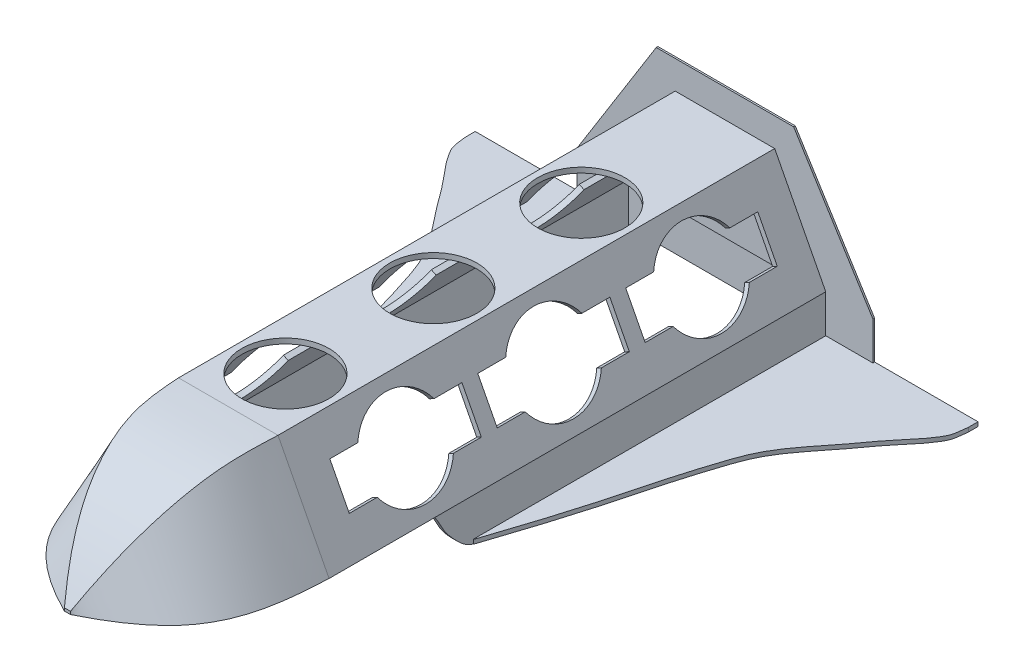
ISO-10303-21;
HEADER;
FILE_DESCRIPTION(('STEP AP214'),'2;1');
FILE_NAME('part.step','',(''),(''),'','','');
FILE_SCHEMA(('AUTOMOTIVE_DESIGN { 1 0 10303 214 1 1 1 1 }'));
ENDSEC;
DATA;
#1=APPLICATION_CONTEXT('core data for automotive mechanical design processes');
#2=APPLICATION_PROTOCOL_DEFINITION('international standard','automotive_design',2000,#1);
#3=PRODUCT_CONTEXT('',#1,'mechanical');
#4=PRODUCT('Part','Part','',(#3));
#5=PRODUCT_RELATED_PRODUCT_CATEGORY('part','',(#4));
#6=PRODUCT_DEFINITION_FORMATION('','',#4);
#7=PRODUCT_DEFINITION_CONTEXT('part definition',#1,'design');
#8=PRODUCT_DEFINITION('design','',#6,#7);
#9=PRODUCT_DEFINITION_SHAPE('','',#8);
#10=(LENGTH_UNIT() NAMED_UNIT(*) SI_UNIT(.MILLI.,.METRE.));
#11=(NAMED_UNIT(*) PLANE_ANGLE_UNIT() SI_UNIT($,.RADIAN.));
#12=(NAMED_UNIT(*) SI_UNIT($,.STERADIAN.) SOLID_ANGLE_UNIT());
#13=UNCERTAINTY_MEASURE_WITH_UNIT(LENGTH_MEASURE(1.E-05),#10,'distance_accuracy_value','');
#14=(GEOMETRIC_REPRESENTATION_CONTEXT(3) GLOBAL_UNCERTAINTY_ASSIGNED_CONTEXT((#13)) GLOBAL_UNIT_ASSIGNED_CONTEXT((#10,
#11,#12)) REPRESENTATION_CONTEXT('',''));
#15=CARTESIAN_POINT('',(0.,0.,0.));
#16=DIRECTION('',(0.,0.,1.));
#17=DIRECTION('',(1.,0.,0.));
#18=AXIS2_PLACEMENT_3D('',#15,#16,#17);
#19=CARTESIAN_POINT('',(-24.2316,10.16,119.78));
#20=DIRECTION('',(0.,1.,0.));
#21=DIRECTION('',(-1.,0.,0.));
#22=AXIS2_PLACEMENT_3D('',#19,#20,#21);
#23=PLANE('',#22);
#24=DIRECTION('',(0.,0.,1.));
#25=VECTOR('',#24,1.);
#26=CARTESIAN_POINT('',(23.2316,10.16,0.4));
#27=LINE('',#26,#25);
#28=CARTESIAN_POINT('',(23.2316,10.16,0.4));
#29=VERTEX_POINT('',#28);
#30=CARTESIAN_POINT('',(23.2316,10.16,94.38));
#31=VERTEX_POINT('',#30);
#32=EDGE_CURVE('E1257',#29,#31,#27,.T.);
#33=ORIENTED_EDGE('',*,*,#32,.T.);
#34=DIRECTION('',(1.,0.,0.));
#35=VECTOR('',#34,1.);
#36=CARTESIAN_POINT('',(24.2316,10.16,94.38));
#37=LINE('',#36,#35);
#38=CARTESIAN_POINT('',(24.2316,10.16,94.38));
#39=VERTEX_POINT('',#38);
#40=EDGE_CURVE('E1260',#31,#39,#37,.T.);
#41=ORIENTED_EDGE('',*,*,#40,.T.);
#42=DIRECTION('',(0.,0.,-1.));
#43=VECTOR('',#42,1.);
#44=CARTESIAN_POINT('',(24.2316,10.16,119.78));
#45=LINE('',#44,#43);
#46=CARTESIAN_POINT('',(24.2316,10.16,119.78));
#47=VERTEX_POINT('',#46);
#48=EDGE_CURVE('E1222',#47,#39,#45,.T.);
#49=ORIENTED_EDGE('',*,*,#48,.F.);
#50=CARTESIAN_POINT('',(0.659021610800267,10.16,158.3626));
#51=CARTESIAN_POINT('',(7.35780529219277,10.16,155.077524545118));
#52=CARTESIAN_POINT('',(18.053509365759,10.16,147.977138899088));
#53=CARTESIAN_POINT('',(23.4833054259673,10.16,133.30382276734));
#54=CARTESIAN_POINT('',(23.9861680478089,10.16,124.215657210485));
#55=CARTESIAN_POINT('',(24.2316,10.16,119.78));
#56=B_SPLINE_CURVE_WITH_KNOTS('',3,(#50,#51,#52,#53,#54,#55),.UNSPECIFIED.,.F.,.F.,(4,1,1,4),
(0.,0.416215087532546,0.715072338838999,1.),.UNSPECIFIED.);
#57=CARTESIAN_POINT('',(0.659021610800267,10.16,158.3626));
#58=VERTEX_POINT('',#57);
#59=EDGE_CURVE('E1189',#47,#58,#56,.F.);
#60=ORIENTED_EDGE('',*,*,#59,.T.);
#61=DIRECTION('',(1.,0.,0.));
#62=VECTOR('',#61,1.);
#63=CARTESIAN_POINT('',(-0.805470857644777,10.16,158.3626));
#64=LINE('',#63,#62);
#65=CARTESIAN_POINT('',(-0.805470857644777,10.16,158.3626));
#66=VERTEX_POINT('',#65);
#67=EDGE_CURVE('E1192',#66,#58,#64,.T.);
#68=ORIENTED_EDGE('',*,*,#67,.F.);
#69=CARTESIAN_POINT('',(-0.805470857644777,10.16,158.3626));
#70=CARTESIAN_POINT('',(-7.4477356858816,10.16,155.064581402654));
#71=CARTESIAN_POINT('',(-18.0240854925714,10.16,147.98137370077));
#72=CARTESIAN_POINT('',(-23.4892804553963,10.1600000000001,133.302962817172));
#73=CARTESIAN_POINT('',(-23.9881277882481,10.16,124.215375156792));
#74=CARTESIAN_POINT('',(-24.2316,10.16,119.78));
#75=B_SPLINE_CURVE_WITH_KNOTS('',3,(#69,#70,#71,#72,#73,#74),.UNSPECIFIED.,.F.,.F.,(4,1,1,4),
(0.,0.416215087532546,0.715072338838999,1.),.UNSPECIFIED.);
#76=CARTESIAN_POINT('',(-24.2316,10.16,119.78));
#77=VERTEX_POINT('',#76);
#78=EDGE_CURVE('E865',#66,#77,#75,.T.);
#79=ORIENTED_EDGE('',*,*,#78,.T.);
#80=DIRECTION('',(0.,0.,-1.));
#81=VECTOR('',#80,1.);
#82=CARTESIAN_POINT('',(-24.2316,10.16,119.78));
#83=LINE('',#82,#81);
#84=CARTESIAN_POINT('',(-24.2316,10.16,94.38));
#85=VERTEX_POINT('',#84);
#86=EDGE_CURVE('E1212',#77,#85,#83,.T.);
#87=ORIENTED_EDGE('',*,*,#86,.T.);
#88=DIRECTION('',(-1.,0.,0.));
#89=VECTOR('',#88,1.);
#90=CARTESIAN_POINT('',(-24.2316,10.16,94.38));
#91=LINE('',#90,#89);
#92=CARTESIAN_POINT('',(-23.2316,10.16,94.38));
#93=VERTEX_POINT('',#92);
#94=EDGE_CURVE('E1180',#93,#85,#91,.T.);
#95=ORIENTED_EDGE('',*,*,#94,.F.);
#96=DIRECTION('',(0.,0.,1.));
#97=VECTOR('',#96,1.);
#98=CARTESIAN_POINT('',(-23.2316,10.16,0.4));
#99=LINE('',#98,#97);
#100=CARTESIAN_POINT('',(-23.2316,10.16,0.4));
#101=VERTEX_POINT('',#100);
#102=EDGE_CURVE('E1183',#101,#93,#99,.T.);
#103=ORIENTED_EDGE('',*,*,#102,.F.);
#104=DIRECTION('',(1.,0.,0.));
#105=VECTOR('',#104,1.);
#106=CARTESIAN_POINT('',(-24.2316,10.16,0.4));
#107=LINE('',#106,#105);
#108=EDGE_CURVE('E1232',#101,#29,#107,.T.);
#109=ORIENTED_EDGE('',*,*,#108,.T.);
#110=EDGE_LOOP('',(#33,#41,#49,#60,#68,#79,#87,#95,#103,#109));
#111=FACE_BOUND('',#110,.T.);
#112=DIRECTION('',(0.,0.,-1.));
#113=VECTOR('',#112,1.);
#114=CARTESIAN_POINT('',(-22.8236181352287,10.16,119.78));
#115=LINE('',#114,#113);
#116=CARTESIAN_POINT('',(-22.8236181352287,10.16,119.749441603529));
#117=VERTEX_POINT('',#116);
#118=CARTESIAN_POINT('',(-22.8236181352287,10.16,1.25));
#119=VERTEX_POINT('',#118);
#120=EDGE_CURVE('E967',#117,#119,#115,.T.);
#121=ORIENTED_EDGE('',*,*,#120,.F.);
#122=CARTESIAN_POINT('',(-0.499798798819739,10.16,157.1126));
#123=CARTESIAN_POINT('',(-0.550138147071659,10.16,157.08572363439));
#124=CARTESIAN_POINT('',(-0.600446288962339,10.16,157.058789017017));
#125=CARTESIAN_POINT('',(-0.701036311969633,10.16,157.004870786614));
#126=CARTESIAN_POINT('',(-0.751318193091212,10.16,156.977887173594));
#127=CARTESIAN_POINT('',(-0.902178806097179,10.16,156.89696403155));
#128=CARTESIAN_POINT('',(-1.00277240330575,10.16,156.843052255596));
#129=CARTESIAN_POINT('',(-1.30455284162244,10.16,156.681302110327));
#130=CARTESIAN_POINT('',(-1.5057335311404,10.16,156.573452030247));
#131=CARTESIAN_POINT('',(-1.90763461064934,10.16,156.356841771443));
#132=CARTESIAN_POINT('',(-2.1083549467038,10.16,156.248081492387));
#133=CARTESIAN_POINT('',(-2.50905433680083,10.16,156.02920766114));
#134=CARTESIAN_POINT('',(-2.70903339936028,10.16,155.919094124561));
#135=CARTESIAN_POINT('',(-3.1082103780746,10.16,155.697183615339));
#136=CARTESIAN_POINT('',(-3.30740776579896,10.16,155.585385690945));
#137=CARTESIAN_POINT('',(-3.70478554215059,10.16,155.359995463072));
#138=CARTESIAN_POINT('',(-3.90296592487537,10.16,155.246403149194));
#139=CARTESIAN_POINT('',(-4.4958301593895,10.16,154.902732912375));
#140=CARTESIAN_POINT('',(-4.88884348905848,10.16,154.669758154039));
#141=CARTESIAN_POINT('',(-5.61626938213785,10.16,154.227714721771));
#142=CARTESIAN_POINT('',(-5.95134400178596,10.16,154.019735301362));
#143=CARTESIAN_POINT('',(-6.61716751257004,10.16,153.596936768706));
#144=CARTESIAN_POINT('',(-6.94791630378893,10.16,153.382117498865));
#145=CARTESIAN_POINT('',(-7.60454857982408,10.16,152.94520730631));
#146=CARTESIAN_POINT('',(-7.93043239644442,10.16,152.723116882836));
#147=CARTESIAN_POINT('',(-8.57722982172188,10.16,152.270896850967));
#148=CARTESIAN_POINT('',(-8.89813619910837,10.16,152.040756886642));
#149=CARTESIAN_POINT('',(-9.53392565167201,10.16,151.572242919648));
#150=CARTESIAN_POINT('',(-9.84880828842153,10.16,151.333868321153));
#151=CARTESIAN_POINT('',(-10.4719234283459,10.16,150.848353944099));
#152=CARTESIAN_POINT('',(-10.7801536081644,10.16,150.601211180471));
#153=CARTESIAN_POINT('',(-11.4237603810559,10.16,150.069076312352));
#154=CARTESIAN_POINT('',(-11.7582271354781,10.16,149.782980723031));
#155=CARTESIAN_POINT('',(-12.4165805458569,10.16,149.198749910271));
#156=CARTESIAN_POINT('',(-12.7404656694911,10.16,148.900612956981));
#157=CARTESIAN_POINT('',(-13.3761338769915,10.16,148.291780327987));
#158=CARTESIAN_POINT('',(-13.6879189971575,10.16,147.981086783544));
#159=CARTESIAN_POINT('',(-14.2978133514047,10.16,147.346585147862));
#160=CARTESIAN_POINT('',(-14.5959237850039,10.16,147.022778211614));
#161=CARTESIAN_POINT('',(-15.1759544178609,10.16,146.362433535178));
#162=CARTESIAN_POINT('',(-15.4579154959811,10.16,146.025931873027));
#163=CARTESIAN_POINT('',(-15.8678841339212,10.16,145.51085674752));
#164=CARTESIAN_POINT('',(-16.0023902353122,10.16,145.337427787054));
#165=CARTESIAN_POINT('',(-16.266801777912,10.16,144.98709159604));
#166=CARTESIAN_POINT('',(-16.3967072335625,10.16,144.810184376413));
#167=CARTESIAN_POINT('',(-16.6518050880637,10.16,144.453022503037));
#168=CARTESIAN_POINT('',(-16.7769977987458,10.16,144.272768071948));
#169=CARTESIAN_POINT('',(-17.0226745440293,10.16,143.90908323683));
#170=CARTESIAN_POINT('',(-17.1431585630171,10.16,143.725652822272));
#171=CARTESIAN_POINT('',(-17.4974827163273,10.16,143.170924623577));
#172=CARTESIAN_POINT('',(-17.7242647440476,10.16,142.795091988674));
#173=CARTESIAN_POINT('',(-18.212196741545,10.16,141.939660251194));
#174=CARTESIAN_POINT('',(-18.4682147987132,10.16,141.457134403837));
#175=CARTESIAN_POINT('',(-18.9519944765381,10.16,140.478051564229));
#176=CARTESIAN_POINT('',(-19.1797505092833,10.16,139.981491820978));
#177=CARTESIAN_POINT('',(-19.608071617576,10.16,138.976774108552));
#178=CARTESIAN_POINT('',(-19.808634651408,10.16,138.468615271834));
#179=CARTESIAN_POINT('',(-20.1844760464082,10.16,137.441382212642));
#180=CARTESIAN_POINT('',(-20.3596787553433,10.16,136.9222804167));
#181=CARTESIAN_POINT('',(-20.6856358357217,10.16,135.876589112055));
#182=CARTESIAN_POINT('',(-20.8363942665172,10.16,135.350000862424));
#183=CARTESIAN_POINT('',(-21.1151461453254,10.16,134.290920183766));
#184=CARTESIAN_POINT('',(-21.2431425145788,10.16,133.758428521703));
#185=CARTESIAN_POINT('',(-21.4210261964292,10.16,132.948444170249));
#186=CARTESIAN_POINT('',(-21.4786718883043,10.16,132.672626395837));
#187=CARTESIAN_POINT('',(-21.588647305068,10.16,132.119931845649));
#188=CARTESIAN_POINT('',(-21.6409770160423,10.16,131.843055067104));
#189=CARTESIAN_POINT('',(-21.7905239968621,10.16,131.01115699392));
#190=CARTESIAN_POINT('',(-21.880315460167,10.16,130.45479259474));
#191=CARTESIAN_POINT('',(-22.0428373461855,10.16,129.340456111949));
#192=CARTESIAN_POINT('',(-22.1155925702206,10.16,128.782487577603));
#193=CARTESIAN_POINT('',(-22.247118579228,10.16,127.664915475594));
#194=CARTESIAN_POINT('',(-22.3058891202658,10.16,127.105311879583));
#195=CARTESIAN_POINT('',(-22.412798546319,10.16,125.980002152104));
#196=CARTESIAN_POINT('',(-22.4608364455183,10.16,125.414286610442));
#197=CARTESIAN_POINT('',(-22.5484988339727,10.16,124.282202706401));
#198=CARTESIAN_POINT('',(-22.5881231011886,10.16,123.715834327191));
#199=CARTESIAN_POINT('',(-22.6617931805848,10.16,122.582839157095));
#200=CARTESIAN_POINT('',(-22.6958399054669,10.16,122.016212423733));
#201=CARTESIAN_POINT('',(-22.7611337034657,10.16,120.882866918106));
#202=CARTESIAN_POINT('',(-22.7923811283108,10.16,120.316148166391));
#203=CARTESIAN_POINT('',(-22.8236181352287,10.16,119.749441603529));
#204=B_SPLINE_CURVE_WITH_KNOTS('',3,(#122,#123,#124,#125,#126,#127,#128,#129,#130,#131,#132,
#133,#134,#135,#136,#137,#138,#139,#140,#141,#142,#143,#144,#145,#146,#147,#148,#149,#150,#151,
#152,#153,#154,#155,#156,#157,#158,#159,#160,#161,#162,#163,#164,#165,#166,#167,#168,#169,#170,
#171,#172,#173,#174,#175,#176,#177,#178,#179,#180,#181,#182,#183,#184,#185,#186,#187,#188,#189,
#190,#191,#192,#193,#194,#195,#196,#197,#198,#199,#200,#201,#202,#203),.UNSPECIFIED.,.F.,.F.,(4,
2,2,2,2,2,2,2,2,2,2,2,2,2,2,2,2,2,2,2,2,2,2,2,2,2,2,2,2,2,2,2,2,2,2,2,2,2,2,2,4),(0.,
0.171194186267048,0.342388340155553,0.684777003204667,1.36957406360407,2.05444763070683,
2.73931330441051,3.42458166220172,4.10985399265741,5.48037673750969,6.66342365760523,
7.84649785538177,9.02949099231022,10.2140665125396,11.3987279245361,12.583796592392,
13.9039292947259,15.2242523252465,16.5443521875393,17.8643360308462,19.1808157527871,
19.8391795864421,20.4975413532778,21.1558594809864,21.8141797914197,23.1304601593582,
24.7681887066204,26.4062405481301,28.0444153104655,29.6873804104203,31.3300723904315,
32.9725533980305,33.8178407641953,34.6631303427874,36.3534782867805,38.0413499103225,
39.7292509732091,41.4324211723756,43.1356363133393,44.83857246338,46.541294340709),.UNSPECIFIED.);
#205=CARTESIAN_POINT('',(-0.499798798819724,10.16,157.1126));
#206=VERTEX_POINT('',#205);
#207=EDGE_CURVE('E988',#206,#117,#204,.T.);
#208=ORIENTED_EDGE('',*,*,#207,.F.);
#209=DIRECTION('',(1.,0.,0.));
#210=VECTOR('',#209,1.);
#211=CARTESIAN_POINT('',(0.,10.16,157.1126));
#212=LINE('',#211,#210);
#213=CARTESIAN_POINT('',(0.356965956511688,10.1600000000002,157.1126));
#214=VERTEX_POINT('',#213);
#215=EDGE_CURVE('E953',#206,#214,#212,.T.);
#216=ORIENTED_EDGE('',*,*,#215,.T.);
#217=CARTESIAN_POINT('',(22.8236181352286,10.16,119.74919932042));
#218=CARTESIAN_POINT('',(22.7912076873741,10.16,120.332627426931));
#219=CARTESIAN_POINT('',(22.7587822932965,10.16,120.916042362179));
#220=CARTESIAN_POINT('',(22.690905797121,10.16,122.082769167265));
#221=CARTESIAN_POINT('',(22.6554543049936,10.16,122.666081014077));
#222=CARTESIAN_POINT('',(22.5400932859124,10.16,124.415285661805));
#223=CARTESIAN_POINT('',(22.4511665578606,10.16,125.580682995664));
#224=CARTESIAN_POINT('',(22.281044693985,10.16,127.32593504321));
#225=CARTESIAN_POINT('',(22.2181694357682,10.16,127.907540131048));
#226=CARTESIAN_POINT('',(22.0769438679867,10.16,129.068868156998));
#227=CARTESIAN_POINT('',(21.9985942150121,10.16,129.648591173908));
#228=CARTESIAN_POINT('',(21.8229969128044,10.16,130.806493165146));
#229=CARTESIAN_POINT('',(21.7257091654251,10.16,131.384666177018));
#230=CARTESIAN_POINT('',(21.5632708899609,10.16,132.248864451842));
#231=CARTESIAN_POINT('',(21.5063670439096,10.16,132.536449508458));
#232=CARTESIAN_POINT('',(21.3866753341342,10.16,133.110404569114));
#233=CARTESIAN_POINT('',(21.3238872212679,10.16,133.39677452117));
#234=CARTESIAN_POINT('',(21.1508265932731,10.16,134.14736162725));
#235=CARTESIAN_POINT('',(21.0354789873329,10.16,134.610428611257));
#236=CARTESIAN_POINT('',(20.7873234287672,10.16,135.531830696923));
#237=CARTESIAN_POINT('',(20.6545146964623,10.16,135.990165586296));
#238=CARTESIAN_POINT('',(20.2279576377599,10.16,137.356899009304));
#239=CARTESIAN_POINT('',(19.9061047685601,10.16,138.256908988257));
#240=CARTESIAN_POINT('',(19.3618565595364,10.16,139.579379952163));
#241=CARTESIAN_POINT('',(19.1705920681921,10.16,140.014859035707));
#242=CARTESIAN_POINT('',(18.7666686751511,10.16,140.875752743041));
#243=CARTESIAN_POINT('',(18.5540137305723,10.16,141.301169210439));
#244=CARTESIAN_POINT('',(18.1068645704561,10.16,142.139959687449));
#245=CARTESIAN_POINT('',(17.8723868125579,10.16,142.553342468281));
#246=CARTESIAN_POINT('',(17.3811471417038,10.16,143.366599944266));
#247=CARTESIAN_POINT('',(17.1243896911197,10.16,143.766477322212));
#248=CARTESIAN_POINT('',(16.7361363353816,10.16,144.334993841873));
#249=CARTESIAN_POINT('',(16.6135022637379,10.16,144.509736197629));
#250=CARTESIAN_POINT('',(16.3637531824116,10.16,144.855971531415));
#251=CARTESIAN_POINT('',(16.2366385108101,10.16,145.027464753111));
#252=CARTESIAN_POINT('',(15.8487870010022,10.16,145.536906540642));
#253=CARTESIAN_POINT('',(15.5814934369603,10.16,145.869889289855));
#254=CARTESIAN_POINT('',(15.0313634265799,10.16,146.52289369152));
#255=CARTESIAN_POINT('',(14.7485216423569,10.16,146.842910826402));
#256=CARTESIAN_POINT('',(14.1690798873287,10.16,147.470265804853));
#257=CARTESIAN_POINT('',(13.8724784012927,10.16,147.777602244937));
#258=CARTESIAN_POINT('',(13.1021401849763,10.16,148.544247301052));
#259=CARTESIAN_POINT('',(12.6199631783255,10.16,148.995093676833));
#260=CARTESIAN_POINT('',(11.631620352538,10.16,149.869682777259));
#261=CARTESIAN_POINT('',(11.1254498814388,10.16,150.293420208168));
#262=CARTESIAN_POINT('',(10.0922879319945,10.16,151.116736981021));
#263=CARTESIAN_POINT('',(9.56525782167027,10.16,151.516267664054));
#264=CARTESIAN_POINT('',(8.49473464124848,10.16,152.292440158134));
#265=CARTESIAN_POINT('',(7.95124329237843,10.1600000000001,152.669084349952));
#266=CARTESIAN_POINT('',(7.11762422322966,10.16,153.223887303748));
#267=CARTESIAN_POINT('',(6.83252967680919,10.16,153.409671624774));
#268=CARTESIAN_POINT('',(6.25901352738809,10.16,153.776042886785));
#269=CARTESIAN_POINT('',(5.97059190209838,10.16,153.956629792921));
#270=CARTESIAN_POINT('',(5.39069113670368,10.16,154.312918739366));
#271=CARTESIAN_POINT('',(5.09921153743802,10.16,154.488620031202));
#272=CARTESIAN_POINT('',(4.51353030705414,10.16,154.83541204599));
#273=CARTESIAN_POINT('',(4.21932871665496,10.16,155.00650283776));
#274=CARTESIAN_POINT('',(3.63020643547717,10.16,155.343447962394));
#275=CARTESIAN_POINT('',(3.33529980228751,10.16,155.509326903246));
#276=CARTESIAN_POINT('',(2.74339396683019,10.16,155.83732439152));
#277=CARTESIAN_POINT('',(2.44639470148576,10.16,155.999442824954));
#278=CARTESIAN_POINT('',(1.99976694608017,10.16,156.24035136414));
#279=CARTESIAN_POINT('',(1.8507381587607,10.16,156.320257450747));
#280=CARTESIAN_POINT('',(1.55238047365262,10.16,156.479508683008));
#281=CARTESIAN_POINT('',(1.40305157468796,10.16,156.558853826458));
#282=CARTESIAN_POINT('',(1.17895303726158,10.16,156.677657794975));
#283=CARTESIAN_POINT('',(1.10423905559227,10.16,156.717221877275));
#284=CARTESIAN_POINT('',(0.954799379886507,10.16,156.796327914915));
#285=CARTESIAN_POINT('',(0.880073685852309,10.16,156.835869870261));
#286=CARTESIAN_POINT('',(0.730634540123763,10.16,156.914975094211));
#287=CARTESIAN_POINT('',(0.655921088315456,10.16,156.954538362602));
#288=CARTESIAN_POINT('',(0.543848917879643,10.16,157.01387955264));
#289=CARTESIAN_POINT('',(0.506491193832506,10.16,157.033659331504));
#290=CARTESIAN_POINT('',(0.431752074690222,10.16,157.073174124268));
#291=CARTESIAN_POINT('',(0.394370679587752,10.1600000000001,157.092909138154));
#292=CARTESIAN_POINT('',(0.35696595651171,10.1600000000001,157.1126));
#293=B_SPLINE_CURVE_WITH_KNOTS('',3,(#217,#218,#219,#220,#221,#222,#223,#224,#225,#226,#227,
#228,#229,#230,#231,#232,#233,#234,#235,#236,#237,#238,#239,#240,#241,#242,#243,#244,#245,#246,
#247,#248,#249,#250,#251,#252,#253,#254,#255,#256,#257,#258,#259,#260,#261,#262,#263,#264,#265,
#266,#267,#268,#269,#270,#271,#272,#273,#274,#275,#276,#277,#278,#279,#280,#281,#282,#283,#284,
#285,#286,#287,#288,#289,#290,#291,#292),.UNSPECIFIED.,.F.,.F.,(4,2,2,2,2,2,2,2,2,2,2,2,2,2,2,2,
2,2,2,2,2,2,2,2,2,2,2,2,2,2,2,2,2,2,2,2,2,4),(0.,1.75295370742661,3.50613369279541,
7.01178667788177,8.76660084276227,10.5213405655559,12.2798368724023,13.1592644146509,
14.0387292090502,15.4700064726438,16.9013476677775,19.7643898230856,21.1908209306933,
22.6169886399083,24.0420893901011,25.4669053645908,26.1072886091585,26.7476236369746,
28.0280322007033,29.3088831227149,30.5898754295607,32.5690118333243,34.5485335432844,
36.5319106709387,38.5150811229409,39.53589429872,40.5567143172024,41.5776898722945,
42.5986501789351,43.6136914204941,44.6287633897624,45.1360601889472,45.6433589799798,
45.8969876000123,46.1506161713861,46.4042422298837,46.5310552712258,46.6578683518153),.UNSPECIFIED.);
#294=CARTESIAN_POINT('',(22.8236181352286,10.16,119.74919932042));
#295=VERTEX_POINT('',#294);
#296=EDGE_CURVE('E982',#295,#214,#293,.T.);
#297=ORIENTED_EDGE('',*,*,#296,.F.);
#298=DIRECTION('',(0.,0.,-1.));
#299=VECTOR('',#298,1.);
#300=CARTESIAN_POINT('',(22.8236181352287,10.16,119.78));
#301=LINE('',#300,#299);
#302=CARTESIAN_POINT('',(22.8236181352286,10.16,1.25));
#303=VERTEX_POINT('',#302);
#304=EDGE_CURVE('E807',#295,#303,#301,.T.);
#305=ORIENTED_EDGE('',*,*,#304,.T.);
#306=DIRECTION('',(-1.,0.,0.));
#307=VECTOR('',#306,1.);
#308=CARTESIAN_POINT('',(0.,10.16,1.25));
#309=LINE('',#308,#307);
#310=EDGE_CURVE('E996',#303,#119,#309,.T.);
#311=ORIENTED_EDGE('',*,*,#310,.T.);
#312=EDGE_LOOP('',(#121,#208,#216,#297,#305,#311));
#313=FACE_BOUND('',#312,.T.);
#314=ADVANCED_FACE('F43',(#111,#313),#23,.F.);
#315=CARTESIAN_POINT('',(-35.56,0.,0.4));
#316=DIRECTION('',(0.,1.,0.));
#317=DIRECTION('',(-1.,0.,0.));
#318=AXIS2_PLACEMENT_3D('',#315,#316,#317);
#319=PLANE('',#318);
#320=DIRECTION('',(1.,0.,0.));
#321=VECTOR('',#320,1.);
#322=CARTESIAN_POINT('',(22.2316,0.,85.09));
#323=LINE('',#322,#321);
#324=CARTESIAN_POINT('',(23.2316,0.,85.09));
#325=VERTEX_POINT('',#324);
#326=CARTESIAN_POINT('',(24.2316,0.,85.09));
#327=VERTEX_POINT('',#326);
#328=EDGE_CURVE('E1524',#325,#327,#323,.T.);
#329=ORIENTED_EDGE('',*,*,#328,.F.);
#330=DIRECTION('',(0.,0.,1.));
#331=VECTOR('',#330,1.);
#332=CARTESIAN_POINT('',(23.2316,0.,0.4));
#333=LINE('',#332,#331);
#334=CARTESIAN_POINT('',(23.2316,0.,0.4));
#335=VERTEX_POINT('',#334);
#336=EDGE_CURVE('E1259',#335,#325,#333,.T.);
#337=ORIENTED_EDGE('',*,*,#336,.F.);
#338=DIRECTION('',(1.,0.,0.));
#339=VECTOR('',#338,1.);
#340=CARTESIAN_POINT('',(-35.56,0.,0.4));
#341=LINE('',#340,#339);
#342=CARTESIAN_POINT('',(-23.2316,0.,0.4));
#343=VERTEX_POINT('',#342);
#344=EDGE_CURVE('E1440',#343,#335,#341,.T.);
#345=ORIENTED_EDGE('',*,*,#344,.F.);
#346=DIRECTION('',(0.,0.,1.));
#347=VECTOR('',#346,1.);
#348=CARTESIAN_POINT('',(-23.2316,0.,0.4));
#349=LINE('',#348,#347);
#350=CARTESIAN_POINT('',(-23.2316,0.,85.09));
#351=VERTEX_POINT('',#350);
#352=EDGE_CURVE('E1176',#343,#351,#349,.T.);
#353=ORIENTED_EDGE('',*,*,#352,.T.);
#354=DIRECTION('',(-1.,0.,0.));
#355=VECTOR('',#354,1.);
#356=CARTESIAN_POINT('',(-22.2316,0.,85.09));
#357=LINE('',#356,#355);
#358=CARTESIAN_POINT('',(-24.2316,0.,85.09));
#359=VERTEX_POINT('',#358);
#360=EDGE_CURVE('E1588',#351,#359,#357,.T.);
#361=ORIENTED_EDGE('',*,*,#360,.T.);
#362=DIRECTION('',(1.,0.,0.));
#363=VECTOR('',#362,1.);
#364=CARTESIAN_POINT('',(-60.4266,0.,85.09));
#365=LINE('',#364,#363);
#366=CARTESIAN_POINT('',(-24.3122055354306,0.,85.09));
#367=VERTEX_POINT('',#366);
#368=EDGE_CURVE('E1166',#367,#359,#365,.T.);
#369=ORIENTED_EDGE('',*,*,#368,.F.);
#370=CARTESIAN_POINT('',(-24.3122055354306,0.,85.09));
#371=CARTESIAN_POINT('',(-31.2614313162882,0.,64.3730947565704));
#372=CARTESIAN_POINT('',(-33.2308163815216,0.,54.4514867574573));
#373=CARTESIAN_POINT('',(-37.4606276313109,0.,40.6315669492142));
#374=CARTESIAN_POINT('',(-40.0882449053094,0.,32.8170290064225));
#375=CARTESIAN_POINT('',(-44.0306290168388,0.,26.8822161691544));
#376=CARTESIAN_POINT('',(-48.8684459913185,0.,21.1150536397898));
#377=CARTESIAN_POINT('',(-52.5106696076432,0.,15.8113435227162));
#378=CARTESIAN_POINT('',(-55.3167849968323,0.,12.5741308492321));
#379=CARTESIAN_POINT('',(-57.4936280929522,0.,9.92557553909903));
#380=CARTESIAN_POINT('',(-57.6580141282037,0.,9.65740720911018));
#381=CARTESIAN_POINT('',(-60.122609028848,0.,5.98351100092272));
#382=CARTESIAN_POINT('',(-60.235834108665,0.,3.8501450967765));
#383=CARTESIAN_POINT('',(-60.463850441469,0.,2.05287289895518));
#384=CARTESIAN_POINT('',(-60.4494120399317,0.,2.06599250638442));
#385=CARTESIAN_POINT('',(-60.4871068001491,0.,0.00638939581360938));
#386=B_SPLINE_CURVE_WITH_KNOTS('',3,(#370,#371,#372,#373,#374,#375,#376,#377,#378,#379,#380,
#381,#382,#383,#384,#385),.UNSPECIFIED.,.F.,.F.,(4,1,1,1,1,1,1,1,1,1,1,1,1,4),(0.,
0.324886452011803,0.453860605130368,0.525529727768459,0.632164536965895,0.715601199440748,
0.807140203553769,0.868437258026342,0.880774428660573,0.924985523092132,0.934630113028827,
0.967575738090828,0.97452454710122,1.),.UNSPECIFIED.);
#387=CARTESIAN_POINT('',(-60.4266,0.,2.30791928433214));
#388=VERTEX_POINT('',#387);
#389=EDGE_CURVE('E1139',#367,#388,#386,.T.);
#390=ORIENTED_EDGE('',*,*,#389,.T.);
#391=DIRECTION('',(0.,0.,1.));
#392=VECTOR('',#391,1.);
#393=CARTESIAN_POINT('',(-60.4266,0.,0.));
#394=LINE('',#393,#392);
#395=CARTESIAN_POINT('',(-60.4266,0.,0.));
#396=VERTEX_POINT('',#395);
#397=EDGE_CURVE('E1151',#396,#388,#394,.T.);
#398=ORIENTED_EDGE('',*,*,#397,.F.);
#399=DIRECTION('',(1.,0.,0.));
#400=VECTOR('',#399,1.);
#401=CARTESIAN_POINT('',(-35.56,0.,0.));
#402=LINE('',#401,#400);
#403=CARTESIAN_POINT('',(60.4266,0.,0.));
#404=VERTEX_POINT('',#403);
#405=EDGE_CURVE('E1441',#396,#404,#402,.T.);
#406=ORIENTED_EDGE('',*,*,#405,.T.);
#407=DIRECTION('',(0.,0.,1.));
#408=VECTOR('',#407,1.);
#409=CARTESIAN_POINT('',(60.4266,0.,0.));
#410=LINE('',#409,#408);
#411=CARTESIAN_POINT('',(60.4266,0.,2.30791928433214));
#412=VERTEX_POINT('',#411);
#413=EDGE_CURVE('E1073',#404,#412,#410,.T.);
#414=ORIENTED_EDGE('',*,*,#413,.T.);
#415=CARTESIAN_POINT('',(24.3122055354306,0.,85.09));
#416=CARTESIAN_POINT('',(31.2614313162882,0.,64.3730947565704));
#417=CARTESIAN_POINT('',(33.2308163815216,0.,54.4514867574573));
#418=CARTESIAN_POINT('',(37.4606276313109,0.,40.6315669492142));
#419=CARTESIAN_POINT('',(40.0882449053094,0.,32.8170290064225));
#420=CARTESIAN_POINT('',(44.0306290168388,0.,26.8822161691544));
#421=CARTESIAN_POINT('',(48.8684459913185,0.,21.1150536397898));
#422=CARTESIAN_POINT('',(52.5106696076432,0.,15.8113435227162));
#423=CARTESIAN_POINT('',(55.3167849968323,0.,12.5741308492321));
#424=CARTESIAN_POINT('',(57.4936280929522,0.,9.92557553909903));
#425=CARTESIAN_POINT('',(57.6580141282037,0.,9.65740720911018));
#426=CARTESIAN_POINT('',(60.122609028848,0.,5.98351100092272));
#427=CARTESIAN_POINT('',(60.235834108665,0.,3.8501450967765));
#428=CARTESIAN_POINT('',(60.463850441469,0.,2.05287289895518));
#429=CARTESIAN_POINT('',(60.4494120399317,0.,2.06599250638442));
#430=CARTESIAN_POINT('',(60.4871068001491,0.,0.00638939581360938));
#431=B_SPLINE_CURVE_WITH_KNOTS('',3,(#415,#416,#417,#418,#419,#420,#421,#422,#423,#424,#425,
#426,#427,#428,#429,#430),.UNSPECIFIED.,.F.,.F.,(4,1,1,1,1,1,1,1,1,1,1,1,1,4),(0.,
0.324886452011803,0.453860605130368,0.525529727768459,0.632164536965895,0.715601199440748,
0.807140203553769,0.868437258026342,0.880774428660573,0.924985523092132,0.934630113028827,
0.967575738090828,0.97452454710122,1.),.UNSPECIFIED.);
#432=CARTESIAN_POINT('',(24.3122055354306,0.,85.09));
#433=VERTEX_POINT('',#432);
#434=EDGE_CURVE('E1059',#433,#412,#431,.T.);
#435=ORIENTED_EDGE('',*,*,#434,.F.);
#436=DIRECTION('',(-1.,0.,0.));
#437=VECTOR('',#436,1.);
#438=CARTESIAN_POINT('',(60.4266,0.,85.09));
#439=LINE('',#438,#437);
#440=EDGE_CURVE('E1076',#433,#327,#439,.T.);
#441=ORIENTED_EDGE('',*,*,#440,.T.);
#442=EDGE_LOOP('',(#329,#337,#345,#353,#361,#369,#390,#398,#406,#414,#435,#441));
#443=FACE_BOUND('',#442,.T.);
#444=ADVANCED_FACE('F1029',(#443),#319,.F.);
#445=CARTESIAN_POINT('',(24.2316,0.,0.399999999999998));
#446=DIRECTION('',(1.,0.,0.));
#447=DIRECTION('',(0.,1.,0.));
#448=AXIS2_PLACEMENT_3D('',#445,#446,#447);
#449=PLANE('',#448);
#450=DIRECTION('',(0.,0.,-1.));
#451=VECTOR('',#450,1.);
#452=CARTESIAN_POINT('',(24.2316,10.16,0.399999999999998));
#453=LINE('',#452,#451);
#454=CARTESIAN_POINT('',(24.2316,10.16,0.4));
#455=VERTEX_POINT('',#454);
#456=EDGE_CURVE('E1265',#39,#455,#453,.T.);
#457=ORIENTED_EDGE('',*,*,#456,.F.);
#458=CARTESIAN_POINT('',(24.2316,10.16,94.38));
#459=CARTESIAN_POINT('',(24.2316,9.13057293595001,93.6043016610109));
#460=CARTESIAN_POINT('',(24.2316,6.41638715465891,92.4710278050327));
#461=CARTESIAN_POINT('',(24.2316,2.81161331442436,89.4224254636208));
#462=CARTESIAN_POINT('',(24.2316,0.488467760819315,86.8587498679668));
#463=CARTESIAN_POINT('',(24.2316,0.,85.09));
#464=B_SPLINE_CURVE_WITH_KNOTS('',3,(#458,#459,#460,#461,#462,#463),.UNSPECIFIED.,.F.,.F.,(4,1,
1,4),(0.,0.273953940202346,0.620307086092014,1.),.UNSPECIFIED.);
#465=EDGE_CURVE('E1005',#39,#327,#464,.T.);
#466=ORIENTED_EDGE('',*,*,#465,.T.);
#467=DIRECTION('',(0.,1.,0.));
#468=VECTOR('',#467,1.);
#469=CARTESIAN_POINT('',(24.2316,0.,85.09));
#470=LINE('',#469,#468);
#471=CARTESIAN_POINT('',(24.2316,1.00000000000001,85.09));
#472=VERTEX_POINT('',#471);
#473=EDGE_CURVE('E1071',#327,#472,#470,.T.);
#474=ORIENTED_EDGE('',*,*,#473,.T.);
#475=DIRECTION('',(0.,0.,-1.));
#476=VECTOR('',#475,1.);
#477=CARTESIAN_POINT('',(24.2316,1.00000000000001,0.));
#478=LINE('',#477,#476);
#479=CARTESIAN_POINT('',(24.2316,1.00000000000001,0.4));
#480=VERTEX_POINT('',#479);
#481=EDGE_CURVE('E1063',#472,#480,#478,.T.);
#482=ORIENTED_EDGE('',*,*,#481,.T.);
#483=DIRECTION('',(0.,1.,0.));
#484=VECTOR('',#483,1.);
#485=CARTESIAN_POINT('',(24.2316,0.,0.399999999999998));
#486=LINE('',#485,#484);
#487=EDGE_CURVE('E1529',#480,#455,#486,.T.);
#488=ORIENTED_EDGE('',*,*,#487,.T.);
#489=EDGE_LOOP('',(#457,#466,#474,#482,#488));
#490=FACE_BOUND('',#489,.T.);
#491=ADVANCED_FACE('F1025',(#490),#449,.T.);
#492=CARTESIAN_POINT('',(23.2316,0.,0.4));
#493=DIRECTION('',(-1.,0.,0.));
#494=DIRECTION('',(0.,-1.,0.));
#495=AXIS2_PLACEMENT_3D('',#492,#493,#494);
#496=PLANE('',#495);
#497=ORIENTED_EDGE('',*,*,#336,.T.);
#498=CARTESIAN_POINT('',(23.2316,10.16,94.38));
#499=CARTESIAN_POINT('',(23.2316,9.13057293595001,93.6043016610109));
#500=CARTESIAN_POINT('',(23.2316,6.41638715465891,92.4710278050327));
#501=CARTESIAN_POINT('',(23.2316,2.81161331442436,89.4224254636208));
#502=CARTESIAN_POINT('',(23.2316,0.488467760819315,86.8587498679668));
#503=CARTESIAN_POINT('',(23.2316,0.,85.09));
#504=B_SPLINE_CURVE_WITH_KNOTS('',3,(#498,#499,#500,#501,#502,#503),.UNSPECIFIED.,.F.,.F.,(4,1,
1,4),(0.,0.273953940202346,0.620307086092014,1.),.UNSPECIFIED.);
#505=EDGE_CURVE('E1246',#325,#31,#504,.F.);
#506=ORIENTED_EDGE('',*,*,#505,.T.);
#507=ORIENTED_EDGE('',*,*,#32,.F.);
#508=DIRECTION('',(0.,1.,0.));
#509=VECTOR('',#508,1.);
#510=CARTESIAN_POINT('',(23.2316,0.,0.4));
#511=LINE('',#510,#509);
#512=EDGE_CURVE('E1043',#335,#29,#511,.T.);
#513=ORIENTED_EDGE('',*,*,#512,.F.);
#514=EDGE_LOOP('',(#497,#506,#507,#513));
#515=FACE_BOUND('',#514,.T.);
#516=ADVANCED_FACE('F1021',(#515),#496,.T.);
#517=CARTESIAN_POINT('',(0.,0.,0.4));
#518=DIRECTION('',(0.,0.,1.));
#519=DIRECTION('',(1.,0.,0.));
#520=AXIS2_PLACEMENT_3D('',#517,#518,#519);
#521=PLANE('',#520);
#522=ORIENTED_EDGE('',*,*,#487,.F.);
#523=DIRECTION('',(-1.,0.,0.));
#524=VECTOR('',#523,1.);
#525=CARTESIAN_POINT('',(0.,1.,0.4));
#526=LINE('',#525,#524);
#527=CARTESIAN_POINT('',(35.56,1.00000000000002,0.4));
#528=VERTEX_POINT('',#527);
#529=EDGE_CURVE('E1090',#528,#480,#526,.T.);
#530=ORIENTED_EDGE('',*,*,#529,.F.);
#531=DIRECTION('',(0.,1.,0.));
#532=VECTOR('',#531,1.);
#533=CARTESIAN_POINT('',(35.56,0.,0.4));
#534=LINE('',#533,#532);
#535=CARTESIAN_POINT('',(35.56,10.16,0.4));
#536=VERTEX_POINT('',#535);
#537=EDGE_CURVE('E1443',#528,#536,#534,.T.);
#538=ORIENTED_EDGE('',*,*,#537,.T.);
#539=DIRECTION('',(-0.52999894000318,0.847998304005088,0.));
#540=VECTOR('',#539,1.);
#541=CARTESIAN_POINT('',(35.56,10.16,0.4));
#542=LINE('',#541,#540);
#543=CARTESIAN_POINT('',(16.51,40.64,0.4));
#544=VERTEX_POINT('',#543);
#545=EDGE_CURVE('E1461',#536,#544,#542,.T.);
#546=ORIENTED_EDGE('',*,*,#545,.T.);
#547=DIRECTION('',(-1.,0.,0.));
#548=VECTOR('',#547,1.);
#549=CARTESIAN_POINT('',(16.51,40.64,0.4));
#550=LINE('',#549,#548);
#551=CARTESIAN_POINT('',(-16.51,40.64,0.4));
#552=VERTEX_POINT('',#551);
#553=EDGE_CURVE('E1459',#544,#552,#550,.T.);
#554=ORIENTED_EDGE('',*,*,#553,.T.);
#555=DIRECTION('',(-0.52999894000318,-0.847998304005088,0.));
#556=VECTOR('',#555,1.);
#557=CARTESIAN_POINT('',(-35.56,10.16,0.4));
#558=LINE('',#557,#556);
#559=CARTESIAN_POINT('',(-35.56,10.16,0.4));
#560=VERTEX_POINT('',#559);
#561=EDGE_CURVE('E1457',#552,#560,#558,.T.);
#562=ORIENTED_EDGE('',*,*,#561,.T.);
#563=DIRECTION('',(0.,-1.,0.));
#564=VECTOR('',#563,1.);
#565=CARTESIAN_POINT('',(-35.56,0.,0.4));
#566=LINE('',#565,#564);
#567=CARTESIAN_POINT('',(-35.56,1.00000000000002,0.4));
#568=VERTEX_POINT('',#567);
#569=EDGE_CURVE('E1454',#560,#568,#566,.T.);
#570=ORIENTED_EDGE('',*,*,#569,.T.);
#571=DIRECTION('',(1.,0.,0.));
#572=VECTOR('',#571,1.);
#573=CARTESIAN_POINT('',(0.,1.,0.4));
#574=LINE('',#573,#572);
#575=CARTESIAN_POINT('',(-24.2316,1.00000000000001,0.399999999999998));
#576=VERTEX_POINT('',#575);
#577=EDGE_CURVE('E1172',#568,#576,#574,.T.);
#578=ORIENTED_EDGE('',*,*,#577,.T.);
#579=DIRECTION('',(0.,1.,0.));
#580=VECTOR('',#579,1.);
#581=CARTESIAN_POINT('',(-24.2316,0.,0.399999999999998));
#582=LINE('',#581,#580);
#583=CARTESIAN_POINT('',(-24.2316,10.16,0.4));
#584=VERTEX_POINT('',#583);
#585=EDGE_CURVE('E1186',#576,#584,#582,.T.);
#586=ORIENTED_EDGE('',*,*,#585,.T.);
#587=DIRECTION('',(-0.460238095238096,-0.887795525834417,0.));
#588=VECTOR('',#587,1.);
#589=CARTESIAN_POINT('',(-24.2316,10.16,0.4));
#590=LINE('',#589,#588);
#591=CARTESIAN_POINT('',(-11.95705,33.8375066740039,0.4));
#592=VERTEX_POINT('',#591);
#593=EDGE_CURVE('E1466',#592,#584,#590,.T.);
#594=ORIENTED_EDGE('',*,*,#593,.F.);
#595=DIRECTION('',(-1.,0.,0.));
#596=VECTOR('',#595,1.);
#597=CARTESIAN_POINT('',(11.95705,33.8375066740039,0.4));
#598=LINE('',#597,#596);
#599=CARTESIAN_POINT('',(11.95705,33.8375066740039,0.4));
#600=VERTEX_POINT('',#599);
#601=EDGE_CURVE('E1469',#600,#592,#598,.T.);
#602=ORIENTED_EDGE('',*,*,#601,.F.);
#603=DIRECTION('',(-0.460238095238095,0.887795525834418,0.));
#604=VECTOR('',#603,1.);
#605=CARTESIAN_POINT('',(24.2316,10.16,0.4));
#606=LINE('',#605,#604);
#607=EDGE_CURVE('E1471',#455,#600,#606,.T.);
#608=ORIENTED_EDGE('',*,*,#607,.F.);
#609=EDGE_LOOP('',(#522,#530,#538,#546,#554,#562,#570,#578,#586,#594,#602,#608));
#610=FACE_BOUND('',#609,.T.);
#611=ADVANCED_FACE('F1024',(#610),#521,.T.);
#612=CARTESIAN_POINT('',(60.4266,1.00000000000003,0.));
#613=DIRECTION('',(0.,1.,0.));
#614=DIRECTION('',(-1.,0.,0.));
#615=AXIS2_PLACEMENT_3D('',#612,#613,#614);
#616=PLANE('',#615);
#617=DIRECTION('',(-1.,0.,0.));
#618=VECTOR('',#617,1.);
#619=CARTESIAN_POINT('',(60.4266,1.00000000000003,85.09));
#620=LINE('',#619,#618);
#621=CARTESIAN_POINT('',(24.3122055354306,1.00000000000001,85.09));
#622=VERTEX_POINT('',#621);
#623=EDGE_CURVE('E1083',#622,#472,#620,.T.);
#624=ORIENTED_EDGE('',*,*,#623,.F.);
#625=CARTESIAN_POINT('',(24.3122055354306,1.00000000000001,85.09));
#626=CARTESIAN_POINT('',(31.2614313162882,1.00000000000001,64.3730947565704));
#627=CARTESIAN_POINT('',(33.2308163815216,1.00000000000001,54.4514867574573));
#628=CARTESIAN_POINT('',(37.4606276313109,1.00000000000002,40.6315669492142));
#629=CARTESIAN_POINT('',(40.0882449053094,1.00000000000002,32.8170290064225));
#630=CARTESIAN_POINT('',(44.0306290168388,1.00000000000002,26.8822161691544));
#631=CARTESIAN_POINT('',(48.8684459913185,1.00000000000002,21.1150536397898));
#632=CARTESIAN_POINT('',(52.5106696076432,1.00000000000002,15.8113435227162));
#633=CARTESIAN_POINT('',(55.3167849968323,1.00000000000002,12.5741308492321));
#634=CARTESIAN_POINT('',(57.4936280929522,1.00000000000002,9.92557553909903));
#635=CARTESIAN_POINT('',(57.6580141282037,1.00000000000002,9.65740720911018));
#636=CARTESIAN_POINT('',(60.122609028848,1.00000000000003,5.98351100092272));
#637=CARTESIAN_POINT('',(60.235834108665,1.00000000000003,3.8501450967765));
#638=CARTESIAN_POINT('',(60.463850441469,1.00000000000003,2.05287289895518));
#639=CARTESIAN_POINT('',(60.4494120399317,1.00000000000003,2.06599250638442));
#640=CARTESIAN_POINT('',(60.4871068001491,1.00000000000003,0.00638939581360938));
#641=B_SPLINE_CURVE_WITH_KNOTS('',3,(#625,#626,#627,#628,#629,#630,#631,#632,#633,#634,#635,
#636,#637,#638,#639,#640),.UNSPECIFIED.,.F.,.F.,(4,1,1,1,1,1,1,1,1,1,1,1,1,4),(0.,
0.324886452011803,0.453860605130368,0.525529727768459,0.632164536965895,0.715601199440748,
0.807140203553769,0.868437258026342,0.880774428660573,0.924985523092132,0.934630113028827,
0.967575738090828,0.97452454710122,1.),.UNSPECIFIED.);
#642=CARTESIAN_POINT('',(60.4266,1.00000000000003,2.30791928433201));
#643=VERTEX_POINT('',#642);
#644=EDGE_CURVE('E1045',#622,#643,#641,.T.);
#645=ORIENTED_EDGE('',*,*,#644,.T.);
#646=DIRECTION('',(0.,0.,-1.));
#647=VECTOR('',#646,1.);
#648=CARTESIAN_POINT('',(60.4266,1.00000000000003,0.));
#649=LINE('',#648,#647);
#650=CARTESIAN_POINT('',(60.4266,1.00000000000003,0.));
#651=VERTEX_POINT('',#650);
#652=EDGE_CURVE('E1070',#643,#651,#649,.T.);
#653=ORIENTED_EDGE('',*,*,#652,.T.);
#654=DIRECTION('',(-1.,0.,0.));
#655=VECTOR('',#654,1.);
#656=CARTESIAN_POINT('',(60.4266,1.00000000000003,0.));
#657=LINE('',#656,#655);
#658=CARTESIAN_POINT('',(35.56,1.00000000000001,0.));
#659=VERTEX_POINT('',#658);
#660=EDGE_CURVE('E1085',#651,#659,#657,.T.);
#661=ORIENTED_EDGE('',*,*,#660,.T.);
#662=DIRECTION('',(0.,0.,-1.));
#663=VECTOR('',#662,1.);
#664=CARTESIAN_POINT('',(35.56,1.00000000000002,0.4));
#665=LINE('',#664,#663);
#666=EDGE_CURVE('E1088',#528,#659,#665,.T.);
#667=ORIENTED_EDGE('',*,*,#666,.F.);
#668=ORIENTED_EDGE('',*,*,#529,.T.);
#669=ORIENTED_EDGE('',*,*,#481,.F.);
#670=EDGE_LOOP('',(#624,#645,#653,#661,#667,#668,#669));
#671=FACE_BOUND('',#670,.T.);
#672=ADVANCED_FACE('F1110',(#671),#616,.T.);
#673=CARTESIAN_POINT('',(60.4266,0.,85.09));
#674=DIRECTION('',(0.,0.,1.));
#675=DIRECTION('',(1.,0.,0.));
#676=AXIS2_PLACEMENT_3D('',#673,#674,#675);
#677=PLANE('',#676);
#678=ORIENTED_EDGE('',*,*,#440,.F.);
#679=DIRECTION('',(0.,1.,0.));
#680=VECTOR('',#679,1.);
#681=CARTESIAN_POINT('',(24.3122055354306,-35.195,85.09));
#682=LINE('',#681,#680);
#683=EDGE_CURVE('E1053',#433,#622,#682,.T.);
#684=ORIENTED_EDGE('',*,*,#683,.T.);
#685=ORIENTED_EDGE('',*,*,#623,.T.);
#686=ORIENTED_EDGE('',*,*,#473,.F.);
#687=EDGE_LOOP('',(#678,#684,#685,#686));
#688=FACE_BOUND('',#687,.T.);
#689=ADVANCED_FACE('F1541',(#688),#677,.T.);
#690=CARTESIAN_POINT('',(60.4266,0.,0.));
#691=DIRECTION('',(-1.,0.,0.));
#692=DIRECTION('',(0.,0.,-1.));
#693=AXIS2_PLACEMENT_3D('',#690,#691,#692);
#694=PLANE('',#693);
#695=DIRECTION('',(0.,1.,0.));
#696=VECTOR('',#695,1.);
#697=CARTESIAN_POINT('',(60.4266,-35.195,2.30791928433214));
#698=LINE('',#697,#696);
#699=EDGE_CURVE('E1236',#412,#643,#698,.T.);
#700=ORIENTED_EDGE('',*,*,#699,.F.);
#701=ORIENTED_EDGE('',*,*,#413,.F.);
#702=DIRECTION('',(0.,-1.,0.));
#703=VECTOR('',#702,1.);
#704=CARTESIAN_POINT('',(60.4266,0.,0.));
#705=LINE('',#704,#703);
#706=EDGE_CURVE('E1064',#651,#404,#705,.T.);
#707=ORIENTED_EDGE('',*,*,#706,.F.);
#708=ORIENTED_EDGE('',*,*,#652,.F.);
#709=EDGE_LOOP('',(#700,#701,#707,#708));
#710=FACE_BOUND('',#709,.T.);
#711=ADVANCED_FACE('F1036',(#710),#694,.F.);
#712=ORIENTED_EDGE('',*,*,#512,.T.);
#713=ORIENTED_EDGE('',*,*,#108,.F.);
#714=DIRECTION('',(0.,1.,0.));
#715=VECTOR('',#714,1.);
#716=CARTESIAN_POINT('',(-23.2316,0.,0.4));
#717=LINE('',#716,#715);
#718=EDGE_CURVE('E1179',#343,#101,#717,.T.);
#719=ORIENTED_EDGE('',*,*,#718,.F.);
#720=ORIENTED_EDGE('',*,*,#344,.T.);
#721=EDGE_LOOP('',(#712,#713,#719,#720));
#722=FACE_BOUND('',#721,.T.);
#723=ADVANCED_FACE('F1534',(#722),#521,.T.);
#724=CARTESIAN_POINT('',(-35.56,0.,0.4));
#725=DIRECTION('',(1.,0.,0.));
#726=DIRECTION('',(0.,0.,-1.));
#727=AXIS2_PLACEMENT_3D('',#724,#725,#726);
#728=PLANE('',#727);
#729=DIRECTION('',(0.,0.,-1.));
#730=VECTOR('',#729,1.);
#731=CARTESIAN_POINT('',(-35.56,1.00000000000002,0.4));
#732=LINE('',#731,#730);
#733=CARTESIAN_POINT('',(-35.56,1.00000000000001,0.));
#734=VERTEX_POINT('',#733);
#735=EDGE_CURVE('E1169',#568,#734,#732,.T.);
#736=ORIENTED_EDGE('',*,*,#735,.F.);
#737=ORIENTED_EDGE('',*,*,#569,.F.);
#738=DIRECTION('',(0.,0.,-1.));
#739=VECTOR('',#738,1.);
#740=CARTESIAN_POINT('',(-35.56,10.16,0.4));
#741=LINE('',#740,#739);
#742=CARTESIAN_POINT('',(-35.56,10.16,0.));
#743=VERTEX_POINT('',#742);
#744=EDGE_CURVE('E1437',#560,#743,#741,.T.);
#745=ORIENTED_EDGE('',*,*,#744,.T.);
#746=DIRECTION('',(0.,-1.,0.));
#747=VECTOR('',#746,1.);
#748=CARTESIAN_POINT('',(-35.56,0.,0.));
#749=LINE('',#748,#747);
#750=EDGE_CURVE('E1444',#743,#734,#749,.T.);
#751=ORIENTED_EDGE('',*,*,#750,.T.);
#752=EDGE_LOOP('',(#736,#737,#745,#751));
#753=FACE_BOUND('',#752,.T.);
#754=ADVANCED_FACE('F1569',(#753),#728,.F.);
#755=CARTESIAN_POINT('',(-24.2316,0.,0.399999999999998));
#756=DIRECTION('',(1.,0.,0.));
#757=DIRECTION('',(0.,1.,0.));
#758=AXIS2_PLACEMENT_3D('',#755,#756,#757);
#759=PLANE('',#758);
#760=DIRECTION('',(0.,1.,0.));
#761=VECTOR('',#760,1.);
#762=CARTESIAN_POINT('',(-24.2316,0.,85.09));
#763=LINE('',#762,#761);
#764=CARTESIAN_POINT('',(-24.2316,1.00000000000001,85.09));
#765=VERTEX_POINT('',#764);
#766=EDGE_CURVE('E1144',#359,#765,#763,.T.);
#767=ORIENTED_EDGE('',*,*,#766,.F.);
#768=CARTESIAN_POINT('',(-24.2316,10.16,94.38));
#769=CARTESIAN_POINT('',(-24.2316,9.13057293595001,93.6043016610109));
#770=CARTESIAN_POINT('',(-24.2316,6.41638715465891,92.4710278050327));
#771=CARTESIAN_POINT('',(-24.2316,2.81161331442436,89.4224254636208));
#772=CARTESIAN_POINT('',(-24.2316,0.488467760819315,86.8587498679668));
#773=CARTESIAN_POINT('',(-24.2316,0.,85.09));
#774=B_SPLINE_CURVE_WITH_KNOTS('',3,(#768,#769,#770,#771,#772,#773),.UNSPECIFIED.,.F.,.F.,(4,1,
1,4),(0.,0.273953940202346,0.620307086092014,1.),.UNSPECIFIED.);
#775=EDGE_CURVE('E1093',#85,#359,#774,.T.);
#776=ORIENTED_EDGE('',*,*,#775,.F.);
#777=DIRECTION('',(0.,0.,-1.));
#778=VECTOR('',#777,1.);
#779=CARTESIAN_POINT('',(-24.2316,10.16,0.399999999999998));
#780=LINE('',#779,#778);
#781=EDGE_CURVE('E1175',#85,#584,#780,.T.);
#782=ORIENTED_EDGE('',*,*,#781,.T.);
#783=ORIENTED_EDGE('',*,*,#585,.F.);
#784=DIRECTION('',(0.,0.,-1.));
#785=VECTOR('',#784,1.);
#786=CARTESIAN_POINT('',(-24.2316,1.00000000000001,0.));
#787=LINE('',#786,#785);
#788=EDGE_CURVE('E1152',#765,#576,#787,.T.);
#789=ORIENTED_EDGE('',*,*,#788,.F.);
#790=EDGE_LOOP('',(#767,#776,#782,#783,#789));
#791=FACE_BOUND('',#790,.T.);
#792=ADVANCED_FACE('F1580',(#791),#759,.F.);
#793=CARTESIAN_POINT('',(35.56,0.,0.4));
#794=DIRECTION('',(-1.,0.,0.));
#795=DIRECTION('',(0.,0.,1.));
#796=AXIS2_PLACEMENT_3D('',#793,#794,#795);
#797=PLANE('',#796);
#798=ORIENTED_EDGE('',*,*,#537,.F.);
#799=ORIENTED_EDGE('',*,*,#666,.T.);
#800=DIRECTION('',(0.,1.,0.));
#801=VECTOR('',#800,1.);
#802=CARTESIAN_POINT('',(35.56,0.,0.));
#803=LINE('',#802,#801);
#804=CARTESIAN_POINT('',(35.56,10.16,0.));
#805=VERTEX_POINT('',#804);
#806=EDGE_CURVE('E1425',#659,#805,#803,.T.);
#807=ORIENTED_EDGE('',*,*,#806,.T.);
#808=DIRECTION('',(0.,0.,-1.));
#809=VECTOR('',#808,1.);
#810=CARTESIAN_POINT('',(35.56,10.16,0.4));
#811=LINE('',#810,#809);
#812=EDGE_CURVE('E1237',#536,#805,#811,.T.);
#813=ORIENTED_EDGE('',*,*,#812,.F.);
#814=EDGE_LOOP('',(#798,#799,#807,#813));
#815=FACE_BOUND('',#814,.T.);
#816=ADVANCED_FACE('F45',(#815),#797,.F.);
#817=CARTESIAN_POINT('',(35.56,10.16,0.4));
#818=DIRECTION('',(-0.847998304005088,-0.52999894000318,0.));
#819=DIRECTION('',(0.52999894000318,-0.847998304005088,0.));
#820=AXIS2_PLACEMENT_3D('',#817,#818,#819);
#821=PLANE('',#820);
#822=DIRECTION('',(-0.52999894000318,0.847998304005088,0.));
#823=VECTOR('',#822,1.);
#824=CARTESIAN_POINT('',(35.56,10.16,0.));
#825=LINE('',#824,#823);
#826=CARTESIAN_POINT('',(16.51,40.64,0.));
#827=VERTEX_POINT('',#826);
#828=EDGE_CURVE('E1450',#805,#827,#825,.T.);
#829=ORIENTED_EDGE('',*,*,#828,.T.);
#830=DIRECTION('',(0.,0.,-1.));
#831=VECTOR('',#830,1.);
#832=CARTESIAN_POINT('',(16.51,40.64,0.4));
#833=LINE('',#832,#831);
#834=EDGE_CURVE('E1431',#544,#827,#833,.T.);
#835=ORIENTED_EDGE('',*,*,#834,.F.);
#836=ORIENTED_EDGE('',*,*,#545,.F.);
#837=ORIENTED_EDGE('',*,*,#812,.T.);
#838=EDGE_LOOP('',(#829,#835,#836,#837));
#839=FACE_BOUND('',#838,.T.);
#840=ADVANCED_FACE('F1554',(#839),#821,.F.);
#841=CARTESIAN_POINT('',(16.51,40.64,0.4));
#842=DIRECTION('',(0.,-1.,0.));
#843=DIRECTION('',(0.,0.,-1.));
#844=AXIS2_PLACEMENT_3D('',#841,#842,#843);
#845=PLANE('',#844);
#846=DIRECTION('',(-1.,0.,0.));
#847=VECTOR('',#846,1.);
#848=CARTESIAN_POINT('',(16.51,40.64,0.));
#849=LINE('',#848,#847);
#850=CARTESIAN_POINT('',(-16.51,40.64,0.));
#851=VERTEX_POINT('',#850);
#852=EDGE_CURVE('E1448',#827,#851,#849,.T.);
#853=ORIENTED_EDGE('',*,*,#852,.T.);
#854=DIRECTION('',(0.,0.,-1.));
#855=VECTOR('',#854,1.);
#856=CARTESIAN_POINT('',(-16.51,40.64,0.4));
#857=LINE('',#856,#855);
#858=EDGE_CURVE('E1434',#552,#851,#857,.T.);
#859=ORIENTED_EDGE('',*,*,#858,.F.);
#860=ORIENTED_EDGE('',*,*,#553,.F.);
#861=ORIENTED_EDGE('',*,*,#834,.T.);
#862=EDGE_LOOP('',(#853,#859,#860,#861));
#863=FACE_BOUND('',#862,.T.);
#864=ADVANCED_FACE('F1561',(#863),#845,.F.);
#865=CARTESIAN_POINT('',(-35.56,10.16,0.4));
#866=DIRECTION('',(0.847998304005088,-0.52999894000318,0.));
#867=DIRECTION('',(0.52999894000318,0.847998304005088,0.));
#868=AXIS2_PLACEMENT_3D('',#865,#866,#867);
#869=PLANE('',#868);
#870=DIRECTION('',(-0.52999894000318,-0.847998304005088,0.));
#871=VECTOR('',#870,1.);
#872=CARTESIAN_POINT('',(-35.56,10.16,0.));
#873=LINE('',#872,#871);
#874=EDGE_CURVE('E1446',#851,#743,#873,.T.);
#875=ORIENTED_EDGE('',*,*,#874,.T.);
#876=ORIENTED_EDGE('',*,*,#744,.F.);
#877=ORIENTED_EDGE('',*,*,#561,.F.);
#878=ORIENTED_EDGE('',*,*,#858,.T.);
#879=EDGE_LOOP('',(#875,#876,#877,#878));
#880=FACE_BOUND('',#879,.T.);
#881=ADVANCED_FACE('F1565',(#880),#869,.F.);
#882=CARTESIAN_POINT('',(0.,0.,0.));
#883=DIRECTION('',(0.,0.,1.));
#884=DIRECTION('',(1.,0.,0.));
#885=AXIS2_PLACEMENT_3D('',#882,#883,#884);
#886=PLANE('',#885);
#887=ORIENTED_EDGE('',*,*,#806,.F.);
#888=ORIENTED_EDGE('',*,*,#660,.F.);
#889=ORIENTED_EDGE('',*,*,#706,.T.);
#890=ORIENTED_EDGE('',*,*,#405,.F.);
#891=DIRECTION('',(0.,-1.,0.));
#892=VECTOR('',#891,1.);
#893=CARTESIAN_POINT('',(-60.4266,0.,0.));
#894=LINE('',#893,#892);
#895=CARTESIAN_POINT('',(-60.4266,1.00000000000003,0.));
#896=VERTEX_POINT('',#895);
#897=EDGE_CURVE('E1145',#896,#396,#894,.T.);
#898=ORIENTED_EDGE('',*,*,#897,.F.);
#899=DIRECTION('',(1.,0.,0.));
#900=VECTOR('',#899,1.);
#901=CARTESIAN_POINT('',(-60.4266,1.00000000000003,0.));
#902=LINE('',#901,#900);
#903=EDGE_CURVE('E1157',#896,#734,#902,.T.);
#904=ORIENTED_EDGE('',*,*,#903,.T.);
#905=ORIENTED_EDGE('',*,*,#750,.F.);
#906=ORIENTED_EDGE('',*,*,#874,.F.);
#907=ORIENTED_EDGE('',*,*,#852,.F.);
#908=ORIENTED_EDGE('',*,*,#828,.F.);
#909=EDGE_LOOP('',(#887,#888,#889,#890,#898,#904,#905,#906,#907,#908));
#910=FACE_BOUND('',#909,.T.);
#911=ADVANCED_FACE('F1602',(#910),#886,.F.);
#912=CARTESIAN_POINT('',(24.2316,10.16,119.78));
#913=DIRECTION('',(-0.887795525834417,-0.460238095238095,0.));
#914=DIRECTION('',(0.460238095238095,-0.887795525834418,0.));
#915=AXIS2_PLACEMENT_3D('',#912,#913,#914);
#916=PLANE('',#915);
#917=DIRECTION('',(0.,0.,1.));
#918=VECTOR('',#917,1.);
#919=CARTESIAN_POINT('',(15.7563154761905,26.5087546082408,40.005));
#920=LINE('',#919,#918);
#921=CARTESIAN_POINT('',(15.7563154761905,26.5087546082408,33.2936022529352));
#922=VERTEX_POINT('',#921);
#923=CARTESIAN_POINT('',(15.7563154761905,26.5087546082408,40.005));
#924=VERTEX_POINT('',#923);
#925=EDGE_CURVE('E682',#922,#924,#920,.T.);
#926=ORIENTED_EDGE('',*,*,#925,.F.);
#927=CARTESIAN_POINT('',(18.094325,21.998753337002,24.13));
#928=DIRECTION('',(0.887795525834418,0.460238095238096,0.));
#929=DIRECTION('',(-0.460238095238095,0.887795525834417,0.));
#930=AXIS2_PLACEMENT_3D('',#927,#928,#929);
#931=CIRCLE('',#930,10.4775);
#932=CARTESIAN_POINT('',(15.7563154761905,26.5087546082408,14.9663977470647));
#933=VERTEX_POINT('',#932);
#934=EDGE_CURVE('E680',#933,#922,#931,.T.);
#935=ORIENTED_EDGE('',*,*,#934,.F.);
#936=DIRECTION('',(0.,0.,1.));
#937=VECTOR('',#936,1.);
#938=CARTESIAN_POINT('',(15.7563154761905,26.5087546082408,14.9663977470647));
#939=LINE('',#938,#937);
#940=CARTESIAN_POINT('',(15.7563154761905,26.5087546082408,8.25499999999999));
#941=VERTEX_POINT('',#940);
#942=EDGE_CURVE('E701',#941,#933,#939,.T.);
#943=ORIENTED_EDGE('',*,*,#942,.F.);
#944=DIRECTION('',(-0.460238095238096,0.887795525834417,0.));
#945=VECTOR('',#944,1.);
#946=CARTESIAN_POINT('',(15.7563154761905,26.5087546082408,8.25499999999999));
#947=LINE('',#946,#945);
#948=CARTESIAN_POINT('',(20.4323345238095,17.4887520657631,8.25499999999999));
#949=VERTEX_POINT('',#948);
#950=EDGE_CURVE('E698',#949,#941,#947,.T.);
#951=ORIENTED_EDGE('',*,*,#950,.F.);
#952=DIRECTION('',(0.,0.,-1.));
#953=VECTOR('',#952,1.);
#954=CARTESIAN_POINT('',(20.4323345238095,17.4887520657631,14.9663977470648));
#955=LINE('',#954,#953);
#956=CARTESIAN_POINT('',(20.4323345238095,17.4887520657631,14.9663977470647));
#957=VERTEX_POINT('',#956);
#958=EDGE_CURVE('E695',#957,#949,#955,.T.);
#959=ORIENTED_EDGE('',*,*,#958,.F.);
#960=CARTESIAN_POINT('',(18.094325,21.998753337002,24.13));
#961=DIRECTION('',(0.887795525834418,0.460238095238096,0.));
#962=DIRECTION('',(-0.460238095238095,0.887795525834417,0.));
#963=AXIS2_PLACEMENT_3D('',#960,#961,#962);
#964=CIRCLE('',#963,10.4775);
#965=CARTESIAN_POINT('',(20.4323345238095,17.4887520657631,33.2936022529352));
#966=VERTEX_POINT('',#965);
#967=EDGE_CURVE('E692',#966,#957,#964,.T.);
#968=ORIENTED_EDGE('',*,*,#967,.F.);
#969=DIRECTION('',(0.,0.,-1.));
#970=VECTOR('',#969,1.);
#971=CARTESIAN_POINT('',(20.4323345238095,17.4887520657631,40.005));
#972=LINE('',#971,#970);
#973=CARTESIAN_POINT('',(20.4323345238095,17.4887520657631,40.005));
#974=VERTEX_POINT('',#973);
#975=EDGE_CURVE('E689',#974,#966,#972,.T.);
#976=ORIENTED_EDGE('',*,*,#975,.F.);
#977=DIRECTION('',(0.460238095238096,-0.887795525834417,0.));
#978=VECTOR('',#977,1.);
#979=CARTESIAN_POINT('',(15.7563154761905,26.5087546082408,40.005));
#980=LINE('',#979,#978);
#981=EDGE_CURVE('E686',#924,#974,#980,.T.);
#982=ORIENTED_EDGE('',*,*,#981,.F.);
#983=EDGE_LOOP('',(#926,#935,#943,#951,#959,#968,#976,#982));
#984=FACE_BOUND('',#983,.T.);
#985=DIRECTION('',(0.,0.,1.));
#986=VECTOR('',#985,1.);
#987=CARTESIAN_POINT('',(15.7563154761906,26.5087546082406,75.565));
#988=LINE('',#987,#986);
#989=CARTESIAN_POINT('',(15.7563154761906,26.5087546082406,68.8536022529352));
#990=VERTEX_POINT('',#989);
#991=CARTESIAN_POINT('',(15.7563154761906,26.5087546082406,75.565));
#992=VERTEX_POINT('',#991);
#993=EDGE_CURVE('E724',#990,#992,#988,.T.);
#994=ORIENTED_EDGE('',*,*,#993,.F.);
#995=CARTESIAN_POINT('',(18.0943250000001,21.9987533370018,59.69));
#996=DIRECTION('',(0.887795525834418,0.460238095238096,0.));
#997=DIRECTION('',(-0.460238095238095,0.887795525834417,0.));
#998=AXIS2_PLACEMENT_3D('',#995,#996,#997);
#999=CIRCLE('',#998,10.4775);
#1000=CARTESIAN_POINT('',(15.7563154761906,26.5087546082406,50.5263977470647));
#1001=VERTEX_POINT('',#1000);
#1002=EDGE_CURVE('E722',#1001,#990,#999,.T.);
#1003=ORIENTED_EDGE('',*,*,#1002,.F.);
#1004=DIRECTION('',(0.,0.,1.));
#1005=VECTOR('',#1004,1.);
#1006=CARTESIAN_POINT('',(15.7563154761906,26.5087546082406,50.5263977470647));
#1007=LINE('',#1006,#1005);
#1008=CARTESIAN_POINT('',(15.7563154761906,26.5087546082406,43.815));
#1009=VERTEX_POINT('',#1008);
#1010=EDGE_CURVE('E743',#1009,#1001,#1007,.T.);
#1011=ORIENTED_EDGE('',*,*,#1010,.F.);
#1012=DIRECTION('',(-0.460238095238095,0.887795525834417,0.));
#1013=VECTOR('',#1012,1.);
#1014=CARTESIAN_POINT('',(15.7563154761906,26.5087546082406,43.815));
#1015=LINE('',#1014,#1013);
#1016=CARTESIAN_POINT('',(20.4323345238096,17.4887520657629,43.815));
#1017=VERTEX_POINT('',#1016);
#1018=EDGE_CURVE('E740',#1017,#1009,#1015,.T.);
#1019=ORIENTED_EDGE('',*,*,#1018,.F.);
#1020=DIRECTION('',(0.,0.,-1.));
#1021=VECTOR('',#1020,1.);
#1022=CARTESIAN_POINT('',(20.4323345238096,17.4887520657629,50.5263977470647));
#1023=LINE('',#1022,#1021);
#1024=CARTESIAN_POINT('',(20.4323345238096,17.4887520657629,50.5263977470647));
#1025=VERTEX_POINT('',#1024);
#1026=EDGE_CURVE('E737',#1025,#1017,#1023,.T.);
#1027=ORIENTED_EDGE('',*,*,#1026,.F.);
#1028=CARTESIAN_POINT('',(18.0943250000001,21.9987533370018,59.69));
#1029=DIRECTION('',(0.887795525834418,0.460238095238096,0.));
#1030=DIRECTION('',(-0.460238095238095,0.887795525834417,0.));
#1031=AXIS2_PLACEMENT_3D('',#1028,#1029,#1030);
#1032=CIRCLE('',#1031,10.4775);
#1033=CARTESIAN_POINT('',(20.4323345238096,17.4887520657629,68.8536022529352));
#1034=VERTEX_POINT('',#1033);
#1035=EDGE_CURVE('E734',#1034,#1025,#1032,.T.);
#1036=ORIENTED_EDGE('',*,*,#1035,.F.);
#1037=DIRECTION('',(0.,0.,-1.));
#1038=VECTOR('',#1037,1.);
#1039=CARTESIAN_POINT('',(20.4323345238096,17.4887520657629,75.565));
#1040=LINE('',#1039,#1038);
#1041=CARTESIAN_POINT('',(20.4323345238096,17.4887520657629,75.565));
#1042=VERTEX_POINT('',#1041);
#1043=EDGE_CURVE('E731',#1042,#1034,#1040,.T.);
#1044=ORIENTED_EDGE('',*,*,#1043,.F.);
#1045=DIRECTION('',(0.460238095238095,-0.887795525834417,0.));
#1046=VECTOR('',#1045,1.);
#1047=CARTESIAN_POINT('',(15.7563154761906,26.5087546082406,75.565));
#1048=LINE('',#1047,#1046);
#1049=EDGE_CURVE('E728',#992,#1042,#1048,.T.);
#1050=ORIENTED_EDGE('',*,*,#1049,.F.);
#1051=EDGE_LOOP('',(#994,#1003,#1011,#1019,#1027,#1036,#1044,#1050));
#1052=FACE_BOUND('',#1051,.T.);
#1053=DIRECTION('',(0.,0.,1.));
#1054=VECTOR('',#1053,1.);
#1055=CARTESIAN_POINT('',(15.7563154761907,26.5087546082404,111.125));
#1056=LINE('',#1055,#1054);
#1057=CARTESIAN_POINT('',(15.7563154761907,26.5087546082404,104.413602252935));
#1058=VERTEX_POINT('',#1057);
#1059=CARTESIAN_POINT('',(15.7563154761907,26.5087546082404,111.125));
#1060=VERTEX_POINT('',#1059);
#1061=EDGE_CURVE('E763',#1058,#1060,#1056,.T.);
#1062=ORIENTED_EDGE('',*,*,#1061,.F.);
#1063=CARTESIAN_POINT('',(18.0943250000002,21.9987533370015,95.25));
#1064=DIRECTION('',(0.887795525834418,0.460238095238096,0.));
#1065=DIRECTION('',(-0.460238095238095,0.887795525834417,0.));
#1066=AXIS2_PLACEMENT_3D('',#1063,#1064,#1065);
#1067=CIRCLE('',#1066,10.4775);
#1068=CARTESIAN_POINT('',(15.7563154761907,26.5087546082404,86.0863977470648));
#1069=VERTEX_POINT('',#1068);
#1070=EDGE_CURVE('E591',#1069,#1058,#1067,.T.);
#1071=ORIENTED_EDGE('',*,*,#1070,.F.);
#1072=DIRECTION('',(0.,0.,1.));
#1073=VECTOR('',#1072,1.);
#1074=CARTESIAN_POINT('',(15.7563154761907,26.5087546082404,86.0863977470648));
#1075=LINE('',#1074,#1073);
#1076=CARTESIAN_POINT('',(15.7563154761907,26.5087546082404,79.375));
#1077=VERTEX_POINT('',#1076);
#1078=EDGE_CURVE('E781',#1077,#1069,#1075,.T.);
#1079=ORIENTED_EDGE('',*,*,#1078,.F.);
#1080=DIRECTION('',(-0.460238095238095,0.887795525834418,0.));
#1081=VECTOR('',#1080,1.);
#1082=CARTESIAN_POINT('',(15.7563154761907,26.5087546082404,79.375));
#1083=LINE('',#1082,#1081);
#1084=CARTESIAN_POINT('',(20.4323345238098,17.4887520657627,79.375));
#1085=VERTEX_POINT('',#1084);
#1086=EDGE_CURVE('E778',#1085,#1077,#1083,.T.);
#1087=ORIENTED_EDGE('',*,*,#1086,.F.);
#1088=DIRECTION('',(0.,0.,-1.));
#1089=VECTOR('',#1088,1.);
#1090=CARTESIAN_POINT('',(20.4323345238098,17.4887520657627,86.0863977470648));
#1091=LINE('',#1090,#1089);
#1092=CARTESIAN_POINT('',(20.4323345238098,17.4887520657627,86.0863977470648));
#1093=VERTEX_POINT('',#1092);
#1094=EDGE_CURVE('E775',#1093,#1085,#1091,.T.);
#1095=ORIENTED_EDGE('',*,*,#1094,.F.);
#1096=CARTESIAN_POINT('',(18.0943250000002,21.9987533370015,95.25));
#1097=DIRECTION('',(0.887795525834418,0.460238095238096,0.));
#1098=DIRECTION('',(-0.460238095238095,0.887795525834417,0.));
#1099=AXIS2_PLACEMENT_3D('',#1096,#1097,#1098);
#1100=CIRCLE('',#1099,10.4775);
#1101=CARTESIAN_POINT('',(20.4323345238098,17.4887520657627,104.413602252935));
#1102=VERTEX_POINT('',#1101);
#1103=EDGE_CURVE('E772',#1102,#1093,#1100,.T.);
#1104=ORIENTED_EDGE('',*,*,#1103,.F.);
#1105=DIRECTION('',(0.,0.,-1.));
#1106=VECTOR('',#1105,1.);
#1107=CARTESIAN_POINT('',(20.4323345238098,17.4887520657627,111.125));
#1108=LINE('',#1107,#1106);
#1109=CARTESIAN_POINT('',(20.4323345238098,17.4887520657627,111.125));
#1110=VERTEX_POINT('',#1109);
#1111=EDGE_CURVE('E769',#1110,#1102,#1108,.T.);
#1112=ORIENTED_EDGE('',*,*,#1111,.F.);
#1113=DIRECTION('',(0.460238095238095,-0.887795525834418,0.));
#1114=VECTOR('',#1113,1.);
#1115=CARTESIAN_POINT('',(15.7563154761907,26.5087546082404,111.125));
#1116=LINE('',#1115,#1114);
#1117=EDGE_CURVE('E766',#1060,#1110,#1116,.T.);
#1118=ORIENTED_EDGE('',*,*,#1117,.F.);
#1119=EDGE_LOOP('',(#1062,#1071,#1079,#1087,#1095,#1104,#1112,#1118));
#1120=FACE_BOUND('',#1119,.T.);
#1121=ORIENTED_EDGE('',*,*,#607,.T.);
#1122=DIRECTION('',(0.,0.,-1.));
#1123=VECTOR('',#1122,1.);
#1124=CARTESIAN_POINT('',(11.95705,33.8375066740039,119.78));
#1125=LINE('',#1124,#1123);
#1126=CARTESIAN_POINT('',(11.95705,33.8375066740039,119.78));
#1127=VERTEX_POINT('',#1126);
#1128=EDGE_CURVE('E1423',#1127,#600,#1125,.T.);
#1129=ORIENTED_EDGE('',*,*,#1128,.F.);
#1130=DIRECTION('',(0.460238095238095,-0.887795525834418,0.));
#1131=VECTOR('',#1130,1.);
#1132=CARTESIAN_POINT('',(24.2316,10.16,119.78));
#1133=LINE('',#1132,#1131);
#1134=EDGE_CURVE('E1226',#47,#1127,#1133,.F.);
#1135=ORIENTED_EDGE('',*,*,#1134,.F.);
#1136=ORIENTED_EDGE('',*,*,#48,.T.);
#1137=ORIENTED_EDGE('',*,*,#456,.T.);
#1138=EDGE_LOOP('',(#1121,#1129,#1135,#1136,#1137));
#1139=FACE_BOUND('',#1138,.T.);
#1140=ADVANCED_FACE('F1519',(#984,#1052,#1120,#1139),#916,.F.);
#1141=CARTESIAN_POINT('',(11.95705,33.8375066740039,119.78));
#1142=DIRECTION('',(0.,-1.,0.));
#1143=DIRECTION('',(1.,0.,0.));
#1144=AXIS2_PLACEMENT_3D('',#1141,#1142,#1143);
#1145=PLANE('',#1144);
#1146=CARTESIAN_POINT('',(0.,33.8375066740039,34.925));
#1147=DIRECTION('',(0.,1.,0.));
#1148=DIRECTION('',(-1.,0.,0.));
#1149=AXIS2_PLACEMENT_3D('',#1146,#1147,#1148);
#1150=CIRCLE('',#1149,10.4775);
#1151=CARTESIAN_POINT('',(-10.4775,33.8375066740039,34.925));
#1152=VERTEX_POINT('',#1151);
#1153=EDGE_CURVE('E1367',#1152,#1152,#1150,.T.);
#1154=ORIENTED_EDGE('',*,*,#1153,.F.);
#1155=EDGE_LOOP('',(#1154));
#1156=FACE_BOUND('',#1155,.T.);
#1157=CARTESIAN_POINT('',(3.92107750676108E-13,33.8375066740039,70.485));
#1158=DIRECTION('',(0.,1.,0.));
#1159=DIRECTION('',(-1.,0.,0.));
#1160=AXIS2_PLACEMENT_3D('',#1157,#1158,#1159);
#1161=CIRCLE('',#1160,10.4775);
#1162=CARTESIAN_POINT('',(-10.4774999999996,33.8375066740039,70.485));
#1163=VERTEX_POINT('',#1162);
#1164=EDGE_CURVE('E2457',#1163,#1163,#1161,.T.);
#1165=ORIENTED_EDGE('',*,*,#1164,.F.);
#1166=EDGE_LOOP('',(#1165));
#1167=FACE_BOUND('',#1166,.T.);
#1168=CARTESIAN_POINT('',(7.64578979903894E-13,33.8375066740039,106.045));
#1169=DIRECTION('',(0.,1.,0.));
#1170=DIRECTION('',(-1.,0.,0.));
#1171=AXIS2_PLACEMENT_3D('',#1168,#1169,#1170);
#1172=CIRCLE('',#1171,10.4775);
#1173=CARTESIAN_POINT('',(-10.4774999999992,33.8375066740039,106.045));
#1174=VERTEX_POINT('',#1173);
#1175=EDGE_CURVE('E2458',#1174,#1174,#1172,.T.);
#1176=ORIENTED_EDGE('',*,*,#1175,.F.);
#1177=EDGE_LOOP('',(#1176));
#1178=FACE_BOUND('',#1177,.T.);
#1179=ORIENTED_EDGE('',*,*,#601,.T.);
#1180=DIRECTION('',(0.,0.,-1.));
#1181=VECTOR('',#1180,1.);
#1182=CARTESIAN_POINT('',(-11.95705,33.8375066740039,119.78));
#1183=LINE('',#1182,#1181);
#1184=CARTESIAN_POINT('',(-11.95705,33.8375066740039,119.78));
#1185=VERTEX_POINT('',#1184);
#1186=EDGE_CURVE('E1426',#1185,#592,#1183,.T.);
#1187=ORIENTED_EDGE('',*,*,#1186,.F.);
#1188=DIRECTION('',(1.,0.,0.));
#1189=VECTOR('',#1188,1.);
#1190=CARTESIAN_POINT('',(11.95705,33.8375066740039,119.78));
#1191=LINE('',#1190,#1189);
#1192=EDGE_CURVE('E1223',#1127,#1185,#1191,.F.);
#1193=ORIENTED_EDGE('',*,*,#1192,.F.);
#1194=ORIENTED_EDGE('',*,*,#1128,.T.);
#1195=EDGE_LOOP('',(#1179,#1187,#1193,#1194));
#1196=FACE_BOUND('',#1195,.T.);
#1197=ADVANCED_FACE('F1595',(#1156,#1167,#1178,#1196),#1145,.F.);
#1198=CARTESIAN_POINT('',(-24.2316,10.16,119.78));
#1199=DIRECTION('',(0.887795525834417,-0.460238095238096,0.));
#1200=DIRECTION('',(0.460238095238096,0.887795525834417,0.));
#1201=AXIS2_PLACEMENT_3D('',#1198,#1199,#1200);
#1202=PLANE('',#1201);
#1203=DIRECTION('',(0.,0.,1.));
#1204=VECTOR('',#1203,1.);
#1205=CARTESIAN_POINT('',(-20.4323345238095,17.4887520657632,33.2936022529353));
#1206=LINE('',#1205,#1204);
#1207=CARTESIAN_POINT('',(-20.4323345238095,17.4887520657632,33.2936022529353));
#1208=VERTEX_POINT('',#1207);
#1209=CARTESIAN_POINT('',(-20.4323345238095,17.4887520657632,40.005));
#1210=VERTEX_POINT('',#1209);
#1211=EDGE_CURVE('E564',#1208,#1210,#1206,.T.);
#1212=ORIENTED_EDGE('',*,*,#1211,.F.);
#1213=CARTESIAN_POINT('',(-18.094325,21.998753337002,24.13));
#1214=DIRECTION('',(-0.887795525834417,0.460238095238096,0.));
#1215=DIRECTION('',(-0.460238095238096,-0.887795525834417,0.));
#1216=AXIS2_PLACEMENT_3D('',#1213,#1214,#1215);
#1217=CIRCLE('',#1216,10.4775);
#1218=CARTESIAN_POINT('',(-20.4323345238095,17.4887520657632,14.9663977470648));
#1219=VERTEX_POINT('',#1218);
#1220=EDGE_CURVE('E60',#1219,#1208,#1217,.T.);
#1221=ORIENTED_EDGE('',*,*,#1220,.F.);
#1222=DIRECTION('',(0.,0.,1.));
#1223=VECTOR('',#1222,1.);
#1224=CARTESIAN_POINT('',(-20.4323345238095,17.4887520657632,8.255));
#1225=LINE('',#1224,#1223);
#1226=CARTESIAN_POINT('',(-20.4323345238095,17.4887520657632,8.255));
#1227=VERTEX_POINT('',#1226);
#1228=EDGE_CURVE('E586',#1227,#1219,#1225,.T.);
#1229=ORIENTED_EDGE('',*,*,#1228,.F.);
#1230=DIRECTION('',(-0.460238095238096,-0.887795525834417,0.));
#1231=VECTOR('',#1230,1.);
#1232=CARTESIAN_POINT('',(-15.7563154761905,26.5087546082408,8.255));
#1233=LINE('',#1232,#1231);
#1234=CARTESIAN_POINT('',(-15.7563154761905,26.5087546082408,8.255));
#1235=VERTEX_POINT('',#1234);
#1236=EDGE_CURVE('E583',#1235,#1227,#1233,.T.);
#1237=ORIENTED_EDGE('',*,*,#1236,.F.);
#1238=DIRECTION('',(0.,0.,-1.));
#1239=VECTOR('',#1238,1.);
#1240=CARTESIAN_POINT('',(-15.7563154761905,26.5087546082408,8.255));
#1241=LINE('',#1240,#1239);
#1242=CARTESIAN_POINT('',(-15.7563154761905,26.5087546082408,14.9663977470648));
#1243=VERTEX_POINT('',#1242);
#1244=EDGE_CURVE('E580',#1243,#1235,#1241,.T.);
#1245=ORIENTED_EDGE('',*,*,#1244,.F.);
#1246=CARTESIAN_POINT('',(-18.094325,21.998753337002,24.13));
#1247=DIRECTION('',(-0.887795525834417,0.460238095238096,0.));
#1248=DIRECTION('',(-0.460238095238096,-0.887795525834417,0.));
#1249=AXIS2_PLACEMENT_3D('',#1246,#1247,#1248);
#1250=CIRCLE('',#1249,10.4775);
#1251=CARTESIAN_POINT('',(-15.7563154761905,26.5087546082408,33.2936022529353));
#1252=VERTEX_POINT('',#1251);
#1253=EDGE_CURVE('E574',#1252,#1243,#1250,.T.);
#1254=ORIENTED_EDGE('',*,*,#1253,.F.);
#1255=DIRECTION('',(0.,0.,-1.));
#1256=VECTOR('',#1255,1.);
#1257=CARTESIAN_POINT('',(-15.7563154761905,26.5087546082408,33.2936022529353));
#1258=LINE('',#1257,#1256);
#1259=CARTESIAN_POINT('',(-15.7563154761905,26.5087546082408,40.005));
#1260=VERTEX_POINT('',#1259);
#1261=EDGE_CURVE('E572',#1260,#1252,#1258,.T.);
#1262=ORIENTED_EDGE('',*,*,#1261,.F.);
#1263=DIRECTION('',(0.460238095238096,0.887795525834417,0.));
#1264=VECTOR('',#1263,1.);
#1265=CARTESIAN_POINT('',(-15.7563154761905,26.5087546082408,40.005));
#1266=LINE('',#1265,#1264);
#1267=EDGE_CURVE('E554',#1210,#1260,#1266,.T.);
#1268=ORIENTED_EDGE('',*,*,#1267,.F.);
#1269=EDGE_LOOP('',(#1212,#1221,#1229,#1237,#1245,#1254,#1262,#1268));
#1270=FACE_BOUND('',#1269,.T.);
#1271=DIRECTION('',(0.,0.,1.));
#1272=VECTOR('',#1271,1.);
#1273=CARTESIAN_POINT('',(-20.4323345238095,17.4887520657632,68.8536022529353));
#1274=LINE('',#1273,#1272);
#1275=CARTESIAN_POINT('',(-20.4323345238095,17.4887520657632,68.8536022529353));
#1276=VERTEX_POINT('',#1275);
#1277=CARTESIAN_POINT('',(-20.4323345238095,17.4887520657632,75.565));
#1278=VERTEX_POINT('',#1277);
#1279=EDGE_CURVE('E603',#1276,#1278,#1274,.T.);
#1280=ORIENTED_EDGE('',*,*,#1279,.F.);
#1281=CARTESIAN_POINT('',(-18.094325,21.998753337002,59.69));
#1282=DIRECTION('',(-0.887795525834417,0.460238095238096,0.));
#1283=DIRECTION('',(-0.460238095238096,-0.887795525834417,0.));
#1284=AXIS2_PLACEMENT_3D('',#1281,#1282,#1283);
#1285=CIRCLE('',#1284,10.4775);
#1286=CARTESIAN_POINT('',(-20.4323345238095,17.4887520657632,50.5263977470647));
#1287=VERTEX_POINT('',#1286);
#1288=EDGE_CURVE('E68',#1287,#1276,#1285,.T.);
#1289=ORIENTED_EDGE('',*,*,#1288,.F.);
#1290=DIRECTION('',(0.,0.,1.));
#1291=VECTOR('',#1290,1.);
#1292=CARTESIAN_POINT('',(-20.4323345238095,17.4887520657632,43.815));
#1293=LINE('',#1292,#1291);
#1294=CARTESIAN_POINT('',(-20.4323345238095,17.4887520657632,43.815));
#1295=VERTEX_POINT('',#1294);
#1296=EDGE_CURVE('E622',#1295,#1287,#1293,.T.);
#1297=ORIENTED_EDGE('',*,*,#1296,.F.);
#1298=DIRECTION('',(-0.460238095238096,-0.887795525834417,0.));
#1299=VECTOR('',#1298,1.);
#1300=CARTESIAN_POINT('',(-15.7563154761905,26.5087546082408,43.815));
#1301=LINE('',#1300,#1299);
#1302=CARTESIAN_POINT('',(-15.7563154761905,26.5087546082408,43.815));
#1303=VERTEX_POINT('',#1302);
#1304=EDGE_CURVE('E619',#1303,#1295,#1301,.T.);
#1305=ORIENTED_EDGE('',*,*,#1304,.F.);
#1306=DIRECTION('',(0.,0.,-1.));
#1307=VECTOR('',#1306,1.);
#1308=CARTESIAN_POINT('',(-15.7563154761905,26.5087546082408,43.815));
#1309=LINE('',#1308,#1307);
#1310=CARTESIAN_POINT('',(-15.7563154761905,26.5087546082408,50.5263977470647));
#1311=VERTEX_POINT('',#1310);
#1312=EDGE_CURVE('E616',#1311,#1303,#1309,.T.);
#1313=ORIENTED_EDGE('',*,*,#1312,.F.);
#1314=CARTESIAN_POINT('',(-18.094325,21.998753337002,59.69));
#1315=DIRECTION('',(-0.887795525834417,0.460238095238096,0.));
#1316=DIRECTION('',(-0.460238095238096,-0.887795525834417,0.));
#1317=AXIS2_PLACEMENT_3D('',#1314,#1315,#1316);
#1318=CIRCLE('',#1317,10.4775);
#1319=CARTESIAN_POINT('',(-15.7563154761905,26.5087546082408,68.8536022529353));
#1320=VERTEX_POINT('',#1319);
#1321=EDGE_CURVE('E613',#1320,#1311,#1318,.T.);
#1322=ORIENTED_EDGE('',*,*,#1321,.F.);
#1323=DIRECTION('',(0.,0.,-1.));
#1324=VECTOR('',#1323,1.);
#1325=CARTESIAN_POINT('',(-15.7563154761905,26.5087546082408,68.8536022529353));
#1326=LINE('',#1325,#1324);
#1327=CARTESIAN_POINT('',(-15.7563154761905,26.5087546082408,75.565));
#1328=VERTEX_POINT('',#1327);
#1329=EDGE_CURVE('E610',#1328,#1320,#1326,.T.);
#1330=ORIENTED_EDGE('',*,*,#1329,.F.);
#1331=DIRECTION('',(0.460238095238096,0.887795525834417,0.));
#1332=VECTOR('',#1331,1.);
#1333=CARTESIAN_POINT('',(-15.7563154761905,26.5087546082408,75.565));
#1334=LINE('',#1333,#1332);
#1335=EDGE_CURVE('E607',#1278,#1328,#1334,.T.);
#1336=ORIENTED_EDGE('',*,*,#1335,.F.);
#1337=EDGE_LOOP('',(#1280,#1289,#1297,#1305,#1313,#1322,#1330,#1336));
#1338=FACE_BOUND('',#1337,.T.);
#1339=DIRECTION('',(0.,0.,1.));
#1340=VECTOR('',#1339,1.);
#1341=CARTESIAN_POINT('',(-20.4323345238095,17.4887520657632,104.413602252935));
#1342=LINE('',#1341,#1340);
#1343=CARTESIAN_POINT('',(-20.4323345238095,17.4887520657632,104.413602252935));
#1344=VERTEX_POINT('',#1343);
#1345=CARTESIAN_POINT('',(-20.4323345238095,17.4887520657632,111.125));
#1346=VERTEX_POINT('',#1345);
#1347=EDGE_CURVE('E643',#1344,#1346,#1342,.T.);
#1348=ORIENTED_EDGE('',*,*,#1347,.F.);
#1349=CARTESIAN_POINT('',(-18.094325,21.998753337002,95.25));
#1350=DIRECTION('',(-0.887795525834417,0.460238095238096,0.));
#1351=DIRECTION('',(-0.460238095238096,-0.887795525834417,0.));
#1352=AXIS2_PLACEMENT_3D('',#1349,#1350,#1351);
#1353=CIRCLE('',#1352,10.4775);
#1354=CARTESIAN_POINT('',(-20.4323345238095,17.4887520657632,86.0863977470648));
#1355=VERTEX_POINT('',#1354);
#1356=EDGE_CURVE('E641',#1355,#1344,#1353,.T.);
#1357=ORIENTED_EDGE('',*,*,#1356,.F.);
#1358=DIRECTION('',(0.,0.,1.));
#1359=VECTOR('',#1358,1.);
#1360=CARTESIAN_POINT('',(-20.4323345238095,17.4887520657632,79.375));
#1361=LINE('',#1360,#1359);
#1362=CARTESIAN_POINT('',(-20.4323345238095,17.4887520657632,79.375));
#1363=VERTEX_POINT('',#1362);
#1364=EDGE_CURVE('E661',#1363,#1355,#1361,.T.);
#1365=ORIENTED_EDGE('',*,*,#1364,.F.);
#1366=DIRECTION('',(-0.460238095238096,-0.887795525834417,0.));
#1367=VECTOR('',#1366,1.);
#1368=CARTESIAN_POINT('',(-15.7563154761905,26.5087546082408,79.375));
#1369=LINE('',#1368,#1367);
#1370=CARTESIAN_POINT('',(-15.7563154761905,26.5087546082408,79.375));
#1371=VERTEX_POINT('',#1370);
#1372=EDGE_CURVE('E658',#1371,#1363,#1369,.T.);
#1373=ORIENTED_EDGE('',*,*,#1372,.F.);
#1374=DIRECTION('',(0.,0.,-1.));
#1375=VECTOR('',#1374,1.);
#1376=CARTESIAN_POINT('',(-15.7563154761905,26.5087546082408,79.375));
#1377=LINE('',#1376,#1375);
#1378=CARTESIAN_POINT('',(-15.7563154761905,26.5087546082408,86.0863977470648));
#1379=VERTEX_POINT('',#1378);
#1380=EDGE_CURVE('E655',#1379,#1371,#1377,.T.);
#1381=ORIENTED_EDGE('',*,*,#1380,.F.);
#1382=CARTESIAN_POINT('',(-18.094325,21.998753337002,95.25));
#1383=DIRECTION('',(-0.887795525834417,0.460238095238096,0.));
#1384=DIRECTION('',(-0.460238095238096,-0.887795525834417,0.));
#1385=AXIS2_PLACEMENT_3D('',#1382,#1383,#1384);
#1386=CIRCLE('',#1385,10.4775);
#1387=CARTESIAN_POINT('',(-15.7563154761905,26.5087546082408,104.413602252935));
#1388=VERTEX_POINT('',#1387);
#1389=EDGE_CURVE('E652',#1388,#1379,#1386,.T.);
#1390=ORIENTED_EDGE('',*,*,#1389,.F.);
#1391=DIRECTION('',(0.,0.,-1.));
#1392=VECTOR('',#1391,1.);
#1393=CARTESIAN_POINT('',(-15.7563154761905,26.5087546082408,104.413602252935));
#1394=LINE('',#1393,#1392);
#1395=CARTESIAN_POINT('',(-15.7563154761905,26.5087546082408,111.125));
#1396=VERTEX_POINT('',#1395);
#1397=EDGE_CURVE('E649',#1396,#1388,#1394,.T.);
#1398=ORIENTED_EDGE('',*,*,#1397,.F.);
#1399=DIRECTION('',(0.460238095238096,0.887795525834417,0.));
#1400=VECTOR('',#1399,1.);
#1401=CARTESIAN_POINT('',(-15.7563154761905,26.5087546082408,111.125));
#1402=LINE('',#1401,#1400);
#1403=EDGE_CURVE('E646',#1346,#1396,#1402,.T.);
#1404=ORIENTED_EDGE('',*,*,#1403,.F.);
#1405=EDGE_LOOP('',(#1348,#1357,#1365,#1373,#1381,#1390,#1398,#1404));
#1406=FACE_BOUND('',#1405,.T.);
#1407=ORIENTED_EDGE('',*,*,#593,.T.);
#1408=ORIENTED_EDGE('',*,*,#781,.F.);
#1409=ORIENTED_EDGE('',*,*,#86,.F.);
#1410=DIRECTION('',(0.460238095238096,0.887795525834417,0.));
#1411=VECTOR('',#1410,1.);
#1412=CARTESIAN_POINT('',(-24.2316,10.16,119.78));
#1413=LINE('',#1412,#1411);
#1414=EDGE_CURVE('E1218',#1185,#77,#1413,.F.);
#1415=ORIENTED_EDGE('',*,*,#1414,.F.);
#1416=ORIENTED_EDGE('',*,*,#1186,.T.);
#1417=EDGE_LOOP('',(#1407,#1408,#1409,#1415,#1416));
#1418=FACE_BOUND('',#1417,.T.);
#1419=ADVANCED_FACE('F568',(#1270,#1338,#1406,#1418),#1202,.F.);
#1420=CARTESIAN_POINT('',(0.,0.,158.3626));
#1421=DIRECTION('',(0.,0.,-1.));
#1422=DIRECTION('',(-1.,0.,0.));
#1423=AXIS2_PLACEMENT_3D('',#1420,#1421,#1422);
#1424=PLANE('',#1423);
#1425=DIRECTION('',(0.,-1.,0.));
#1426=VECTOR('',#1425,1.);
#1427=CARTESIAN_POINT('',(-0.805470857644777,10.16,158.3626));
#1428=LINE('',#1427,#1426);
#1429=CARTESIAN_POINT('',(-0.805470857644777,10.8374112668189,158.3626));
#1430=VERTEX_POINT('',#1429);
#1431=EDGE_CURVE('E1188',#1430,#66,#1428,.T.);
#1432=ORIENTED_EDGE('',*,*,#1431,.T.);
#1433=ORIENTED_EDGE('',*,*,#67,.T.);
#1434=DIRECTION('',(0.,1.,0.));
#1435=VECTOR('',#1434,1.);
#1436=CARTESIAN_POINT('',(0.659021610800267,10.16,158.3626));
#1437=LINE('',#1436,#1435);
#1438=CARTESIAN_POINT('',(0.659021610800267,10.8374112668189,158.3626));
#1439=VERTEX_POINT('',#1438);
#1440=EDGE_CURVE('E1486',#58,#1439,#1437,.T.);
#1441=ORIENTED_EDGE('',*,*,#1440,.T.);
#1442=DIRECTION('',(-1.,0.,0.));
#1443=VECTOR('',#1442,1.);
#1444=CARTESIAN_POINT('',(-0.805470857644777,10.8374112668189,158.3626));
#1445=LINE('',#1444,#1443);
#1446=EDGE_CURVE('E878',#1439,#1430,#1445,.T.);
#1447=ORIENTED_EDGE('',*,*,#1446,.T.);
#1448=EDGE_LOOP('',(#1432,#1433,#1441,#1447));
#1449=FACE_BOUND('',#1448,.T.);
#1450=ADVANCED_FACE('F835',(#1449),#1424,.F.);
#1451=CARTESIAN_POINT('',(-0.805470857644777,10.16,158.3626));
#1452=CARTESIAN_POINT('',(-7.4477356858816,10.16,155.064581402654));
#1453=CARTESIAN_POINT('',(-18.0240854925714,10.16,147.98137370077));
#1454=CARTESIAN_POINT('',(-23.4892804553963,10.1600000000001,133.302962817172));
#1455=CARTESIAN_POINT('',(-23.9881277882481,10.16,124.215375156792));
#1456=CARTESIAN_POINT('',(-24.2316,10.16,119.78));
#1457=CARTESIAN_POINT('',(-0.805470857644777,10.3858037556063,158.3626));
#1458=CARTESIAN_POINT('',(-6.08762177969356,12.3621857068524,155.020785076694));
#1459=CARTESIAN_POINT('',(-14.4872755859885,15.4211534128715,147.995703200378));
#1460=CARTESIAN_POINT('',(-19.3871186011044,17.9972931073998,133.300052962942));
#1461=CARTESIAN_POINT('',(-19.893119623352,18.0343942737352,124.214420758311));
#1462=CARTESIAN_POINT('',(-20.1400833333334,18.052502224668,119.78));
#1463=CARTESIAN_POINT('',(-0.805470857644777,10.6116075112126,158.3626));
#1464=CARTESIAN_POINT('',(-4.72750787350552,14.5643714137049,154.976988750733));
#1465=CARTESIAN_POINT('',(-10.9504656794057,20.6823068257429,148.010032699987));
#1466=CARTESIAN_POINT('',(-15.2849567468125,25.8345862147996,133.297143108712));
#1467=CARTESIAN_POINT('',(-15.7981114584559,25.9087885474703,124.213466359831));
#1468=CARTESIAN_POINT('',(-16.0485666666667,25.945004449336,119.78));
#1469=CARTESIAN_POINT('',(-0.805470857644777,10.8374112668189,158.3626));
#1470=CARTESIAN_POINT('',(-3.36739396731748,16.7665571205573,154.933192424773));
#1471=CARTESIAN_POINT('',(-7.41365577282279,25.9434602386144,148.024362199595));
#1472=CARTESIAN_POINT('',(-11.1827948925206,33.6718793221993,133.294233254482));
#1473=CARTESIAN_POINT('',(-11.7031032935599,33.7831828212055,124.212511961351));
#1474=CARTESIAN_POINT('',(-11.95705,33.8375066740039,119.78));
#1475=B_SPLINE_SURFACE_WITH_KNOTS('',3,3,((#1451,#1452,#1453,#1454,#1455,#1456),(#1457,#1458,
#1459,#1460,#1461,#1462),(#1463,#1464,#1465,#1466,#1467,#1468),(#1469,#1470,#1471,#1472,#1473,
#1474)),.UNSPECIFIED.,.F.,.F.,.F.,(4,4),(4,1,1,4),(0.,1.),(0.,0.416215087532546,
0.715072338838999,1.),.UNSPECIFIED.);
#1476=CARTESIAN_POINT('',(-0.805470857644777,10.8374112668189,158.3626));
#1477=CARTESIAN_POINT('',(-3.36739396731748,16.7665571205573,154.933192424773));
#1478=CARTESIAN_POINT('',(-7.41365577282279,25.9434602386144,148.024362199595));
#1479=CARTESIAN_POINT('',(-11.1827948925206,33.6718793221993,133.294233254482));
#1480=CARTESIAN_POINT('',(-11.7031032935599,33.7831828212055,124.212511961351));
#1481=CARTESIAN_POINT('',(-11.95705,33.8375066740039,119.78));
#1482=B_SPLINE_CURVE_WITH_KNOTS('',3,(#1476,#1477,#1478,#1479,#1480,#1481),.UNSPECIFIED.,.F.,
.F.,(4,1,1,4),(0.,0.416215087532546,0.715072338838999,1.),.UNSPECIFIED.);
#1483=EDGE_CURVE('E856',#1430,#1185,#1482,.T.);
#1484=ORIENTED_EDGE('',*,*,#1431,.F.);
#1485=ORIENTED_EDGE('',*,*,#1483,.T.);
#1486=ORIENTED_EDGE('',*,*,#1414,.T.);
#1487=ORIENTED_EDGE('',*,*,#78,.F.);
#1488=EDGE_LOOP('',(#1484,#1485,#1486,#1487));
#1489=FACE_BOUND('',#1488,.T.);
#1490=ADVANCED_FACE('F827',(#1489),#1475,.T.);
#1491=CARTESIAN_POINT('',(0.659021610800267,10.8374112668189,158.3626));
#1492=CARTESIAN_POINT('',(3.28752004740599,16.762227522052,154.938239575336));
#1493=CARTESIAN_POINT('',(7.43978931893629,25.9448768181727,148.022710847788));
#1494=CARTESIAN_POINT('',(11.177488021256,33.6715916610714,133.2945685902));
#1495=CARTESIAN_POINT('',(11.7013627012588,33.7830884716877,124.212621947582));
#1496=CARTESIAN_POINT('',(11.95705,33.8375066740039,119.78));
#1497=CARTESIAN_POINT('',(0.659021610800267,10.6116075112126,158.3626));
#1498=CARTESIAN_POINT('',(4.64428179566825,14.5614850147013,154.984667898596));
#1499=CARTESIAN_POINT('',(10.9776960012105,20.6832512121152,148.007520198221));
#1500=CARTESIAN_POINT('',(15.2794271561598,25.8343944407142,133.297653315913));
#1501=CARTESIAN_POINT('',(15.7962978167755,25.9087256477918,124.213633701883));
#1502=CARTESIAN_POINT('',(16.0485666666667,25.945004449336,119.78));
#1503=CARTESIAN_POINT('',(0.659021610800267,10.3858037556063,158.3626));
#1504=CARTESIAN_POINT('',(6.00104354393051,12.3607425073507,155.031096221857));
#1505=CARTESIAN_POINT('',(14.5156026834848,15.4216256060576,147.992329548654));
#1506=CARTESIAN_POINT('',(19.3813662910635,17.9971972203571,133.300738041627));
#1507=CARTESIAN_POINT('',(19.8912329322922,18.0343628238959,124.214645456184));
#1508=CARTESIAN_POINT('',(20.1400833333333,18.052502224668,119.78));
#1509=CARTESIAN_POINT('',(0.659021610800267,10.16,158.3626));
#1510=CARTESIAN_POINT('',(7.35780529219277,10.16,155.077524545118));
#1511=CARTESIAN_POINT('',(18.053509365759,10.16,147.977138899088));
#1512=CARTESIAN_POINT('',(23.4833054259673,10.16,133.30382276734));
#1513=CARTESIAN_POINT('',(23.9861680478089,10.16,124.215657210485));
#1514=CARTESIAN_POINT('',(24.2316,10.16,119.78));
#1515=B_SPLINE_SURFACE_WITH_KNOTS('',3,3,((#1491,#1492,#1493,#1494,#1495,#1496),(#1497,#1498,
#1499,#1500,#1501,#1502),(#1503,#1504,#1505,#1506,#1507,#1508),(#1509,#1510,#1511,#1512,#1513,
#1514)),.UNSPECIFIED.,.F.,.F.,.F.,(4,4),(4,1,1,4),(0.,1.),(0.,0.416215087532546,
0.715072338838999,1.),.UNSPECIFIED.);
#1516=CARTESIAN_POINT('',(0.659021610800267,10.8374112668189,158.3626));
#1517=CARTESIAN_POINT('',(3.28752004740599,16.762227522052,154.938239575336));
#1518=CARTESIAN_POINT('',(7.43978931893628,25.9448768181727,148.022710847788));
#1519=CARTESIAN_POINT('',(11.177488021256,33.6715916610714,133.2945685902));
#1520=CARTESIAN_POINT('',(11.7013627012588,33.7830884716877,124.212621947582));
#1521=CARTESIAN_POINT('',(11.95705,33.8375066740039,119.78));
#1522=B_SPLINE_CURVE_WITH_KNOTS('',3,(#1516,#1517,#1518,#1519,#1520,#1521),.UNSPECIFIED.,.F.,
.F.,(4,1,1,4),(0.,0.416215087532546,0.715072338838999,1.),.UNSPECIFIED.);
#1523=EDGE_CURVE('E864',#1439,#1127,#1522,.T.);
#1524=ORIENTED_EDGE('',*,*,#1440,.F.);
#1525=ORIENTED_EDGE('',*,*,#59,.F.);
#1526=ORIENTED_EDGE('',*,*,#1134,.T.);
#1527=ORIENTED_EDGE('',*,*,#1523,.F.);
#1528=EDGE_LOOP('',(#1524,#1525,#1526,#1527));
#1529=FACE_BOUND('',#1528,.T.);
#1530=ADVANCED_FACE('F834',(#1529),#1515,.T.);
#1531=CARTESIAN_POINT('',(-0.805470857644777,10.8374112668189,158.3626));
#1532=CARTESIAN_POINT('',(-3.36739396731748,16.7665571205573,154.933192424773));
#1533=CARTESIAN_POINT('',(-7.41365577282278,25.9434602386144,148.024362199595));
#1534=CARTESIAN_POINT('',(-11.1827948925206,33.6718793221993,133.294233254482));
#1535=CARTESIAN_POINT('',(-11.7031032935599,33.7831828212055,124.212511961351));
#1536=CARTESIAN_POINT('',(-11.95705,33.8375066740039,119.78));
#1537=CARTESIAN_POINT('',(-0.317306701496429,10.8374112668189,158.3626));
#1538=CARTESIAN_POINT('',(-1.14908929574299,16.7651139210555,154.934874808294));
#1539=CARTESIAN_POINT('',(-2.46250740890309,25.9439324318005,148.023811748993));
#1540=CARTESIAN_POINT('',(-3.72936725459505,33.6717834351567,133.294345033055));
#1541=CARTESIAN_POINT('',(-3.90161462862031,33.7831513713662,124.212548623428));
#1542=CARTESIAN_POINT('',(-3.98568333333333,33.8375066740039,119.78));
#1543=CARTESIAN_POINT('',(0.170857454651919,10.8374112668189,158.3626));
#1544=CARTESIAN_POINT('',(1.0692153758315,16.7636707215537,154.936557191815));
#1545=CARTESIAN_POINT('',(2.48864095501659,25.9444046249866,148.023261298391));
#1546=CARTESIAN_POINT('',(3.72406038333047,33.671687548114,133.294456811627));
#1547=CARTESIAN_POINT('',(3.89987403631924,33.7831199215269,124.212585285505));
#1548=CARTESIAN_POINT('',(3.98568333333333,33.8375066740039,119.78));
#1549=CARTESIAN_POINT('',(0.659021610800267,10.8374112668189,158.3626));
#1550=CARTESIAN_POINT('',(3.28752004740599,16.762227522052,154.938239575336));
#1551=CARTESIAN_POINT('',(7.43978931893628,25.9448768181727,148.022710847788));
#1552=CARTESIAN_POINT('',(11.177488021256,33.6715916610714,133.2945685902));
#1553=CARTESIAN_POINT('',(11.7013627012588,33.7830884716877,124.212621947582));
#1554=CARTESIAN_POINT('',(11.95705,33.8375066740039,119.78));
#1555=B_SPLINE_SURFACE_WITH_KNOTS('',3,3,((#1531,#1532,#1533,#1534,#1535,#1536),(#1537,#1538,
#1539,#1540,#1541,#1542),(#1543,#1544,#1545,#1546,#1547,#1548),(#1549,#1550,#1551,#1552,#1553,
#1554)),.UNSPECIFIED.,.F.,.F.,.F.,(4,4),(4,1,1,4),(0.,1.),(0.,0.416215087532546,
0.715072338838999,1.),.UNSPECIFIED.);
#1556=ORIENTED_EDGE('',*,*,#1446,.F.);
#1557=ORIENTED_EDGE('',*,*,#1523,.T.);
#1558=ORIENTED_EDGE('',*,*,#1192,.T.);
#1559=ORIENTED_EDGE('',*,*,#1483,.F.);
#1560=EDGE_LOOP('',(#1556,#1557,#1558,#1559));
#1561=FACE_BOUND('',#1560,.T.);
#1562=ADVANCED_FACE('F884',(#1561),#1555,.T.);
#1563=CARTESIAN_POINT('',(-23.2316,0.,0.4));
#1564=DIRECTION('',(-1.,0.,0.));
#1565=DIRECTION('',(0.,-1.,0.));
#1566=AXIS2_PLACEMENT_3D('',#1563,#1564,#1565);
#1567=PLANE('',#1566);
#1568=ORIENTED_EDGE('',*,*,#102,.T.);
#1569=CARTESIAN_POINT('',(-23.2316,10.16,94.38));
#1570=CARTESIAN_POINT('',(-23.2316,9.13057293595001,93.6043016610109));
#1571=CARTESIAN_POINT('',(-23.2316,6.41638715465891,92.4710278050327));
#1572=CARTESIAN_POINT('',(-23.2316,2.81161331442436,89.4224254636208));
#1573=CARTESIAN_POINT('',(-23.2316,0.488467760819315,86.8587498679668));
#1574=CARTESIAN_POINT('',(-23.2316,0.,85.09));
#1575=B_SPLINE_CURVE_WITH_KNOTS('',3,(#1569,#1570,#1571,#1572,#1573,#1574),.UNSPECIFIED.,.F.,
.F.,(4,1,1,4),(0.,0.273953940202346,0.620307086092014,1.),.UNSPECIFIED.);
#1576=EDGE_CURVE('E1134',#93,#351,#1575,.T.);
#1577=ORIENTED_EDGE('',*,*,#1576,.T.);
#1578=ORIENTED_EDGE('',*,*,#352,.F.);
#1579=ORIENTED_EDGE('',*,*,#718,.T.);
#1580=EDGE_LOOP('',(#1568,#1577,#1578,#1579));
#1581=FACE_BOUND('',#1580,.T.);
#1582=ADVANCED_FACE('F894',(#1581),#1567,.F.);
#1583=CARTESIAN_POINT('',(-60.4266,0.,85.09));
#1584=DIRECTION('',(0.,0.,-1.));
#1585=DIRECTION('',(-1.,0.,0.));
#1586=AXIS2_PLACEMENT_3D('',#1583,#1584,#1585);
#1587=PLANE('',#1586);
#1588=DIRECTION('',(1.,0.,0.));
#1589=VECTOR('',#1588,1.);
#1590=CARTESIAN_POINT('',(-60.4266,1.00000000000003,85.09));
#1591=LINE('',#1590,#1589);
#1592=CARTESIAN_POINT('',(-24.3122055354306,1.00000000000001,85.09));
#1593=VERTEX_POINT('',#1592);
#1594=EDGE_CURVE('E1164',#1593,#765,#1591,.T.);
#1595=ORIENTED_EDGE('',*,*,#1594,.F.);
#1596=DIRECTION('',(0.,1.,0.));
#1597=VECTOR('',#1596,1.);
#1598=CARTESIAN_POINT('',(-24.3122055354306,-35.195,85.09));
#1599=LINE('',#1598,#1597);
#1600=EDGE_CURVE('E1133',#367,#1593,#1599,.T.);
#1601=ORIENTED_EDGE('',*,*,#1600,.F.);
#1602=ORIENTED_EDGE('',*,*,#368,.T.);
#1603=ORIENTED_EDGE('',*,*,#766,.T.);
#1604=EDGE_LOOP('',(#1595,#1601,#1602,#1603));
#1605=FACE_BOUND('',#1604,.T.);
#1606=ADVANCED_FACE('F1583',(#1605),#1587,.F.);
#1607=CARTESIAN_POINT('',(-60.4266,1.00000000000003,0.));
#1608=DIRECTION('',(0.,-1.,0.));
#1609=DIRECTION('',(1.,0.,0.));
#1610=AXIS2_PLACEMENT_3D('',#1607,#1608,#1609);
#1611=PLANE('',#1610);
#1612=DIRECTION('',(0.,0.,-1.));
#1613=VECTOR('',#1612,1.);
#1614=CARTESIAN_POINT('',(-60.4266,1.00000000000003,0.));
#1615=LINE('',#1614,#1613);
#1616=CARTESIAN_POINT('',(-60.4266,1.00000000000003,2.30791928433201));
#1617=VERTEX_POINT('',#1616);
#1618=EDGE_CURVE('E1155',#1617,#896,#1615,.T.);
#1619=ORIENTED_EDGE('',*,*,#1618,.F.);
#1620=CARTESIAN_POINT('',(-24.3122055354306,1.00000000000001,85.09));
#1621=CARTESIAN_POINT('',(-31.2614313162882,1.00000000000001,64.3730947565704));
#1622=CARTESIAN_POINT('',(-33.2308163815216,1.00000000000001,54.4514867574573));
#1623=CARTESIAN_POINT('',(-37.4606276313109,1.00000000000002,40.6315669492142));
#1624=CARTESIAN_POINT('',(-40.0882449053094,1.00000000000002,32.8170290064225));
#1625=CARTESIAN_POINT('',(-44.0306290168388,1.00000000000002,26.8822161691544));
#1626=CARTESIAN_POINT('',(-48.8684459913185,1.00000000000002,21.1150536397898));
#1627=CARTESIAN_POINT('',(-52.5106696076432,1.00000000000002,15.8113435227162));
#1628=CARTESIAN_POINT('',(-55.3167849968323,1.00000000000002,12.5741308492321));
#1629=CARTESIAN_POINT('',(-57.4936280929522,1.00000000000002,9.92557553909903));
#1630=CARTESIAN_POINT('',(-57.6580141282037,1.00000000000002,9.65740720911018));
#1631=CARTESIAN_POINT('',(-60.122609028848,1.00000000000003,5.98351100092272));
#1632=CARTESIAN_POINT('',(-60.235834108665,1.00000000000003,3.8501450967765));
#1633=CARTESIAN_POINT('',(-60.463850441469,1.00000000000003,2.05287289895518));
#1634=CARTESIAN_POINT('',(-60.4494120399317,1.00000000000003,2.06599250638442));
#1635=CARTESIAN_POINT('',(-60.4871068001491,1.00000000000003,0.00638939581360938));
#1636=B_SPLINE_CURVE_WITH_KNOTS('',3,(#1620,#1621,#1622,#1623,#1624,#1625,#1626,#1627,#1628,
#1629,#1630,#1631,#1632,#1633,#1634,#1635),.UNSPECIFIED.,.F.,.F.,(4,1,1,1,1,1,1,1,1,1,1,1,1,4),
(0.,0.324886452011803,0.453860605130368,0.525529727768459,0.632164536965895,0.715601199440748,
0.807140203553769,0.868437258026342,0.880774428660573,0.924985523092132,0.934630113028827,
0.967575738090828,0.97452454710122,1.),.UNSPECIFIED.);
#1637=EDGE_CURVE('E1126',#1593,#1617,#1636,.T.);
#1638=ORIENTED_EDGE('',*,*,#1637,.F.);
#1639=ORIENTED_EDGE('',*,*,#1594,.T.);
#1640=ORIENTED_EDGE('',*,*,#788,.T.);
#1641=ORIENTED_EDGE('',*,*,#577,.F.);
#1642=ORIENTED_EDGE('',*,*,#735,.T.);
#1643=ORIENTED_EDGE('',*,*,#903,.F.);
#1644=EDGE_LOOP('',(#1619,#1638,#1639,#1640,#1641,#1642,#1643));
#1645=FACE_BOUND('',#1644,.T.);
#1646=ADVANCED_FACE('F1573',(#1645),#1611,.F.);
#1647=CARTESIAN_POINT('',(-60.4266,0.,0.));
#1648=DIRECTION('',(1.,0.,0.));
#1649=DIRECTION('',(0.,0.,-1.));
#1650=AXIS2_PLACEMENT_3D('',#1647,#1648,#1649);
#1651=PLANE('',#1650);
#1652=ORIENTED_EDGE('',*,*,#397,.T.);
#1653=DIRECTION('',(0.,1.,0.));
#1654=VECTOR('',#1653,1.);
#1655=CARTESIAN_POINT('',(-60.4266,-35.195,2.30791928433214));
#1656=LINE('',#1655,#1654);
#1657=EDGE_CURVE('E1233',#388,#1617,#1656,.T.);
#1658=ORIENTED_EDGE('',*,*,#1657,.T.);
#1659=ORIENTED_EDGE('',*,*,#1618,.T.);
#1660=ORIENTED_EDGE('',*,*,#897,.T.);
#1661=EDGE_LOOP('',(#1652,#1658,#1659,#1660));
#1662=FACE_BOUND('',#1661,.T.);
#1663=ADVANCED_FACE('F1114',(#1662),#1651,.F.);
#1664=CARTESIAN_POINT('',(-24.3122055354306,-35.195,85.09));
#1665=CARTESIAN_POINT('',(-31.2614313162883,-35.195,64.3730947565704));
#1666=CARTESIAN_POINT('',(-33.2308163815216,-35.195,54.4514867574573));
#1667=CARTESIAN_POINT('',(-37.4606276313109,-35.195,40.6315669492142));
#1668=CARTESIAN_POINT('',(-40.0882449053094,-35.195,32.8170290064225));
#1669=CARTESIAN_POINT('',(-44.0306290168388,-35.195,26.8822161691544));
#1670=CARTESIAN_POINT('',(-48.8684459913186,-35.195,21.1150536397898));
#1671=CARTESIAN_POINT('',(-52.5106696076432,-35.195,15.8113435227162));
#1672=CARTESIAN_POINT('',(-55.3167849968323,-35.195,12.5741308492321));
#1673=CARTESIAN_POINT('',(-57.4936280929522,-35.195,9.92557553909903));
#1674=CARTESIAN_POINT('',(-57.6580141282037,-35.195,9.65740720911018));
#1675=CARTESIAN_POINT('',(-60.122609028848,-35.195,5.98351100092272));
#1676=CARTESIAN_POINT('',(-60.235834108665,-35.195,3.8501450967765));
#1677=CARTESIAN_POINT('',(-60.463850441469,-35.195,2.05287289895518));
#1678=CARTESIAN_POINT('',(-60.4494120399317,-35.195,2.06599250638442));
#1679=CARTESIAN_POINT('',(-60.4871068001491,-35.195,0.00638939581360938));
#1680=B_SPLINE_CURVE_WITH_KNOTS('',3,(#1664,#1665,#1666,#1667,#1668,#1669,#1670,#1671,#1672,
#1673,#1674,#1675,#1676,#1677,#1678,#1679),.UNSPECIFIED.,.F.,.F.,(4,1,1,1,1,1,1,1,1,1,1,1,1,4),
(0.,0.324886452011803,0.453860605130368,0.525529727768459,0.632164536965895,0.715601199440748,
0.807140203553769,0.868437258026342,0.880774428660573,0.924985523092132,0.934630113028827,
0.967575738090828,0.97452454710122,1.),.UNSPECIFIED.);
#1681=DIRECTION('',(0.,1.,0.));
#1682=VECTOR('',#1681,1.);
#1683=SURFACE_OF_LINEAR_EXTRUSION('',#1680,#1682);
#1684=ORIENTED_EDGE('',*,*,#1600,.T.);
#1685=ORIENTED_EDGE('',*,*,#1637,.T.);
#1686=ORIENTED_EDGE('',*,*,#1657,.F.);
#1687=ORIENTED_EDGE('',*,*,#389,.F.);
#1688=EDGE_LOOP('',(#1684,#1685,#1686,#1687));
#1689=FACE_BOUND('',#1688,.T.);
#1690=ADVANCED_FACE('F1108',(#1689),#1683,.F.);
#1691=CARTESIAN_POINT('',(-22.2316,10.16,94.38));
#1692=CARTESIAN_POINT('',(-22.2316,9.13057293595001,93.6043016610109));
#1693=CARTESIAN_POINT('',(-22.2316,6.41638715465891,92.4710278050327));
#1694=CARTESIAN_POINT('',(-22.2316,2.81161331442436,89.4224254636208));
#1695=CARTESIAN_POINT('',(-22.2316,0.488467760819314,86.8587498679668));
#1696=CARTESIAN_POINT('',(-22.2316,0.,85.09));
#1697=B_SPLINE_CURVE_WITH_KNOTS('',3,(#1691,#1692,#1693,#1694,#1695,#1696),.UNSPECIFIED.,.F.,
.F.,(4,1,1,4),(0.,0.273953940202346,0.620307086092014,1.),.UNSPECIFIED.);
#1698=DIRECTION('',(-1.,0.,0.));
#1699=VECTOR('',#1698,1.);
#1700=SURFACE_OF_LINEAR_EXTRUSION('',#1697,#1699);
#1701=ORIENTED_EDGE('',*,*,#94,.T.);
#1702=ORIENTED_EDGE('',*,*,#775,.T.);
#1703=ORIENTED_EDGE('',*,*,#360,.F.);
#1704=ORIENTED_EDGE('',*,*,#1576,.F.);
#1705=EDGE_LOOP('',(#1701,#1702,#1703,#1704));
#1706=FACE_BOUND('',#1705,.T.);
#1707=ADVANCED_FACE('F1034',(#1706),#1700,.F.);
#1708=CARTESIAN_POINT('',(24.3122055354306,-35.195,85.09));
#1709=CARTESIAN_POINT('',(31.2614313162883,-35.195,64.3730947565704));
#1710=CARTESIAN_POINT('',(33.2308163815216,-35.195,54.4514867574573));
#1711=CARTESIAN_POINT('',(37.4606276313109,-35.195,40.6315669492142));
#1712=CARTESIAN_POINT('',(40.0882449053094,-35.195,32.8170290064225));
#1713=CARTESIAN_POINT('',(44.0306290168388,-35.195,26.8822161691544));
#1714=CARTESIAN_POINT('',(48.8684459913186,-35.195,21.1150536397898));
#1715=CARTESIAN_POINT('',(52.5106696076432,-35.195,15.8113435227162));
#1716=CARTESIAN_POINT('',(55.3167849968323,-35.195,12.5741308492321));
#1717=CARTESIAN_POINT('',(57.4936280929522,-35.195,9.92557553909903));
#1718=CARTESIAN_POINT('',(57.6580141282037,-35.195,9.65740720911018));
#1719=CARTESIAN_POINT('',(60.122609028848,-35.195,5.98351100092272));
#1720=CARTESIAN_POINT('',(60.235834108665,-35.195,3.8501450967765));
#1721=CARTESIAN_POINT('',(60.463850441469,-35.195,2.05287289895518));
#1722=CARTESIAN_POINT('',(60.4494120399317,-35.195,2.06599250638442));
#1723=CARTESIAN_POINT('',(60.4871068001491,-35.195,0.00638939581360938));
#1724=B_SPLINE_CURVE_WITH_KNOTS('',3,(#1708,#1709,#1710,#1711,#1712,#1713,#1714,#1715,#1716,
#1717,#1718,#1719,#1720,#1721,#1722,#1723),.UNSPECIFIED.,.F.,.F.,(4,1,1,1,1,1,1,1,1,1,1,1,1,4),
(0.,0.324886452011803,0.453860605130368,0.525529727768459,0.632164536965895,0.715601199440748,
0.807140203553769,0.868437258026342,0.880774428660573,0.924985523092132,0.934630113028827,
0.967575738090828,0.97452454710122,1.),.UNSPECIFIED.);
#1725=DIRECTION('',(0.,1.,0.));
#1726=VECTOR('',#1725,1.);
#1727=SURFACE_OF_LINEAR_EXTRUSION('',#1724,#1726);
#1728=ORIENTED_EDGE('',*,*,#434,.T.);
#1729=ORIENTED_EDGE('',*,*,#699,.T.);
#1730=ORIENTED_EDGE('',*,*,#644,.F.);
#1731=ORIENTED_EDGE('',*,*,#683,.F.);
#1732=EDGE_LOOP('',(#1728,#1729,#1730,#1731));
#1733=FACE_BOUND('',#1732,.T.);
#1734=ADVANCED_FACE('F1019',(#1733),#1727,.T.);
#1735=CARTESIAN_POINT('',(22.2316,10.16,94.38));
#1736=CARTESIAN_POINT('',(22.2316,9.13057293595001,93.6043016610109));
#1737=CARTESIAN_POINT('',(22.2316,6.41638715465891,92.4710278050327));
#1738=CARTESIAN_POINT('',(22.2316,2.81161331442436,89.4224254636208));
#1739=CARTESIAN_POINT('',(22.2316,0.488467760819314,86.8587498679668));
#1740=CARTESIAN_POINT('',(22.2316,0.,85.09));
#1741=B_SPLINE_CURVE_WITH_KNOTS('',3,(#1735,#1736,#1737,#1738,#1739,#1740),.UNSPECIFIED.,.F.,
.F.,(4,1,1,4),(0.,0.273953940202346,0.620307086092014,1.),.UNSPECIFIED.);
#1742=DIRECTION('',(1.,0.,0.));
#1743=VECTOR('',#1742,1.);
#1744=SURFACE_OF_LINEAR_EXTRUSION('',#1741,#1743);
#1745=ORIENTED_EDGE('',*,*,#328,.T.);
#1746=ORIENTED_EDGE('',*,*,#465,.F.);
#1747=ORIENTED_EDGE('',*,*,#40,.F.);
#1748=ORIENTED_EDGE('',*,*,#505,.F.);
#1749=EDGE_LOOP('',(#1745,#1746,#1747,#1748));
#1750=FACE_BOUND('',#1749,.T.);
#1751=ADVANCED_FACE('F1016',(#1750),#1744,.T.);
#1752=CARTESIAN_POINT('',(0.,0.,1.25));
#1753=DIRECTION('',(0.,0.,1.));
#1754=DIRECTION('',(1.,0.,0.));
#1755=AXIS2_PLACEMENT_3D('',#1752,#1753,#1754);
#1756=PLANE('',#1755);
#1757=DIRECTION('',(0.460238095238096,0.887795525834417,0.));
#1758=VECTOR('',#1757,1.);
#1759=CARTESIAN_POINT('',(-22.1404885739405,11.4777513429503,1.25));
#1760=LINE('',#1759,#1758);
#1761=CARTESIAN_POINT('',(-11.1970750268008,32.587506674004,1.25));
#1762=VERTEX_POINT('',#1761);
#1763=EDGE_CURVE('E1001',#119,#1762,#1760,.T.);
#1764=ORIENTED_EDGE('',*,*,#1763,.F.);
#1765=ORIENTED_EDGE('',*,*,#310,.F.);
#1766=DIRECTION('',(0.460238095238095,-0.887795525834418,0.));
#1767=VECTOR('',#1766,1.);
#1768=CARTESIAN_POINT('',(22.1404885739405,11.4777513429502,1.25));
#1769=LINE('',#1768,#1767);
#1770=CARTESIAN_POINT('',(11.1970750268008,32.5875066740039,1.25));
#1771=VERTEX_POINT('',#1770);
#1772=EDGE_CURVE('E999',#1771,#303,#1769,.T.);
#1773=ORIENTED_EDGE('',*,*,#1772,.F.);
#1774=DIRECTION('',(1.,0.,0.));
#1775=VECTOR('',#1774,1.);
#1776=CARTESIAN_POINT('',(0.,32.5875066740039,1.25));
#1777=LINE('',#1776,#1775);
#1778=EDGE_CURVE('E1003',#1762,#1771,#1777,.T.);
#1779=ORIENTED_EDGE('',*,*,#1778,.F.);
#1780=EDGE_LOOP('',(#1764,#1765,#1773,#1779));
#1781=FACE_BOUND('',#1780,.T.);
#1782=ADVANCED_FACE('F945',(#1781),#1756,.T.);
#1783=CARTESIAN_POINT('',(23.121855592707,9.5847023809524,119.78));
#1784=DIRECTION('',(-0.887795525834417,-0.460238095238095,0.));
#1785=DIRECTION('',(0.460238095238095,-0.887795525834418,0.));
#1786=AXIS2_PLACEMENT_3D('',#1783,#1784,#1785);
#1787=PLANE('',#1786);
#1788=CARTESIAN_POINT('',(16.984580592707,21.4234557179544,24.13));
#1789=DIRECTION('',(-0.887795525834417,-0.460238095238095,0.));
#1790=DIRECTION('',(0.460238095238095,-0.887795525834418,0.));
#1791=AXIS2_PLACEMENT_3D('',#1788,#1789,#1790);
#1792=CIRCLE('',#1791,10.4775);
#1793=CARTESIAN_POINT('',(14.6465710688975,25.9334569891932,33.2936022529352));
#1794=VERTEX_POINT('',#1793);
#1795=CARTESIAN_POINT('',(14.6465710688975,25.9334569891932,14.9663977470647));
#1796=VERTEX_POINT('',#1795);
#1797=EDGE_CURVE('E1316',#1794,#1796,#1792,.T.);
#1798=ORIENTED_EDGE('',*,*,#1797,.F.);
#1799=DIRECTION('',(0.,0.,-1.));
#1800=VECTOR('',#1799,1.);
#1801=CARTESIAN_POINT('',(14.6465710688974,25.9334569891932,119.78));
#1802=LINE('',#1801,#1800);
#1803=CARTESIAN_POINT('',(14.6465710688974,25.9334569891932,40.005));
#1804=VERTEX_POINT('',#1803);
#1805=EDGE_CURVE('E1301',#1804,#1794,#1802,.T.);
#1806=ORIENTED_EDGE('',*,*,#1805,.F.);
#1807=DIRECTION('',(-0.460238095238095,0.887795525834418,0.));
#1808=VECTOR('',#1807,1.);
#1809=CARTESIAN_POINT('',(23.121855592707,9.5847023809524,40.005));
#1810=LINE('',#1809,#1808);
#1811=CARTESIAN_POINT('',(19.3225901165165,16.9134544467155,40.005));
#1812=VERTEX_POINT('',#1811);
#1813=EDGE_CURVE('E1303',#1812,#1804,#1810,.T.);
#1814=ORIENTED_EDGE('',*,*,#1813,.F.);
#1815=DIRECTION('',(0.,0.,1.));
#1816=VECTOR('',#1815,1.);
#1817=CARTESIAN_POINT('',(19.3225901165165,16.9134544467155,119.78));
#1818=LINE('',#1817,#1816);
#1819=CARTESIAN_POINT('',(19.3225901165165,16.9134544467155,33.2936022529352));
#1820=VERTEX_POINT('',#1819);
#1821=EDGE_CURVE('E1306',#1820,#1812,#1818,.T.);
#1822=ORIENTED_EDGE('',*,*,#1821,.F.);
#1823=CARTESIAN_POINT('',(16.984580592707,21.4234557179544,24.13));
#1824=DIRECTION('',(-0.887795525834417,-0.460238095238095,0.));
#1825=DIRECTION('',(0.460238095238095,-0.887795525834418,0.));
#1826=AXIS2_PLACEMENT_3D('',#1823,#1824,#1825);
#1827=CIRCLE('',#1826,10.4775);
#1828=CARTESIAN_POINT('',(19.3225901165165,16.9134544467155,14.9663977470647));
#1829=VERTEX_POINT('',#1828);
#1830=EDGE_CURVE('E1308',#1829,#1820,#1827,.T.);
#1831=ORIENTED_EDGE('',*,*,#1830,.F.);
#1832=DIRECTION('',(0.,0.,1.));
#1833=VECTOR('',#1832,1.);
#1834=CARTESIAN_POINT('',(19.3225901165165,16.9134544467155,119.78));
#1835=LINE('',#1834,#1833);
#1836=CARTESIAN_POINT('',(19.3225901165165,16.9134544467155,8.25499999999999));
#1837=VERTEX_POINT('',#1836);
#1838=EDGE_CURVE('E1310',#1837,#1829,#1835,.T.);
#1839=ORIENTED_EDGE('',*,*,#1838,.F.);
#1840=DIRECTION('',(0.460238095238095,-0.887795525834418,0.));
#1841=VECTOR('',#1840,1.);
#1842=CARTESIAN_POINT('',(23.121855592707,9.5847023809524,8.25499999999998));
#1843=LINE('',#1842,#1841);
#1844=CARTESIAN_POINT('',(14.6465710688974,25.9334569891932,8.25499999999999));
#1845=VERTEX_POINT('',#1844);
#1846=EDGE_CURVE('E1312',#1845,#1837,#1843,.T.);
#1847=ORIENTED_EDGE('',*,*,#1846,.F.);
#1848=DIRECTION('',(0.,0.,-1.));
#1849=VECTOR('',#1848,1.);
#1850=CARTESIAN_POINT('',(14.6465710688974,25.9334569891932,119.78));
#1851=LINE('',#1850,#1849);
#1852=EDGE_CURVE('E1314',#1796,#1845,#1851,.T.);
#1853=ORIENTED_EDGE('',*,*,#1852,.F.);
#1854=EDGE_LOOP('',(#1798,#1806,#1814,#1822,#1831,#1839,#1847,#1853));
#1855=FACE_BOUND('',#1854,.T.);
#1856=CARTESIAN_POINT('',(16.9845805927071,21.4234557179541,59.69));
#1857=DIRECTION('',(-0.887795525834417,-0.460238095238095,0.));
#1858=DIRECTION('',(0.460238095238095,-0.887795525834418,0.));
#1859=AXIS2_PLACEMENT_3D('',#1856,#1857,#1858);
#1860=CIRCLE('',#1859,10.4775);
#1861=CARTESIAN_POINT('',(14.6465710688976,25.933456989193,68.8536022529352));
#1862=VERTEX_POINT('',#1861);
#1863=CARTESIAN_POINT('',(14.6465710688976,25.933456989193,50.5263977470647));
#1864=VERTEX_POINT('',#1863);
#1865=EDGE_CURVE('E1299',#1862,#1864,#1860,.T.);
#1866=ORIENTED_EDGE('',*,*,#1865,.F.);
#1867=DIRECTION('',(0.,0.,-1.));
#1868=VECTOR('',#1867,1.);
#1869=CARTESIAN_POINT('',(14.6465710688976,25.933456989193,119.78));
#1870=LINE('',#1869,#1868);
#1871=CARTESIAN_POINT('',(14.6465710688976,25.933456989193,75.565));
#1872=VERTEX_POINT('',#1871);
#1873=EDGE_CURVE('E1284',#1872,#1862,#1870,.T.);
#1874=ORIENTED_EDGE('',*,*,#1873,.F.);
#1875=DIRECTION('',(-0.460238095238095,0.887795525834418,0.));
#1876=VECTOR('',#1875,1.);
#1877=CARTESIAN_POINT('',(23.121855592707,9.5847023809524,75.565));
#1878=LINE('',#1877,#1876);
#1879=CARTESIAN_POINT('',(19.3225901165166,16.9134544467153,75.565));
#1880=VERTEX_POINT('',#1879);
#1881=EDGE_CURVE('E1286',#1880,#1872,#1878,.T.);
#1882=ORIENTED_EDGE('',*,*,#1881,.F.);
#1883=DIRECTION('',(0.,0.,1.));
#1884=VECTOR('',#1883,1.);
#1885=CARTESIAN_POINT('',(19.3225901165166,16.9134544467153,119.78));
#1886=LINE('',#1885,#1884);
#1887=CARTESIAN_POINT('',(19.3225901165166,16.9134544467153,68.8536022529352));
#1888=VERTEX_POINT('',#1887);
#1889=EDGE_CURVE('E1289',#1888,#1880,#1886,.T.);
#1890=ORIENTED_EDGE('',*,*,#1889,.F.);
#1891=CARTESIAN_POINT('',(16.9845805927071,21.4234557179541,59.69));
#1892=DIRECTION('',(-0.887795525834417,-0.460238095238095,0.));
#1893=DIRECTION('',(0.460238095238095,-0.887795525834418,0.));
#1894=AXIS2_PLACEMENT_3D('',#1891,#1892,#1893);
#1895=CIRCLE('',#1894,10.4775);
#1896=CARTESIAN_POINT('',(19.3225901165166,16.9134544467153,50.5263977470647));
#1897=VERTEX_POINT('',#1896);
#1898=EDGE_CURVE('E1291',#1897,#1888,#1895,.T.);
#1899=ORIENTED_EDGE('',*,*,#1898,.F.);
#1900=DIRECTION('',(0.,0.,1.));
#1901=VECTOR('',#1900,1.);
#1902=CARTESIAN_POINT('',(19.3225901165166,16.9134544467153,119.78));
#1903=LINE('',#1902,#1901);
#1904=CARTESIAN_POINT('',(19.3225901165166,16.9134544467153,43.815));
#1905=VERTEX_POINT('',#1904);
#1906=EDGE_CURVE('E1293',#1905,#1897,#1903,.T.);
#1907=ORIENTED_EDGE('',*,*,#1906,.F.);
#1908=DIRECTION('',(0.460238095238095,-0.887795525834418,0.));
#1909=VECTOR('',#1908,1.);
#1910=CARTESIAN_POINT('',(23.121855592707,9.5847023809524,43.815));
#1911=LINE('',#1910,#1909);
#1912=CARTESIAN_POINT('',(14.6465710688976,25.933456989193,43.815));
#1913=VERTEX_POINT('',#1912);
#1914=EDGE_CURVE('E1295',#1913,#1905,#1911,.T.);
#1915=ORIENTED_EDGE('',*,*,#1914,.F.);
#1916=DIRECTION('',(0.,0.,-1.));
#1917=VECTOR('',#1916,1.);
#1918=CARTESIAN_POINT('',(14.6465710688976,25.933456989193,119.78));
#1919=LINE('',#1918,#1917);
#1920=EDGE_CURVE('E1297',#1864,#1913,#1919,.T.);
#1921=ORIENTED_EDGE('',*,*,#1920,.F.);
#1922=EDGE_LOOP('',(#1866,#1874,#1882,#1890,#1899,#1907,#1915,#1921));
#1923=FACE_BOUND('',#1922,.T.);
#1924=CARTESIAN_POINT('',(16.9845805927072,21.4234557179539,95.25));
#1925=DIRECTION('',(-0.887795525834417,-0.460238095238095,0.));
#1926=DIRECTION('',(0.460238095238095,-0.887795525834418,0.));
#1927=AXIS2_PLACEMENT_3D('',#1924,#1925,#1926);
#1928=CIRCLE('',#1927,10.4775);
#1929=CARTESIAN_POINT('',(14.6465710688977,25.9334569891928,104.413602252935));
#1930=VERTEX_POINT('',#1929);
#1931=CARTESIAN_POINT('',(14.6465710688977,25.9334569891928,86.0863977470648));
#1932=VERTEX_POINT('',#1931);
#1933=EDGE_CURVE('E1282',#1930,#1932,#1928,.T.);
#1934=ORIENTED_EDGE('',*,*,#1933,.F.);
#1935=DIRECTION('',(0.,0.,-1.));
#1936=VECTOR('',#1935,1.);
#1937=CARTESIAN_POINT('',(14.6465710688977,25.9334569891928,119.78));
#1938=LINE('',#1937,#1936);
#1939=CARTESIAN_POINT('',(14.6465710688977,25.9334569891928,111.125));
#1940=VERTEX_POINT('',#1939);
#1941=EDGE_CURVE('E1256',#1940,#1930,#1938,.T.);
#1942=ORIENTED_EDGE('',*,*,#1941,.F.);
#1943=DIRECTION('',(-0.460238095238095,0.887795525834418,0.));
#1944=VECTOR('',#1943,1.);
#1945=CARTESIAN_POINT('',(23.121855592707,9.5847023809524,111.125));
#1946=LINE('',#1945,#1944);
#1947=CARTESIAN_POINT('',(19.3225901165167,16.9134544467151,111.125));
#1948=VERTEX_POINT('',#1947);
#1949=EDGE_CURVE('E1269',#1948,#1940,#1946,.T.);
#1950=ORIENTED_EDGE('',*,*,#1949,.F.);
#1951=DIRECTION('',(0.,0.,1.));
#1952=VECTOR('',#1951,1.);
#1953=CARTESIAN_POINT('',(19.3225901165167,16.9134544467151,119.78));
#1954=LINE('',#1953,#1952);
#1955=CARTESIAN_POINT('',(19.3225901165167,16.9134544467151,104.413602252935));
#1956=VERTEX_POINT('',#1955);
#1957=EDGE_CURVE('E1272',#1956,#1948,#1954,.T.);
#1958=ORIENTED_EDGE('',*,*,#1957,.F.);
#1959=CARTESIAN_POINT('',(16.9845805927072,21.4234557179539,95.25));
#1960=DIRECTION('',(-0.887795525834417,-0.460238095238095,0.));
#1961=DIRECTION('',(0.460238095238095,-0.887795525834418,0.));
#1962=AXIS2_PLACEMENT_3D('',#1959,#1960,#1961);
#1963=CIRCLE('',#1962,10.4775);
#1964=CARTESIAN_POINT('',(19.3225901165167,16.9134544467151,86.0863977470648));
#1965=VERTEX_POINT('',#1964);
#1966=EDGE_CURVE('E1274',#1965,#1956,#1963,.T.);
#1967=ORIENTED_EDGE('',*,*,#1966,.F.);
#1968=DIRECTION('',(0.,0.,1.));
#1969=VECTOR('',#1968,1.);
#1970=CARTESIAN_POINT('',(19.3225901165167,16.9134544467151,119.78));
#1971=LINE('',#1970,#1969);
#1972=CARTESIAN_POINT('',(19.3225901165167,16.9134544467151,79.375));
#1973=VERTEX_POINT('',#1972);
#1974=EDGE_CURVE('E1276',#1973,#1965,#1971,.T.);
#1975=ORIENTED_EDGE('',*,*,#1974,.F.);
#1976=DIRECTION('',(0.460238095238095,-0.887795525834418,0.));
#1977=VECTOR('',#1976,1.);
#1978=CARTESIAN_POINT('',(23.121855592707,9.5847023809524,79.375));
#1979=LINE('',#1978,#1977);
#1980=CARTESIAN_POINT('',(14.6465710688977,25.9334569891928,79.375));
#1981=VERTEX_POINT('',#1980);
#1982=EDGE_CURVE('E1278',#1981,#1973,#1979,.T.);
#1983=ORIENTED_EDGE('',*,*,#1982,.F.);
#1984=DIRECTION('',(0.,0.,-1.));
#1985=VECTOR('',#1984,1.);
#1986=CARTESIAN_POINT('',(14.6465710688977,25.9334569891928,119.78));
#1987=LINE('',#1986,#1985);
#1988=EDGE_CURVE('E1280',#1932,#1981,#1987,.T.);
#1989=ORIENTED_EDGE('',*,*,#1988,.F.);
#1990=EDGE_LOOP('',(#1934,#1942,#1950,#1958,#1967,#1975,#1983,#1989));
#1991=FACE_BOUND('',#1990,.T.);
#1992=ORIENTED_EDGE('',*,*,#1772,.T.);
#1993=ORIENTED_EDGE('',*,*,#304,.F.);
#1994=CARTESIAN_POINT('',(27.5507687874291,1.04136501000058,119.751056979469));
#1995=CARTESIAN_POINT('',(25.7897378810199,4.43837924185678,119.75036504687));
#1996=CARTESIAN_POINT('',(24.0287069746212,7.83539347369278,119.749672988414));
#1997=CARTESIAN_POINT('',(20.5066451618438,14.6294219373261,119.74828863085));
#1998=CARTESIAN_POINT('',(18.7456142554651,18.0264361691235,119.747596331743));
#1999=CARTESIAN_POINT('',(15.9090493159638,23.4981467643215,119.746481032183));
#2000=CARTESIAN_POINT('',(14.8335152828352,25.5728431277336,119.746058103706));
#2001=CARTESIAN_POINT('',(12.6824472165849,29.7222358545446,119.74521216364));
#2002=CARTESIAN_POINT('',(11.6069131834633,31.7969322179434,119.744789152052));
#2003=CARTESIAN_POINT('',(10.531379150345,33.8716285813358,119.744366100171));
#2004=B_SPLINE_CURVE_WITH_KNOTS('',3,(#1994,#1995,#1996,#1997,#1998,#1999,#2000,#2001,#2002,
#2003),.UNSPECIFIED.,.F.,.F.,(4,2,2,2,4),(0.,11.479042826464,22.958085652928,29.9688094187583,
36.9795331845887),.UNSPECIFIED.);
#2005=CARTESIAN_POINT('',(11.1970750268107,32.5875066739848,119.74462794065));
#2006=VERTEX_POINT('',#2005);
#2007=EDGE_CURVE('E954',#295,#2006,#2004,.T.);
#2008=ORIENTED_EDGE('',*,*,#2007,.T.);
#2009=DIRECTION('',(0.,0.,-1.));
#2010=VECTOR('',#2009,1.);
#2011=CARTESIAN_POINT('',(11.1970750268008,32.5875066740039,119.78));
#2012=LINE('',#2011,#2010);
#2013=EDGE_CURVE('E959',#2006,#1771,#2012,.T.);
#2014=ORIENTED_EDGE('',*,*,#2013,.T.);
#2015=EDGE_LOOP('',(#1992,#1993,#2008,#2014));
#2016=FACE_BOUND('',#2015,.T.);
#2017=ADVANCED_FACE('F907',(#1855,#1923,#1991,#2016),#1787,.T.);
#2018=CARTESIAN_POINT('',(11.95705,32.5875066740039,119.78));
#2019=DIRECTION('',(0.,-1.,0.));
#2020=DIRECTION('',(1.,0.,0.));
#2021=AXIS2_PLACEMENT_3D('',#2018,#2019,#2020);
#2022=PLANE('',#2021);
#2023=CARTESIAN_POINT('',(0.,32.5875066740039,34.925));
#2024=DIRECTION('',(0.,-1.,0.));
#2025=DIRECTION('',(1.,0.,0.));
#2026=AXIS2_PLACEMENT_3D('',#2023,#2024,#2025);
#2027=CIRCLE('',#2026,10.4775);
#2028=CARTESIAN_POINT('',(10.4775,32.5875066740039,34.925));
#2029=VERTEX_POINT('',#2028);
#2030=EDGE_CURVE('E47',#2029,#2029,#2027,.T.);
#2031=ORIENTED_EDGE('',*,*,#2030,.F.);
#2032=EDGE_LOOP('',(#2031));
#2033=FACE_BOUND('',#2032,.T.);
#2034=CARTESIAN_POINT('',(3.91382352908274E-13,32.5875066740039,70.485));
#2035=DIRECTION('',(0.,-1.,0.));
#2036=DIRECTION('',(1.,0.,0.));
#2037=AXIS2_PLACEMENT_3D('',#2034,#2035,#2036);
#2038=CIRCLE('',#2037,10.4775);
#2039=CARTESIAN_POINT('',(10.4775000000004,32.5875066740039,70.485));
#2040=VERTEX_POINT('',#2039);
#2041=EDGE_CURVE('E1366',#2040,#2040,#2038,.T.);
#2042=ORIENTED_EDGE('',*,*,#2041,.F.);
#2043=EDGE_LOOP('',(#2042));
#2044=FACE_BOUND('',#2043,.T.);
#2045=CARTESIAN_POINT('',(7.63853582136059E-13,32.5875066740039,106.045));
#2046=DIRECTION('',(0.,-1.,0.));
#2047=DIRECTION('',(1.,0.,0.));
#2048=AXIS2_PLACEMENT_3D('',#2045,#2046,#2047);
#2049=CIRCLE('',#2048,10.4775);
#2050=CARTESIAN_POINT('',(10.4775000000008,32.5875066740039,106.045));
#2051=VERTEX_POINT('',#2050);
#2052=EDGE_CURVE('E1364',#2051,#2051,#2049,.T.);
#2053=ORIENTED_EDGE('',*,*,#2052,.F.);
#2054=EDGE_LOOP('',(#2053));
#2055=FACE_BOUND('',#2054,.T.);
#2056=ORIENTED_EDGE('',*,*,#1778,.T.);
#2057=ORIENTED_EDGE('',*,*,#2013,.F.);
#2058=CARTESIAN_POINT('',(11.1970750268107,32.5875066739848,119.74462794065));
#2059=CARTESIAN_POINT('',(11.1964859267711,32.5875066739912,119.753861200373));
#2060=CARTESIAN_POINT('',(11.1958968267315,32.5875066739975,119.763094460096));
#2061=CARTESIAN_POINT('',(11.1953077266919,32.5875066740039,119.772327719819));
#2062=B_SPLINE_CURVE_WITH_KNOTS('',3,(#2058,#2059,#2060,#2061),.UNSPECIFIED.,.F.,.F.,(4,4),(0.,
0.0277561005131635),.UNSPECIFIED.);
#2063=CARTESIAN_POINT('',(11.1953077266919,32.5875066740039,119.772327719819));
#2064=VERTEX_POINT('',#2063);
#2065=EDGE_CURVE('E961',#2006,#2064,#2062,.T.);
#2066=ORIENTED_EDGE('',*,*,#2065,.T.);
#2067=CARTESIAN_POINT('',(18.6458216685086,32.5875066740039,119.772323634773));
#2068=CARTESIAN_POINT('',(15.5381847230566,32.5875066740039,119.772325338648));
#2069=CARTESIAN_POINT('',(12.4305477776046,32.5875066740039,119.772327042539));
#2070=CARTESIAN_POINT('',(6.21527388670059,32.5875066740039,119.772330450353));
#2071=CARTESIAN_POINT('',(3.10763694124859,32.587506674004,119.772332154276));
#2072=CARTESIAN_POINT('',(-2.07175796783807,32.587506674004,119.772334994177));
#2073=CARTESIAN_POINT('',(-4.14351593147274,32.5875066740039,119.772336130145));
#2074=CARTESIAN_POINT('',(-8.28703185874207,32.5875066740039,119.772338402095));
#2075=CARTESIAN_POINT('',(-10.3587898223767,32.5875066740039,119.772339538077));
#2076=CARTESIAN_POINT('',(-12.4305477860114,32.5875066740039,119.772340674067));
#2077=B_SPLINE_CURVE_WITH_KNOTS('',3,(#2067,#2068,#2069,#2070,#2071,#2072,#2073,#2074,#2075,
#2076),.UNSPECIFIED.,.F.,.F.,(4,2,2,2,4),(0.,9.3229108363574,18.6458216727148,24.8610955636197,
31.0763694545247),.UNSPECIFIED.);
#2078=CARTESIAN_POINT('',(-11.195332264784,32.587506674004,119.772339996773));
#2079=VERTEX_POINT('',#2078);
#2080=EDGE_CURVE('E808',#2064,#2079,#2077,.T.);
#2081=ORIENTED_EDGE('',*,*,#2080,.T.);
#2082=CARTESIAN_POINT('',(-11.1970750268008,32.587506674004,119.744851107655));
#2083=CARTESIAN_POINT('',(-11.1964941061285,32.587506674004,119.754014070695));
#2084=CARTESIAN_POINT('',(-11.1959131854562,32.587506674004,119.763177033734));
#2085=CARTESIAN_POINT('',(-11.195332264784,32.587506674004,119.772339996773));
#2086=B_SPLINE_CURVE_WITH_KNOTS('',3,(#2082,#2083,#2084,#2085),.UNSPECIFIED.,.F.,.F.,(4,4),(0.,
0.0275440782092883),.UNSPECIFIED.);
#2087=CARTESIAN_POINT('',(-11.1970750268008,32.587506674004,119.744851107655));
#2088=VERTEX_POINT('',#2087);
#2089=EDGE_CURVE('E965',#2088,#2079,#2086,.T.);
#2090=ORIENTED_EDGE('',*,*,#2089,.F.);
#2091=DIRECTION('',(0.,0.,-1.));
#2092=VECTOR('',#2091,1.);
#2093=CARTESIAN_POINT('',(-11.1970750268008,32.587506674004,119.78));
#2094=LINE('',#2093,#2092);
#2095=EDGE_CURVE('E809',#2088,#1762,#2094,.T.);
#2096=ORIENTED_EDGE('',*,*,#2095,.T.);
#2097=EDGE_LOOP('',(#2056,#2057,#2066,#2081,#2090,#2096));
#2098=FACE_BOUND('',#2097,.T.);
#2099=ADVANCED_FACE('F822',(#2033,#2044,#2055,#2098),#2022,.T.);
#2100=CARTESIAN_POINT('',(-23.121855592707,9.58470238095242,119.78));
#2101=DIRECTION('',(0.887795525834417,-0.460238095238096,0.));
#2102=DIRECTION('',(0.460238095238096,0.887795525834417,0.));
#2103=AXIS2_PLACEMENT_3D('',#2100,#2101,#2102);
#2104=PLANE('',#2103);
#2105=CARTESIAN_POINT('',(-16.984580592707,21.4234557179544,24.13));
#2106=DIRECTION('',(0.887795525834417,-0.460238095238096,0.));
#2107=DIRECTION('',(0.460238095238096,0.887795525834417,0.));
#2108=AXIS2_PLACEMENT_3D('',#2105,#2106,#2107);
#2109=CIRCLE('',#2108,10.4775);
#2110=CARTESIAN_POINT('',(-19.3225901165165,16.9134544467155,33.2936022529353));
#2111=VERTEX_POINT('',#2110);
#2112=CARTESIAN_POINT('',(-19.3225901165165,16.9134544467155,14.9663977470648));
#2113=VERTEX_POINT('',#2112);
#2114=EDGE_CURVE('E12',#2111,#2113,#2109,.T.);
#2115=ORIENTED_EDGE('',*,*,#2114,.F.);
#2116=DIRECTION('',(0.,0.,-1.));
#2117=VECTOR('',#2116,1.);
#2118=CARTESIAN_POINT('',(-19.3225901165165,16.9134544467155,119.78));
#2119=LINE('',#2118,#2117);
#2120=CARTESIAN_POINT('',(-19.3225901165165,16.9134544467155,40.005));
#2121=VERTEX_POINT('',#2120);
#2122=EDGE_CURVE('E1352',#2121,#2111,#2119,.T.);
#2123=ORIENTED_EDGE('',*,*,#2122,.F.);
#2124=DIRECTION('',(-0.460238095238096,-0.887795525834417,0.));
#2125=VECTOR('',#2124,1.);
#2126=CARTESIAN_POINT('',(-23.121855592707,9.58470238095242,40.005));
#2127=LINE('',#2126,#2125);
#2128=CARTESIAN_POINT('',(-14.6465710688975,25.9334569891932,40.005));
#2129=VERTEX_POINT('',#2128);
#2130=EDGE_CURVE('E557',#2129,#2121,#2127,.T.);
#2131=ORIENTED_EDGE('',*,*,#2130,.F.);
#2132=DIRECTION('',(0.,0.,1.));
#2133=VECTOR('',#2132,1.);
#2134=CARTESIAN_POINT('',(-14.6465710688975,25.9334569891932,119.78));
#2135=LINE('',#2134,#2133);
#2136=CARTESIAN_POINT('',(-14.6465710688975,25.9334569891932,33.2936022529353));
#2137=VERTEX_POINT('',#2136);
#2138=EDGE_CURVE('E1355',#2137,#2129,#2135,.T.);
#2139=ORIENTED_EDGE('',*,*,#2138,.F.);
#2140=CARTESIAN_POINT('',(-16.984580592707,21.4234557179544,24.13));
#2141=DIRECTION('',(0.887795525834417,-0.460238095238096,0.));
#2142=DIRECTION('',(0.460238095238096,0.887795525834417,0.));
#2143=AXIS2_PLACEMENT_3D('',#2140,#2141,#2142);
#2144=CIRCLE('',#2143,10.4775);
#2145=CARTESIAN_POINT('',(-14.6465710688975,25.9334569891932,14.9663977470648));
#2146=VERTEX_POINT('',#2145);
#2147=EDGE_CURVE('E1357',#2146,#2137,#2144,.T.);
#2148=ORIENTED_EDGE('',*,*,#2147,.F.);
#2149=DIRECTION('',(0.,0.,1.));
#2150=VECTOR('',#2149,1.);
#2151=CARTESIAN_POINT('',(-14.6465710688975,25.9334569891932,119.78));
#2152=LINE('',#2151,#2150);
#2153=CARTESIAN_POINT('',(-14.6465710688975,25.9334569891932,8.255));
#2154=VERTEX_POINT('',#2153);
#2155=EDGE_CURVE('E1359',#2154,#2146,#2152,.T.);
#2156=ORIENTED_EDGE('',*,*,#2155,.F.);
#2157=DIRECTION('',(0.460238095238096,0.887795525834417,0.));
#2158=VECTOR('',#2157,1.);
#2159=CARTESIAN_POINT('',(-23.121855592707,9.5847023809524,8.255));
#2160=LINE('',#2159,#2158);
#2161=CARTESIAN_POINT('',(-19.3225901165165,16.9134544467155,8.255));
#2162=VERTEX_POINT('',#2161);
#2163=EDGE_CURVE('E1361',#2162,#2154,#2160,.T.);
#2164=ORIENTED_EDGE('',*,*,#2163,.F.);
#2165=DIRECTION('',(0.,0.,-1.));
#2166=VECTOR('',#2165,1.);
#2167=CARTESIAN_POINT('',(-19.3225901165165,16.9134544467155,119.78));
#2168=LINE('',#2167,#2166);
#2169=EDGE_CURVE('E52',#2113,#2162,#2168,.T.);
#2170=ORIENTED_EDGE('',*,*,#2169,.F.);
#2171=EDGE_LOOP('',(#2115,#2123,#2131,#2139,#2148,#2156,#2164,#2170));
#2172=FACE_BOUND('',#2171,.T.);
#2173=CARTESIAN_POINT('',(-16.984580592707,21.4234557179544,59.69));
#2174=DIRECTION('',(0.887795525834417,-0.460238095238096,0.));
#2175=DIRECTION('',(0.460238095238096,0.887795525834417,0.));
#2176=AXIS2_PLACEMENT_3D('',#2173,#2174,#2175);
#2177=CIRCLE('',#2176,10.4775);
#2178=CARTESIAN_POINT('',(-19.3225901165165,16.9134544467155,68.8536022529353));
#2179=VERTEX_POINT('',#2178);
#2180=CARTESIAN_POINT('',(-19.3225901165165,16.9134544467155,50.5263977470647));
#2181=VERTEX_POINT('',#2180);
#2182=EDGE_CURVE('E1350',#2179,#2181,#2177,.T.);
#2183=ORIENTED_EDGE('',*,*,#2182,.F.);
#2184=DIRECTION('',(0.,0.,-1.));
#2185=VECTOR('',#2184,1.);
#2186=CARTESIAN_POINT('',(-19.3225901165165,16.9134544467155,119.78));
#2187=LINE('',#2186,#2185);
#2188=CARTESIAN_POINT('',(-19.3225901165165,16.9134544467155,75.565));
#2189=VERTEX_POINT('',#2188);
#2190=EDGE_CURVE('E1335',#2189,#2179,#2187,.T.);
#2191=ORIENTED_EDGE('',*,*,#2190,.F.);
#2192=DIRECTION('',(-0.460238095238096,-0.887795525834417,0.));
#2193=VECTOR('',#2192,1.);
#2194=CARTESIAN_POINT('',(-23.121855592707,9.58470238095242,75.565));
#2195=LINE('',#2194,#2193);
#2196=CARTESIAN_POINT('',(-14.6465710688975,25.9334569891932,75.565));
#2197=VERTEX_POINT('',#2196);
#2198=EDGE_CURVE('E1337',#2197,#2189,#2195,.T.);
#2199=ORIENTED_EDGE('',*,*,#2198,.F.);
#2200=DIRECTION('',(0.,0.,1.));
#2201=VECTOR('',#2200,1.);
#2202=CARTESIAN_POINT('',(-14.6465710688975,25.9334569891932,119.78));
#2203=LINE('',#2202,#2201);
#2204=CARTESIAN_POINT('',(-14.6465710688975,25.9334569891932,68.8536022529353));
#2205=VERTEX_POINT('',#2204);
#2206=EDGE_CURVE('E1340',#2205,#2197,#2203,.T.);
#2207=ORIENTED_EDGE('',*,*,#2206,.F.);
#2208=CARTESIAN_POINT('',(-16.984580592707,21.4234557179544,59.69));
#2209=DIRECTION('',(0.887795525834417,-0.460238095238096,0.));
#2210=DIRECTION('',(0.460238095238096,0.887795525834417,0.));
#2211=AXIS2_PLACEMENT_3D('',#2208,#2209,#2210);
#2212=CIRCLE('',#2211,10.4775);
#2213=CARTESIAN_POINT('',(-14.6465710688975,25.9334569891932,50.5263977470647));
#2214=VERTEX_POINT('',#2213);
#2215=EDGE_CURVE('E1342',#2214,#2205,#2212,.T.);
#2216=ORIENTED_EDGE('',*,*,#2215,.F.);
#2217=DIRECTION('',(0.,0.,1.));
#2218=VECTOR('',#2217,1.);
#2219=CARTESIAN_POINT('',(-14.6465710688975,25.9334569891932,119.78));
#2220=LINE('',#2219,#2218);
#2221=CARTESIAN_POINT('',(-14.6465710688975,25.9334569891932,43.815));
#2222=VERTEX_POINT('',#2221);
#2223=EDGE_CURVE('E1344',#2222,#2214,#2220,.T.);
#2224=ORIENTED_EDGE('',*,*,#2223,.F.);
#2225=DIRECTION('',(0.460238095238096,0.887795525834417,0.));
#2226=VECTOR('',#2225,1.);
#2227=CARTESIAN_POINT('',(-23.121855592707,9.58470238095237,43.815));
#2228=LINE('',#2227,#2226);
#2229=CARTESIAN_POINT('',(-19.3225901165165,16.9134544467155,43.815));
#2230=VERTEX_POINT('',#2229);
#2231=EDGE_CURVE('E1346',#2230,#2222,#2228,.T.);
#2232=ORIENTED_EDGE('',*,*,#2231,.F.);
#2233=DIRECTION('',(0.,0.,-1.));
#2234=VECTOR('',#2233,1.);
#2235=CARTESIAN_POINT('',(-19.3225901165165,16.9134544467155,119.78));
#2236=LINE('',#2235,#2234);
#2237=EDGE_CURVE('E1348',#2181,#2230,#2236,.T.);
#2238=ORIENTED_EDGE('',*,*,#2237,.F.);
#2239=EDGE_LOOP('',(#2183,#2191,#2199,#2207,#2216,#2224,#2232,#2238));
#2240=FACE_BOUND('',#2239,.T.);
#2241=CARTESIAN_POINT('',(-16.984580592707,21.4234557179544,95.25));
#2242=DIRECTION('',(0.887795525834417,-0.460238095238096,0.));
#2243=DIRECTION('',(0.460238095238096,0.887795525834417,0.));
#2244=AXIS2_PLACEMENT_3D('',#2241,#2242,#2243);
#2245=CIRCLE('',#2244,10.4775);
#2246=CARTESIAN_POINT('',(-19.3225901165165,16.9134544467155,104.413602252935));
#2247=VERTEX_POINT('',#2246);
#2248=CARTESIAN_POINT('',(-19.3225901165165,16.9134544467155,86.0863977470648));
#2249=VERTEX_POINT('',#2248);
#2250=EDGE_CURVE('E1333',#2247,#2249,#2245,.T.);
#2251=ORIENTED_EDGE('',*,*,#2250,.F.);
#2252=DIRECTION('',(0.,0.,-1.));
#2253=VECTOR('',#2252,1.);
#2254=CARTESIAN_POINT('',(-19.3225901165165,16.9134544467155,119.78));
#2255=LINE('',#2254,#2253);
#2256=CARTESIAN_POINT('',(-19.3225901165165,16.9134544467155,111.125));
#2257=VERTEX_POINT('',#2256);
#2258=EDGE_CURVE('E1318',#2257,#2247,#2255,.T.);
#2259=ORIENTED_EDGE('',*,*,#2258,.F.);
#2260=DIRECTION('',(-0.460238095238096,-0.887795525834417,0.));
#2261=VECTOR('',#2260,1.);
#2262=CARTESIAN_POINT('',(-23.121855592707,9.58470238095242,111.125));
#2263=LINE('',#2262,#2261);
#2264=CARTESIAN_POINT('',(-14.6465710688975,25.9334569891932,111.125));
#2265=VERTEX_POINT('',#2264);
#2266=EDGE_CURVE('E1320',#2265,#2257,#2263,.T.);
#2267=ORIENTED_EDGE('',*,*,#2266,.F.);
#2268=DIRECTION('',(0.,0.,1.));
#2269=VECTOR('',#2268,1.);
#2270=CARTESIAN_POINT('',(-14.6465710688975,25.9334569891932,119.78));
#2271=LINE('',#2270,#2269);
#2272=CARTESIAN_POINT('',(-14.6465710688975,25.9334569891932,104.413602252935));
#2273=VERTEX_POINT('',#2272);
#2274=EDGE_CURVE('E1323',#2273,#2265,#2271,.T.);
#2275=ORIENTED_EDGE('',*,*,#2274,.F.);
#2276=CARTESIAN_POINT('',(-16.984580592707,21.4234557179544,95.25));
#2277=DIRECTION('',(0.887795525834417,-0.460238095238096,0.));
#2278=DIRECTION('',(0.460238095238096,0.887795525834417,0.));
#2279=AXIS2_PLACEMENT_3D('',#2276,#2277,#2278);
#2280=CIRCLE('',#2279,10.4775);
#2281=CARTESIAN_POINT('',(-14.6465710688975,25.9334569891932,86.0863977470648));
#2282=VERTEX_POINT('',#2281);
#2283=EDGE_CURVE('E1325',#2282,#2273,#2280,.T.);
#2284=ORIENTED_EDGE('',*,*,#2283,.F.);
#2285=DIRECTION('',(0.,0.,1.));
#2286=VECTOR('',#2285,1.);
#2287=CARTESIAN_POINT('',(-14.6465710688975,25.9334569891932,119.78));
#2288=LINE('',#2287,#2286);
#2289=CARTESIAN_POINT('',(-14.6465710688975,25.9334569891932,79.375));
#2290=VERTEX_POINT('',#2289);
#2291=EDGE_CURVE('E1327',#2290,#2282,#2288,.T.);
#2292=ORIENTED_EDGE('',*,*,#2291,.F.);
#2293=DIRECTION('',(0.460238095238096,0.887795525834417,0.));
#2294=VECTOR('',#2293,1.);
#2295=CARTESIAN_POINT('',(-23.121855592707,9.58470238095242,79.375));
#2296=LINE('',#2295,#2294);
#2297=CARTESIAN_POINT('',(-19.3225901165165,16.9134544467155,79.375));
#2298=VERTEX_POINT('',#2297);
#2299=EDGE_CURVE('E1329',#2298,#2290,#2296,.T.);
#2300=ORIENTED_EDGE('',*,*,#2299,.F.);
#2301=DIRECTION('',(0.,0.,-1.));
#2302=VECTOR('',#2301,1.);
#2303=CARTESIAN_POINT('',(-19.3225901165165,16.9134544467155,119.78));
#2304=LINE('',#2303,#2302);
#2305=EDGE_CURVE('E1331',#2249,#2298,#2304,.T.);
#2306=ORIENTED_EDGE('',*,*,#2305,.F.);
#2307=EDGE_LOOP('',(#2251,#2259,#2267,#2275,#2284,#2292,#2300,#2306));
#2308=FACE_BOUND('',#2307,.T.);
#2309=ORIENTED_EDGE('',*,*,#1763,.T.);
#2310=ORIENTED_EDGE('',*,*,#2095,.F.);
#2311=CARTESIAN_POINT('',(-10.8595411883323,33.2386066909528,119.744717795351));
#2312=CARTESIAN_POINT('',(-12.9012219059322,29.300221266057,119.745524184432));
#2313=CARTESIAN_POINT('',(-14.942902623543,25.36183584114,119.746330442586));
#2314=CARTESIAN_POINT('',(-18.0598859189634,19.3492005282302,119.747561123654));
#2315=CARTESIAN_POINT('',(-19.1351884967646,17.2749506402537,119.747985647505));
#2316=CARTESIAN_POINT('',(-21.2857936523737,13.1264508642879,119.748834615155));
#2317=CARTESIAN_POINT('',(-22.3610962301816,11.0522009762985,119.749259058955));
#2318=CARTESIAN_POINT('',(-23.436398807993,8.97795108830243,119.749683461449));
#2319=B_SPLINE_CURVE_WITH_KNOTS('',3,(#2311,#2312,#2313,#2314,#2315,#2316,#2317,#2318),
.UNSPECIFIED.,.F.,.F.,(4,2,2,4),(0.,13.3084208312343,20.3176358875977,27.3268509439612),.UNSPECIFIED.);
#2320=EDGE_CURVE('E800',#2088,#117,#2319,.T.);
#2321=ORIENTED_EDGE('',*,*,#2320,.T.);
#2322=ORIENTED_EDGE('',*,*,#120,.T.);
#2323=EDGE_LOOP('',(#2309,#2310,#2321,#2322));
#2324=FACE_BOUND('',#2323,.T.);
#2325=ADVANCED_FACE('F811',(#2172,#2240,#2308,#2324),#2104,.T.);
#2326=CARTESIAN_POINT('',(0.,0.,157.1126));
#2327=DIRECTION('',(0.,0.,-1.));
#2328=DIRECTION('',(-1.,0.,0.));
#2329=AXIS2_PLACEMENT_3D('',#2326,#2327,#2328);
#2330=PLANE('',#2329);
#2331=CARTESIAN_POINT('',(-0.421675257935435,10.5007027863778,157.1126));
#2332=CARTESIAN_POINT('',(-0.428714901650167,10.4724397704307,157.1126));
#2333=CARTESIAN_POINT('',(-0.43563225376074,10.444146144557,157.1126));
#2334=CARTESIAN_POINT('',(-0.449206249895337,10.3874992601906,157.1126));
#2335=CARTESIAN_POINT('',(-0.455862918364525,10.3591460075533,157.1126));
#2336=CARTESIAN_POINT('',(-0.468903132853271,10.3023657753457,157.1126));
#2337=CARTESIAN_POINT('',(-0.475286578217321,10.2739387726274,157.1126));
#2338=CARTESIAN_POINT('',(-0.487763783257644,10.2170184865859,157.1126));
#2339=CARTESIAN_POINT('',(-0.493857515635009,10.1885251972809,157.1126));
#2340=CARTESIAN_POINT('',(-0.499798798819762,10.16,157.1126));
#2341=B_SPLINE_CURVE_WITH_KNOTS('',3,(#2331,#2332,#2333,#2334,#2335,#2336,#2337,#2338,#2339,
#2340),.UNSPECIFIED.,.F.,.F.,(4,2,2,2,4),(0.,0.087379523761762,0.174750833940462,
0.262154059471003,0.349565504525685),.UNSPECIFIED.);
#2342=CARTESIAN_POINT('',(-0.421675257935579,10.5007027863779,157.1126));
#2343=VERTEX_POINT('',#2342);
#2344=EDGE_CURVE('E707',#2343,#206,#2341,.T.);
#2345=ORIENTED_EDGE('',*,*,#2344,.F.);
#2346=CARTESIAN_POINT('',(0.279679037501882,10.5007875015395,157.1126));
#2347=CARTESIAN_POINT('',(0.0458942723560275,10.5007592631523,157.1126));
#2348=CARTESIAN_POINT('',(-0.187890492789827,10.5007310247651,157.1126));
#2349=CARTESIAN_POINT('',(-0.421675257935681,10.5007027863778,157.1126));
#2350=B_SPLINE_CURVE_WITH_KNOTS('',3,(#2346,#2347,#2348,#2349),.UNSPECIFIED.,.F.,.F.,(4,4),(0.,
0.701354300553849),.UNSPECIFIED.);
#2351=CARTESIAN_POINT('',(0.279679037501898,10.5007875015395,157.1126));
#2352=VERTEX_POINT('',#2351);
#2353=EDGE_CURVE('E926',#2352,#2343,#2350,.T.);
#2354=ORIENTED_EDGE('',*,*,#2353,.F.);
#2355=CARTESIAN_POINT('',(0.356965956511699,10.1600000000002,157.1126));
#2356=CARTESIAN_POINT('',(0.351095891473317,10.1885199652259,157.1126));
#2357=CARTESIAN_POINT('',(0.345074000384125,10.2170085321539,157.1126));
#2358=CARTESIAN_POINT('',(0.332741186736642,10.2739202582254,157.1126));
#2359=CARTESIAN_POINT('',(0.32643029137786,10.3023434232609,157.1126));
#2360=CARTESIAN_POINT('',(0.313530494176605,10.3591380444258,157.1126));
#2361=CARTESIAN_POINT('',(0.306941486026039,10.3875094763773,157.1126));
#2362=CARTESIAN_POINT('',(0.293502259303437,10.4441932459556,157.1126));
#2363=CARTESIAN_POINT('',(0.286652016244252,10.4725055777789,157.1126));
#2364=CARTESIAN_POINT('',(0.279679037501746,10.5007875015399,157.1126));
#2365=B_SPLINE_CURVE_WITH_KNOTS('',3,(#2355,#2356,#2357,#2358,#2359,#2360,#2361,#2362,#2363,
#2364),.UNSPECIFIED.,.F.,.F.,(4,2,2,2,4),(0.,0.0873527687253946,0.174697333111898,
0.262075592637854,0.349462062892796),.UNSPECIFIED.);
#2366=EDGE_CURVE('E931',#214,#2352,#2365,.T.);
#2367=ORIENTED_EDGE('',*,*,#2366,.F.);
#2368=ORIENTED_EDGE('',*,*,#215,.F.);
#2369=EDGE_LOOP('',(#2345,#2354,#2367,#2368));
#2370=FACE_BOUND('',#2369,.T.);
#2371=ADVANCED_FACE('F820',(#2370),#2330,.T.);
#2372=CARTESIAN_POINT('',(-0.805470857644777,10.16,158.3626));
#2373=CARTESIAN_POINT('',(-7.4477356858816,10.16,155.064581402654));
#2374=CARTESIAN_POINT('',(-18.0240854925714,10.16,147.98137370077));
#2375=CARTESIAN_POINT('',(-23.4892804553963,10.1600000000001,133.302962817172));
#2376=CARTESIAN_POINT('',(-23.9881277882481,10.16,124.215375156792));
#2377=CARTESIAN_POINT('',(-24.2316,10.16,119.78));
#2378=CARTESIAN_POINT('',(-0.805470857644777,10.3858037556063,158.3626));
#2379=CARTESIAN_POINT('',(-6.08762177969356,12.3621857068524,155.020785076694));
#2380=CARTESIAN_POINT('',(-14.4872755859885,15.4211534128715,147.995703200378));
#2381=CARTESIAN_POINT('',(-19.3871186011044,17.9972931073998,133.300052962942));
#2382=CARTESIAN_POINT('',(-19.893119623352,18.0343942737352,124.214420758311));
#2383=CARTESIAN_POINT('',(-20.1400833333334,18.052502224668,119.78));
#2384=CARTESIAN_POINT('',(-0.805470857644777,10.6116075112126,158.3626));
#2385=CARTESIAN_POINT('',(-4.72750787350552,14.5643714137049,154.976988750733));
#2386=CARTESIAN_POINT('',(-10.9504656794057,20.6823068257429,148.010032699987));
#2387=CARTESIAN_POINT('',(-15.2849567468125,25.8345862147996,133.297143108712));
#2388=CARTESIAN_POINT('',(-15.7981114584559,25.9087885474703,124.213466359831));
#2389=CARTESIAN_POINT('',(-16.0485666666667,25.945004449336,119.78));
#2390=CARTESIAN_POINT('',(-0.805470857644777,10.8374112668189,158.3626));
#2391=CARTESIAN_POINT('',(-3.36739396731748,16.7665571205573,154.933192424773));
#2392=CARTESIAN_POINT('',(-7.41365577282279,25.9434602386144,148.024362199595));
#2393=CARTESIAN_POINT('',(-11.1827948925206,33.6718793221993,133.294233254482));
#2394=CARTESIAN_POINT('',(-11.7031032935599,33.7831828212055,124.212511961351));
#2395=CARTESIAN_POINT('',(-11.95705,33.8375066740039,119.78));
#2396=B_SPLINE_SURFACE_WITH_KNOTS('',3,3,((#2372,#2373,#2374,#2375,#2376,#2377),(#2378,#2379,
#2380,#2381,#2382,#2383),(#2384,#2385,#2386,#2387,#2388,#2389),(#2390,#2391,#2392,#2393,#2394,
#2395)),.UNSPECIFIED.,.F.,.F.,.F.,(4,4),(4,1,1,4),(0.,1.),(0.,0.416215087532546,
0.715072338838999,1.),.UNSPECIFIED.);
#2397=OFFSET_SURFACE('',#2396,-1.25,.F.);
#2398=ORIENTED_EDGE('',*,*,#2344,.T.);
#2399=ORIENTED_EDGE('',*,*,#207,.T.);
#2400=ORIENTED_EDGE('',*,*,#2320,.F.);
#2401=ORIENTED_EDGE('',*,*,#2089,.T.);
#2402=CARTESIAN_POINT('',(-12.0696215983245,32.7753587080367,104.445483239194));
#2403=CARTESIAN_POINT('',(-12.0224152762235,32.765216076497,105.273025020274));
#2404=CARTESIAN_POINT('',(-11.9752090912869,32.7550734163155,106.100566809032));
#2405=CARTESIAN_POINT('',(-11.8808078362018,32.7347904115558,107.755460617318));
#2406=CARTESIAN_POINT('',(-11.833612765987,32.72465006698,108.582812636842));
#2407=CARTESIAN_POINT('',(-11.7392302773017,32.7043709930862,110.237387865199));
#2408=CARTESIAN_POINT('',(-11.692042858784,32.6942322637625,111.064611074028));
#2409=CARTESIAN_POINT('',(-11.597672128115,32.6739554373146,112.718989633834));
#2410=CARTESIAN_POINT('',(-11.5504888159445,32.6638173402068,113.546144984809));
#2411=CARTESIAN_POINT('',(-11.4786903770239,32.6483907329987,114.804826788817));
#2412=CARTESIAN_POINT('',(-11.4540750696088,32.643101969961,115.236353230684));
#2413=CARTESIAN_POINT('',(-11.4048442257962,32.6325234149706,116.099406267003));
#2414=CARTESIAN_POINT('',(-11.3802286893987,32.6272336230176,116.530932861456));
#2415=CARTESIAN_POINT('',(-11.3309959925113,32.6166573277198,117.39403594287));
#2416=CARTESIAN_POINT('',(-11.3063788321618,32.6113708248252,117.825612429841));
#2417=CARTESIAN_POINT('',(-11.2571403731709,32.6007832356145,118.688764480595));
#2418=CARTESIAN_POINT('',(-11.2325190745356,32.5954821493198,119.120340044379));
#2419=CARTESIAN_POINT('',(-11.1955963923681,32.587570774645,119.767751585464));
#2420=CARTESIAN_POINT('',(-11.1832890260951,32.5849400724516,119.983587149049));
#2421=CARTESIAN_POINT('',(-11.1585967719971,32.5795308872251,120.41525191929));
#2422=CARTESIAN_POINT('',(-11.1462118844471,32.5767524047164,120.631081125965));
#2423=CARTESIAN_POINT('',(-11.1087986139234,32.5678018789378,121.278547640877));
#2424=CARTESIAN_POINT('',(-11.0835119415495,32.5610148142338,121.710158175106));
#2425=CARTESIAN_POINT('',(-11.0054879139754,32.5352525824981,123.005198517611));
#2426=CARTESIAN_POINT('',(-10.9506071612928,32.5108776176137,123.868452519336));
#2427=CARTESIAN_POINT('',(-10.85554884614,32.4487183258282,125.218062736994));
#2428=CARTESIAN_POINT('',(-10.8193482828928,32.4213669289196,125.705155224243));
#2429=CARTESIAN_POINT('',(-10.742148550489,32.3538648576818,126.677865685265));
#2430=CARTESIAN_POINT('',(-10.7011517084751,32.3137203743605,127.163484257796));
#2431=CARTESIAN_POINT('',(-10.6133301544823,32.2176730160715,128.132287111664));
#2432=CARTESIAN_POINT('',(-10.5665098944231,32.1617821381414,128.615472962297));
#2433=CARTESIAN_POINT('',(-10.4660409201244,32.0313369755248,129.578495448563));
#2434=CARTESIAN_POINT('',(-10.4123946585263,31.9567893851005,130.058333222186));
#2435=CARTESIAN_POINT('',(-10.3265241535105,31.8295254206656,130.771358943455));
#2436=CARTESIAN_POINT('',(-10.2972149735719,31.7848806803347,131.00635612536));
#2437=CARTESIAN_POINT('',(-10.2366279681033,31.6901049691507,131.474990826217));
#2438=CARTESIAN_POINT('',(-10.2053501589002,31.639974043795,131.708628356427));
#2439=CARTESIAN_POINT('',(-10.1407239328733,31.5339256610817,132.174469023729));
#2440=CARTESIAN_POINT('',(-10.1073741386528,31.4780043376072,132.406671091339));
#2441=CARTESIAN_POINT('',(-10.0385528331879,31.3601667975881,132.869232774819));
#2442=CARTESIAN_POINT('',(-10.0030813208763,31.2982505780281,133.099592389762));
#2443=CARTESIAN_POINT('',(-9.93008202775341,31.1686380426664,133.558438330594));
#2444=CARTESIAN_POINT('',(-9.8925535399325,31.1009397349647,133.786923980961));
#2445=CARTESIAN_POINT('',(-9.81552970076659,30.9600137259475,134.241844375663));
#2446=CARTESIAN_POINT('',(-9.77603433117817,30.8867859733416,134.468279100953));
#2447=CARTESIAN_POINT('',(-9.65471570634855,30.6591531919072,135.144333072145));
#2448=CARTESIAN_POINT('',(-9.5700464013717,30.4967745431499,135.590786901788));
#2449=CARTESIAN_POINT('',(-9.40288265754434,30.1703810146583,136.428414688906));
#2450=CARTESIAN_POINT('',(-9.32108499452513,30.0083090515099,136.820491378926));
#2451=CARTESIAN_POINT('',(-9.15218717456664,29.6694583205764,137.596985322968));
#2452=CARTESIAN_POINT('',(-9.06508798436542,29.4926822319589,137.981403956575));
#2453=CARTESIAN_POINT('',(-8.88586789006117,29.1253006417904,138.742378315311));
#2454=CARTESIAN_POINT('',(-8.79374689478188,28.9346948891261,139.118933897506));
#2455=CARTESIAN_POINT('',(-8.6047361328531,28.5404439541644,139.863947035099));
#2456=CARTESIAN_POINT('',(-8.50784618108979,28.3367982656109,140.232404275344));
#2457=CARTESIAN_POINT('',(-8.30891746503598,27.9158957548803,140.963189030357));
#2458=CARTESIAN_POINT('',(-8.20685094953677,27.6985636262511,141.325465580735));
#2459=CARTESIAN_POINT('',(-7.99831985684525,27.2520608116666,142.041292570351));
#2460=CARTESIAN_POINT('',(-7.89185573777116,27.0228913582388,142.394843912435));
#2461=CARTESIAN_POINT('',(-7.67468817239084,26.5532548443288,143.092969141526));
#2462=CARTESIAN_POINT('',(-7.56398517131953,26.3127889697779,143.437543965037));
#2463=CARTESIAN_POINT('',(-7.33848814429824,25.8210563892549,144.117421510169));
#2464=CARTESIAN_POINT('',(-7.22369481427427,25.5697915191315,144.452725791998));
#2465=CARTESIAN_POINT('',(-6.94883974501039,24.9662529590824,145.23046129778));
#2466=CARTESIAN_POINT('',(-6.78710033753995,24.6096283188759,145.668934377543));
#2467=CARTESIAN_POINT('',(-6.45686500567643,23.8787838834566,146.528202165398));
#2468=CARTESIAN_POINT('',(-6.28836966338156,23.5045656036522,146.948998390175));
#2469=CARTESIAN_POINT('',(-5.94571266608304,22.7410477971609,147.772111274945));
#2470=CARTESIAN_POINT('',(-5.77156641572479,22.3517887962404,148.174471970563));
#2471=CARTESIAN_POINT('',(-5.41782089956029,21.5588390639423,148.962246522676));
#2472=CARTESIAN_POINT('',(-5.23822100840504,21.1551466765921,149.347658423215));
#2473=CARTESIAN_POINT('',(-4.69253474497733,19.9255577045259,150.478469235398));
#2474=CARTESIAN_POINT('',(-4.31914952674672,19.0802299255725,151.19942413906));
#2475=CARTESIAN_POINT('',(-3.74745538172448,17.7818287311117,152.2361796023));
#2476=CARTESIAN_POINT('',(-3.55488091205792,17.3437916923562,152.574435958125));
#2477=CARTESIAN_POINT('',(-3.16614352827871,16.4587754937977,153.236933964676));
#2478=CARTESIAN_POINT('',(-2.96998072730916,16.0117966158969,153.561176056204));
#2479=CARTESIAN_POINT('',(-2.67334755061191,15.3361252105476,154.037242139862));
#2480=CARTESIAN_POINT('',(-2.57419727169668,15.1103201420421,154.194024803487));
#2481=CARTESIAN_POINT('',(-2.37497137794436,14.6569450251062,154.504411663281));
#2482=CARTESIAN_POINT('',(-2.27489578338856,14.4293750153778,154.658015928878));
#2483=CARTESIAN_POINT('',(-2.07373847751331,13.9727113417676,154.962086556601));
#2484=CARTESIAN_POINT('',(-1.97265710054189,13.7436181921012,155.112553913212));
#2485=CARTESIAN_POINT('',(-1.76921543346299,13.2840401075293,155.410466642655));
#2486=CARTESIAN_POINT('',(-1.66685515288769,13.0535551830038,155.55791203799));
#2487=CARTESIAN_POINT('',(-1.51191772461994,12.7070477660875,155.776794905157));
#2488=CARTESIAN_POINT('',(-1.46004423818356,12.5914266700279,155.849367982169));
#2489=CARTESIAN_POINT('',(-1.35567662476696,12.359980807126,155.993742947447));
#2490=CARTESIAN_POINT('',(-1.30318249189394,12.2441560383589,156.065544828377));
#2491=CARTESIAN_POINT('',(-1.19732345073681,12.0123764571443,156.208358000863));
#2492=CARTESIAN_POINT('',(-1.1439583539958,11.8964216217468,156.279369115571));
#2493=CARTESIAN_POINT('',(-1.03595703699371,11.6645708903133,156.42051252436));
#2494=CARTESIAN_POINT('',(-0.981320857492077,11.5486749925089,156.49064484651));
#2495=CARTESIAN_POINT('',(-0.897777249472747,11.3750941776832,156.595075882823));
#2496=CARTESIAN_POINT('',(-0.869658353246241,11.3172654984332,156.629765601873));
#2497=CARTESIAN_POINT('',(-0.812709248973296,11.2017793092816,156.698843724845));
#2498=CARTESIAN_POINT('',(-0.78387905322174,11.1441217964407,156.73323213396));
#2499=CARTESIAN_POINT('',(-0.725253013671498,11.0291038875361,156.801637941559));
#2500=CARTESIAN_POINT('',(-0.695457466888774,10.9717434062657,156.835655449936));
#2501=CARTESIAN_POINT('',(-0.63447742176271,10.8574913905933,156.903224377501));
#2502=CARTESIAN_POINT('',(-0.603293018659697,10.8005998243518,156.936775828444));
#2503=CARTESIAN_POINT('',(-0.53885702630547,10.6876047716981,157.003233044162));
#2504=CARTESIAN_POINT('',(-0.505605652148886,10.6315012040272,157.036138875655));
#2505=CARTESIAN_POINT('',(-0.453246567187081,10.548437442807,157.084729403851));
#2506=CARTESIAN_POINT('',(-0.435377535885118,10.5209281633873,157.100800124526));
#2507=CARTESIAN_POINT('',(-0.398513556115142,10.466443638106,157.132588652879));
#2508=CARTESIAN_POINT('',(-0.379518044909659,10.4394686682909,157.148306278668));
#2509=CARTESIAN_POINT('',(-0.359818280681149,10.4128587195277,157.163791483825));
#2510=B_SPLINE_CURVE_WITH_KNOTS('',3,(#2402,#2403,#2404,#2405,#2406,#2407,#2408,#2409,#2410,
#2411,#2412,#2413,#2414,#2415,#2416,#2417,#2418,#2419,#2420,#2421,#2422,#2423,#2424,#2425,#2426,
#2427,#2428,#2429,#2430,#2431,#2432,#2433,#2434,#2435,#2436,#2437,#2438,#2439,#2440,#2441,#2442,
#2443,#2444,#2445,#2446,#2447,#2448,#2449,#2450,#2451,#2452,#2453,#2454,#2455,#2456,#2457,#2458,
#2459,#2460,#2461,#2462,#2463,#2464,#2465,#2466,#2467,#2468,#2469,#2470,#2471,#2472,#2473,#2474,
#2475,#2476,#2477,#2478,#2479,#2480,#2481,#2482,#2483,#2484,#2485,#2486,#2487,#2488,#2489,#2490,
#2491,#2492,#2493,#2494,#2495,#2496,#2497,#2498,#2499,#2500,#2501,#2502,#2503,#2504,#2505,#2506,
#2507,#2508,#2509),.UNSPECIFIED.,.F.,.F.,(4,2,2,2,2,2,2,2,2,2,2,2,2,2,2,2,2,2,2,2,2,2,2,2,2,2,2,
2,2,2,2,2,2,2,2,2,2,2,2,2,2,2,2,2,2,2,2,2,2,2,2,2,2,4),(0.,2.48684747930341,4.97312463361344,
7.45901464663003,9.94470070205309,11.2414815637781,12.5382629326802,13.8351939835,
15.1321231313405,15.7807300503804,16.4293346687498,17.7265609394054,20.3221687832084,
21.7896243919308,23.256370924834,24.7220029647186,26.1871098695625,26.9100162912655,
27.6329167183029,28.3563029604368,29.0796895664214,29.8033263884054,30.5269699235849,
31.9739897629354,33.2698483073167,34.5654712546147,35.8611177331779,37.1568145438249,
38.4603983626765,39.7638467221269,41.0671585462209,42.3702496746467,44.133251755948,
45.8961022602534,47.6544953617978,49.413090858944,52.9260737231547,54.6838716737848,
56.4416142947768,57.3182933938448,58.1949533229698,59.0713309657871,59.9477020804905,
60.3858016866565,60.8239054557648,61.2621053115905,61.7002911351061,61.9194771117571,
62.1386593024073,62.357774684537,62.5768750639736,62.7959526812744,62.9055182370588,
63.0151389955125),.UNSPECIFIED.);
#2511=EDGE_CURVE('E935',#2343,#2079,#2510,.F.);
#2512=ORIENTED_EDGE('',*,*,#2511,.F.);
#2513=EDGE_LOOP('',(#2398,#2399,#2400,#2401,#2512));
#2514=FACE_BOUND('',#2513,.T.);
#2515=ADVANCED_FACE('F814',(#2514),#2397,.F.);
#2516=CARTESIAN_POINT('',(0.659021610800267,10.8374112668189,158.3626));
#2517=CARTESIAN_POINT('',(3.28752004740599,16.762227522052,154.938239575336));
#2518=CARTESIAN_POINT('',(7.43978931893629,25.9448768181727,148.022710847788));
#2519=CARTESIAN_POINT('',(11.177488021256,33.6715916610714,133.2945685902));
#2520=CARTESIAN_POINT('',(11.7013627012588,33.7830884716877,124.212621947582));
#2521=CARTESIAN_POINT('',(11.95705,33.8375066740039,119.78));
#2522=CARTESIAN_POINT('',(0.659021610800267,10.6116075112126,158.3626));
#2523=CARTESIAN_POINT('',(4.64428179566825,14.5614850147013,154.984667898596));
#2524=CARTESIAN_POINT('',(10.9776960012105,20.6832512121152,148.007520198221));
#2525=CARTESIAN_POINT('',(15.2794271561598,25.8343944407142,133.297653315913));
#2526=CARTESIAN_POINT('',(15.7962978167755,25.9087256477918,124.213633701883));
#2527=CARTESIAN_POINT('',(16.0485666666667,25.945004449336,119.78));
#2528=CARTESIAN_POINT('',(0.659021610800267,10.3858037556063,158.3626));
#2529=CARTESIAN_POINT('',(6.00104354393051,12.3607425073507,155.031096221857));
#2530=CARTESIAN_POINT('',(14.5156026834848,15.4216256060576,147.992329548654));
#2531=CARTESIAN_POINT('',(19.3813662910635,17.9971972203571,133.300738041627));
#2532=CARTESIAN_POINT('',(19.8912329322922,18.0343628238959,124.214645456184));
#2533=CARTESIAN_POINT('',(20.1400833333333,18.052502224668,119.78));
#2534=CARTESIAN_POINT('',(0.659021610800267,10.16,158.3626));
#2535=CARTESIAN_POINT('',(7.35780529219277,10.16,155.077524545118));
#2536=CARTESIAN_POINT('',(18.053509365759,10.16,147.977138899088));
#2537=CARTESIAN_POINT('',(23.4833054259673,10.16,133.30382276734));
#2538=CARTESIAN_POINT('',(23.9861680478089,10.16,124.215657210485));
#2539=CARTESIAN_POINT('',(24.2316,10.16,119.78));
#2540=B_SPLINE_SURFACE_WITH_KNOTS('',3,3,((#2516,#2517,#2518,#2519,#2520,#2521),(#2522,#2523,
#2524,#2525,#2526,#2527),(#2528,#2529,#2530,#2531,#2532,#2533),(#2534,#2535,#2536,#2537,#2538,
#2539)),.UNSPECIFIED.,.F.,.F.,.F.,(4,4),(4,1,1,4),(0.,1.),(0.,0.416215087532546,
0.715072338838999,1.),.UNSPECIFIED.);
#2541=OFFSET_SURFACE('',#2540,-1.25,.F.);
#2542=ORIENTED_EDGE('',*,*,#2366,.T.);
#2543=CARTESIAN_POINT('',(11.8232847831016,32.7217286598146,108.838740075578));
#2544=CARTESIAN_POINT('',(11.789278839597,32.7144603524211,109.430803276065));
#2545=CARTESIAN_POINT('',(11.7552729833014,32.7071921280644,110.02286648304));
#2546=CARTESIAN_POINT('',(11.6872350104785,32.6926500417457,111.207452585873));
#2547=CARTESIAN_POINT('',(11.6532028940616,32.6853761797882,111.799975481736));
#2548=CARTESIAN_POINT('',(11.5851191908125,32.6708241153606,112.985362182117));
#2549=CARTESIAN_POINT('',(11.5510676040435,32.6635459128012,113.578225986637));
#2550=CARTESIAN_POINT('',(11.4829519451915,32.6489874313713,114.764175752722));
#2551=CARTESIAN_POINT('',(11.4488878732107,32.6417071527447,115.357261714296));
#2552=CARTESIAN_POINT('',(11.380753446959,32.6271429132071,116.543536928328));
#2553=CARTESIAN_POINT('',(11.3466830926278,32.6198589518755,117.136726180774));
#2554=CARTESIAN_POINT('',(11.2949904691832,32.6088140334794,118.03675795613));
#2555=CARTESIAN_POINT('',(11.2773674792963,32.6050497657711,118.343600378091));
#2556=CARTESIAN_POINT('',(11.2421189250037,32.5975083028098,118.957284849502));
#2557=CARTESIAN_POINT('',(11.2244933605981,32.5937311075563,119.264126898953));
#2558=CARTESIAN_POINT('',(11.1892534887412,32.5862262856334,119.877790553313));
#2559=CARTESIAN_POINT('',(11.1716391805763,32.5824986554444,120.184612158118));
#2560=CARTESIAN_POINT('',(11.1361703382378,32.5745160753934,120.798234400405));
#2561=CARTESIAN_POINT('',(11.1183158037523,32.5702611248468,121.105035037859));
#2562=CARTESIAN_POINT('',(11.06400572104,32.5556107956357,122.025206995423));
#2563=CARTESIAN_POINT('',(11.0267946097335,32.5433286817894,122.638511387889));
#2564=CARTESIAN_POINT('',(10.9482643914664,32.5080235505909,123.864434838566));
#2565=CARTESIAN_POINT('',(10.9069462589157,32.4850030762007,124.477054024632));
#2566=CARTESIAN_POINT('',(10.8180574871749,32.4223201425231,125.701292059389));
#2567=CARTESIAN_POINT('',(10.7704845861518,32.3826516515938,126.312910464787));
#2568=CARTESIAN_POINT('',(10.6871717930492,32.3005744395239,127.295739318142));
#2569=CARTESIAN_POINT('',(10.6540444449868,32.2652567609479,127.667760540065));
#2570=CARTESIAN_POINT('',(10.5842296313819,32.1848588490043,128.410411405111));
#2571=CARTESIAN_POINT('',(10.5475423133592,32.1397790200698,128.781041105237));
#2572=CARTESIAN_POINT('',(10.4701904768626,32.0385766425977,129.520204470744));
#2573=CARTESIAN_POINT('',(10.4295278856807,31.9824594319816,129.888739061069));
#2574=CARTESIAN_POINT('',(10.3438368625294,31.857970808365,130.623017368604));
#2575=CARTESIAN_POINT('',(10.2988109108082,31.7896063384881,130.988762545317));
#2576=CARTESIAN_POINT('',(10.2040429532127,31.6395202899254,131.716810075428));
#2577=CARTESIAN_POINT('',(10.1543022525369,31.5578024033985,132.079113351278));
#2578=CARTESIAN_POINT('',(10.0762287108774,31.4249609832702,132.617293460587));
#2579=CARTESIAN_POINT('',(10.0497895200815,31.3792625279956,132.79479783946));
#2580=CARTESIAN_POINT('',(9.99569215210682,31.2843808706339,133.148686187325));
#2581=CARTESIAN_POINT('',(9.96803396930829,31.2351976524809,133.325070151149));
#2582=CARTESIAN_POINT('',(9.88325063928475,31.0825430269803,133.852705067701));
#2583=CARTESIAN_POINT('',(9.82434814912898,30.9740202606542,134.202222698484));
#2584=CARTESIAN_POINT('',(9.70201700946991,30.7442591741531,134.896450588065));
#2585=CARTESIAN_POINT('',(9.63858585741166,30.6230138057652,135.241158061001));
#2586=CARTESIAN_POINT('',(9.5074282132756,30.3685698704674,135.925401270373));
#2587=CARTESIAN_POINT('',(9.43970065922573,30.235368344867,136.26493570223));
#2588=CARTESIAN_POINT('',(9.30017992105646,29.9577522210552,136.938431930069));
#2589=CARTESIAN_POINT('',(9.22838769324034,29.8133402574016,137.27239501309));
#2590=CARTESIAN_POINT('',(9.0591171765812,29.4696675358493,138.032445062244));
#2591=CARTESIAN_POINT('',(8.96031451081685,29.2668034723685,138.456612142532));
#2592=CARTESIAN_POINT('',(8.75654938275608,28.8445604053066,139.294809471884));
#2593=CARTESIAN_POINT('',(8.6515902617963,28.6251903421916,139.708845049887));
#2594=CARTESIAN_POINT('',(8.43575089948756,28.1708930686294,140.526647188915));
#2595=CARTESIAN_POINT('',(8.32487124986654,27.9359674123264,140.930414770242));
#2596=CARTESIAN_POINT('',(8.09691595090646,27.45038456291,141.729126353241));
#2597=CARTESIAN_POINT('',(7.97981542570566,27.199663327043,142.124024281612));
#2598=CARTESIAN_POINT('',(7.74003352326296,26.6841741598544,142.902855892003));
#2599=CARTESIAN_POINT('',(7.61735162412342,26.419404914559,143.286788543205));
#2600=CARTESIAN_POINT('',(7.36657524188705,25.8765417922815,144.043253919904));
#2601=CARTESIAN_POINT('',(7.2384810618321,25.5984486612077,144.415787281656));
#2602=CARTESIAN_POINT('',(6.94830933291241,24.967206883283,145.229249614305));
#2603=CARTESIAN_POINT('',(6.78492898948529,24.610950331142,145.667307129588));
#2604=CARTESIAN_POINT('',(6.45087459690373,23.8810050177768,146.525658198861));
#2605=CARTESIAN_POINT('',(6.28020107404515,23.5073175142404,146.945953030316));
#2606=CARTESIAN_POINT('',(5.93259218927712,22.7447530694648,147.768298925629));
#2607=CARTESIAN_POINT('',(5.75566854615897,22.3559044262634,148.17038120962));
#2608=CARTESIAN_POINT('',(5.39594493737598,21.5639283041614,148.957522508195));
#2609=CARTESIAN_POINT('',(5.21314429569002,21.1607991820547,149.342579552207));
#2610=CARTESIAN_POINT('',(4.65742896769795,19.9333834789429,150.471997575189));
#2611=CARTESIAN_POINT('',(4.2766706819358,19.0899050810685,151.191847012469));
#2612=CARTESIAN_POINT('',(3.69316262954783,17.7947323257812,152.226801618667));
#2613=CARTESIAN_POINT('',(3.49654094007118,17.3578880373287,152.56440550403));
#2614=CARTESIAN_POINT('',(3.09948692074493,16.475379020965,153.22557048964));
#2615=CARTESIAN_POINT('',(2.89905471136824,16.0297145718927,153.54913203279));
#2616=CARTESIAN_POINT('',(2.4950259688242,15.1318560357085,154.182282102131));
#2617=CARTESIAN_POINT('',(2.29143842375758,14.6796806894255,154.491903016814));
#2618=CARTESIAN_POINT('',(1.98294779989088,13.99673831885,154.947010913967));
#2619=CARTESIAN_POINT('',(1.87961376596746,13.7683426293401,155.097139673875));
#2620=CARTESIAN_POINT('',(1.67164205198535,13.3101780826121,155.394366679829));
#2621=CARTESIAN_POINT('',(1.56700438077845,13.0804092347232,155.541464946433));
#2622=CARTESIAN_POINT('',(1.35594306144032,12.6198352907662,155.832612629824));
#2623=CARTESIAN_POINT('',(1.24951978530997,12.3890304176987,155.976662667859));
#2624=CARTESIAN_POINT('',(1.08744101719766,12.0424575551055,156.190350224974));
#2625=CARTESIAN_POINT('',(1.03300207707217,11.9268611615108,156.261188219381));
#2626=CARTESIAN_POINT('',(0.922892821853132,11.6957250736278,156.401987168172));
#2627=CARTESIAN_POINT('',(0.867222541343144,11.58018537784,156.471948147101));
#2628=CARTESIAN_POINT('',(0.753913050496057,11.3494015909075,156.610879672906));
#2629=CARTESIAN_POINT('',(0.69627317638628,11.2341576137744,156.679849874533));
#2630=CARTESIAN_POINT('',(0.607139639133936,11.0620717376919,156.782258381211));
#2631=CARTESIAN_POINT('',(0.576986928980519,11.0048471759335,156.816215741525));
#2632=CARTESIAN_POINT('',(0.515392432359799,10.8908332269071,156.88368464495));
#2633=CARTESIAN_POINT('',(0.48395072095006,10.8340438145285,156.917196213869));
#2634=CARTESIAN_POINT('',(0.419175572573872,10.7211867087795,156.983613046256));
#2635=CARTESIAN_POINT('',(0.385842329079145,10.665118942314,157.016518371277));
#2636=CARTESIAN_POINT('',(0.333603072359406,10.5819958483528,157.065174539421));
#2637=CARTESIAN_POINT('',(0.315814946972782,10.5544486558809,157.081277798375));
#2638=CARTESIAN_POINT('',(0.279237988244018,10.4998234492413,157.113169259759));
#2639=CARTESIAN_POINT('',(0.260448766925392,10.472745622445,157.128957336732));
#2640=CARTESIAN_POINT('',(0.241038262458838,10.4459838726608,157.144541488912));
#2641=B_SPLINE_CURVE_WITH_KNOTS('',3,(#2543,#2544,#2545,#2546,#2547,#2548,#2549,#2550,#2551,
#2552,#2553,#2554,#2555,#2556,#2557,#2558,#2559,#2560,#2561,#2562,#2563,#2564,#2565,#2566,#2567,
#2568,#2569,#2570,#2571,#2572,#2573,#2574,#2575,#2576,#2577,#2578,#2579,#2580,#2581,#2582,#2583,
#2584,#2585,#2586,#2587,#2588,#2589,#2590,#2591,#2592,#2593,#2594,#2595,#2596,#2597,#2598,#2599,
#2600,#2601,#2602,#2603,#2604,#2605,#2606,#2607,#2608,#2609,#2610,#2611,#2612,#2613,#2614,#2615,
#2616,#2617,#2618,#2619,#2620,#2621,#2622,#2623,#2624,#2625,#2626,#2627,#2628,#2629,#2630,#2631,
#2632,#2633,#2634,#2635,#2636,#2637,#2638,#2639,#2640),.UNSPECIFIED.,.F.,.F.,(4,2,2,2,2,2,2,2,2,
2,2,2,2,2,2,2,2,2,2,2,2,2,2,2,2,2,2,2,2,2,2,2,2,2,2,2,2,2,2,2,2,2,2,2,2,2,2,2,4),(0.,
1.77925057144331,3.55988256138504,5.34153902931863,7.12386303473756,8.90649763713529,
9.82861098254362,10.7507243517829,11.6727718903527,12.5948206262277,14.4384282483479,
16.2815995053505,18.125439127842,19.2507960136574,20.3761062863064,21.5008736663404,
22.6250054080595,23.7488268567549,24.304359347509,24.8598943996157,25.9716392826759,
27.0840033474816,28.1966434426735,29.309022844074,30.7499068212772,32.1900158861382,
33.6299812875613,35.076216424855,36.522587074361,37.9688768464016,39.7316447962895,
41.4942857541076,43.2537810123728,45.0134793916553,48.527542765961,50.2855669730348,
52.0435356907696,53.7971836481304,54.673767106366,55.550344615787,56.4267417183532,
56.8650249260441,57.3032958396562,57.7417159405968,57.960869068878,58.1800094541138,
58.399127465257,58.508707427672,58.6183301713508),.UNSPECIFIED.);
#2642=EDGE_CURVE('E919',#2352,#2064,#2641,.F.);
#2643=ORIENTED_EDGE('',*,*,#2642,.T.);
#2644=ORIENTED_EDGE('',*,*,#2065,.F.);
#2645=ORIENTED_EDGE('',*,*,#2007,.F.);
#2646=ORIENTED_EDGE('',*,*,#296,.T.);
#2647=EDGE_LOOP('',(#2542,#2643,#2644,#2645,#2646));
#2648=FACE_BOUND('',#2647,.T.);
#2649=ADVANCED_FACE('F819',(#2648),#2541,.F.);
#2650=CARTESIAN_POINT('',(-0.805470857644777,10.8374112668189,158.3626));
#2651=CARTESIAN_POINT('',(-3.36739396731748,16.7665571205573,154.933192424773));
#2652=CARTESIAN_POINT('',(-7.41365577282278,25.9434602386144,148.024362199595));
#2653=CARTESIAN_POINT('',(-11.1827948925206,33.6718793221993,133.294233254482));
#2654=CARTESIAN_POINT('',(-11.7031032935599,33.7831828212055,124.212511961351));
#2655=CARTESIAN_POINT('',(-11.95705,33.8375066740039,119.78));
#2656=CARTESIAN_POINT('',(-0.317306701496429,10.8374112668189,158.3626));
#2657=CARTESIAN_POINT('',(-1.14908929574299,16.7651139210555,154.934874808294));
#2658=CARTESIAN_POINT('',(-2.46250740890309,25.9439324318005,148.023811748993));
#2659=CARTESIAN_POINT('',(-3.72936725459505,33.6717834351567,133.294345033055));
#2660=CARTESIAN_POINT('',(-3.90161462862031,33.7831513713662,124.212548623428));
#2661=CARTESIAN_POINT('',(-3.98568333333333,33.8375066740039,119.78));
#2662=CARTESIAN_POINT('',(0.170857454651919,10.8374112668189,158.3626));
#2663=CARTESIAN_POINT('',(1.0692153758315,16.7636707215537,154.936557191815));
#2664=CARTESIAN_POINT('',(2.48864095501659,25.9444046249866,148.023261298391));
#2665=CARTESIAN_POINT('',(3.72406038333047,33.671687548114,133.294456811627));
#2666=CARTESIAN_POINT('',(3.89987403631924,33.7831199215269,124.212585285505));
#2667=CARTESIAN_POINT('',(3.98568333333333,33.8375066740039,119.78));
#2668=CARTESIAN_POINT('',(0.659021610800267,10.8374112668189,158.3626));
#2669=CARTESIAN_POINT('',(3.28752004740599,16.762227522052,154.938239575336));
#2670=CARTESIAN_POINT('',(7.43978931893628,25.9448768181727,148.022710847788));
#2671=CARTESIAN_POINT('',(11.177488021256,33.6715916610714,133.2945685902));
#2672=CARTESIAN_POINT('',(11.7013627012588,33.7830884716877,124.212621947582));
#2673=CARTESIAN_POINT('',(11.95705,33.8375066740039,119.78));
#2674=B_SPLINE_SURFACE_WITH_KNOTS('',3,3,((#2650,#2651,#2652,#2653,#2654,#2655),(#2656,#2657,
#2658,#2659,#2660,#2661),(#2662,#2663,#2664,#2665,#2666,#2667),(#2668,#2669,#2670,#2671,#2672,
#2673)),.UNSPECIFIED.,.F.,.F.,.F.,(4,4),(4,1,1,4),(0.,1.),(0.,0.416215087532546,
0.715072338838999,1.),.UNSPECIFIED.);
#2675=OFFSET_SURFACE('',#2674,-1.25,.F.);
#2676=ORIENTED_EDGE('',*,*,#2353,.T.);
#2677=ORIENTED_EDGE('',*,*,#2511,.T.);
#2678=ORIENTED_EDGE('',*,*,#2080,.F.);
#2679=ORIENTED_EDGE('',*,*,#2642,.F.);
#2680=EDGE_LOOP('',(#2676,#2677,#2678,#2679));
#2681=FACE_BOUND('',#2680,.T.);
#2682=ADVANCED_FACE('F902',(#2681),#2675,.F.);
#2683=CARTESIAN_POINT('',(16.3187339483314,21.0782771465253,95.25));
#2684=DIRECTION('',(0.887795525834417,0.460238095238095,0.));
#2685=DIRECTION('',(-0.460238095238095,0.887795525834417,0.));
#2686=AXIS2_PLACEMENT_3D('',#2683,#2684,#2685);
#2687=CYLINDRICAL_SURFACE('',#2686,10.4775);
#2688=ORIENTED_EDGE('',*,*,#1933,.T.);
#2689=DIRECTION('',(0.887795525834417,0.460238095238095,0.));
#2690=VECTOR('',#2689,1.);
#2691=CARTESIAN_POINT('',(13.9807244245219,25.5882784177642,86.0863977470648));
#2692=LINE('',#2691,#2690);
#2693=EDGE_CURVE('E725',#1932,#1069,#2692,.T.);
#2694=ORIENTED_EDGE('',*,*,#2693,.T.);
#2695=ORIENTED_EDGE('',*,*,#1070,.T.);
#2696=DIRECTION('',(0.887795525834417,0.460238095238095,0.));
#2697=VECTOR('',#2696,1.);
#2698=CARTESIAN_POINT('',(13.9807244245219,25.5882784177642,104.413602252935));
#2699=LINE('',#2698,#2697);
#2700=EDGE_CURVE('E784',#1930,#1058,#2699,.T.);
#2701=ORIENTED_EDGE('',*,*,#2700,.F.);
#2702=EDGE_LOOP('',(#2688,#2694,#2695,#2701));
#2703=FACE_BOUND('',#2702,.T.);
#2704=ADVANCED_FACE('F837',(#2703),#2687,.F.);
#2705=CARTESIAN_POINT('',(13.9807244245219,25.5882784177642,86.0863977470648));
#2706=DIRECTION('',(-0.460238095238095,0.887795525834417,0.));
#2707=DIRECTION('',(-0.887795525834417,-0.460238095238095,0.));
#2708=AXIS2_PLACEMENT_3D('',#2705,#2706,#2707);
#2709=PLANE('',#2708);
#2710=ORIENTED_EDGE('',*,*,#1988,.T.);
#2711=DIRECTION('',(0.887795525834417,0.460238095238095,0.));
#2712=VECTOR('',#2711,1.);
#2713=CARTESIAN_POINT('',(13.9807244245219,25.5882784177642,79.375));
#2714=LINE('',#2713,#2712);
#2715=EDGE_CURVE('E786',#1981,#1077,#2714,.T.);
#2716=ORIENTED_EDGE('',*,*,#2715,.T.);
#2717=ORIENTED_EDGE('',*,*,#1078,.T.);
#2718=ORIENTED_EDGE('',*,*,#2693,.F.);
#2719=EDGE_LOOP('',(#2710,#2716,#2717,#2718));
#2720=FACE_BOUND('',#2719,.T.);
#2721=ADVANCED_FACE('F2127',(#2720),#2709,.F.);
#2722=CARTESIAN_POINT('',(13.9807244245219,25.5882784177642,79.375));
#2723=DIRECTION('',(0.,0.,-1.));
#2724=DIRECTION('',(-1.,0.,0.));
#2725=AXIS2_PLACEMENT_3D('',#2722,#2723,#2724);
#2726=PLANE('',#2725);
#2727=ORIENTED_EDGE('',*,*,#1982,.T.);
#2728=DIRECTION('',(0.887795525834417,0.460238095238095,0.));
#2729=VECTOR('',#2728,1.);
#2730=CARTESIAN_POINT('',(18.6567434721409,16.5682758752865,79.375));
#2731=LINE('',#2730,#2729);
#2732=EDGE_CURVE('E788',#1973,#1085,#2731,.T.);
#2733=ORIENTED_EDGE('',*,*,#2732,.T.);
#2734=ORIENTED_EDGE('',*,*,#1086,.T.);
#2735=ORIENTED_EDGE('',*,*,#2715,.F.);
#2736=EDGE_LOOP('',(#2727,#2733,#2734,#2735));
#2737=FACE_BOUND('',#2736,.T.);
#2738=ADVANCED_FACE('F2130',(#2737),#2726,.F.);
#2739=CARTESIAN_POINT('',(18.6567434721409,16.5682758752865,86.0863977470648));
#2740=DIRECTION('',(0.460238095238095,-0.887795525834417,0.));
#2741=DIRECTION('',(0.887795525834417,0.460238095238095,0.));
#2742=AXIS2_PLACEMENT_3D('',#2739,#2740,#2741);
#2743=PLANE('',#2742);
#2744=ORIENTED_EDGE('',*,*,#1974,.T.);
#2745=DIRECTION('',(0.887795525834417,0.460238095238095,0.));
#2746=VECTOR('',#2745,1.);
#2747=CARTESIAN_POINT('',(18.6567434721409,16.5682758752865,86.0863977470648));
#2748=LINE('',#2747,#2746);
#2749=EDGE_CURVE('E790',#1965,#1093,#2748,.T.);
#2750=ORIENTED_EDGE('',*,*,#2749,.T.);
#2751=ORIENTED_EDGE('',*,*,#1094,.T.);
#2752=ORIENTED_EDGE('',*,*,#2732,.F.);
#2753=EDGE_LOOP('',(#2744,#2750,#2751,#2752));
#2754=FACE_BOUND('',#2753,.T.);
#2755=ADVANCED_FACE('F2134',(#2754),#2743,.F.);
#2756=CARTESIAN_POINT('',(16.3187339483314,21.0782771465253,95.25));
#2757=DIRECTION('',(0.887795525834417,0.460238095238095,0.));
#2758=DIRECTION('',(-0.460238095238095,0.887795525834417,0.));
#2759=AXIS2_PLACEMENT_3D('',#2756,#2757,#2758);
#2760=CYLINDRICAL_SURFACE('',#2759,10.4775);
#2761=ORIENTED_EDGE('',*,*,#1966,.T.);
#2762=DIRECTION('',(0.887795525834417,0.460238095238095,0.));
#2763=VECTOR('',#2762,1.);
#2764=CARTESIAN_POINT('',(18.6567434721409,16.5682758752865,104.413602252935));
#2765=LINE('',#2764,#2763);
#2766=EDGE_CURVE('E792',#1956,#1102,#2765,.T.);
#2767=ORIENTED_EDGE('',*,*,#2766,.T.);
#2768=ORIENTED_EDGE('',*,*,#1103,.T.);
#2769=ORIENTED_EDGE('',*,*,#2749,.F.);
#2770=EDGE_LOOP('',(#2761,#2767,#2768,#2769));
#2771=FACE_BOUND('',#2770,.T.);
#2772=ADVANCED_FACE('F2138',(#2771),#2760,.F.);
#2773=CARTESIAN_POINT('',(18.6567434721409,16.5682758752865,111.125));
#2774=DIRECTION('',(0.460238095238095,-0.887795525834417,0.));
#2775=DIRECTION('',(0.887795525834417,0.460238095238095,0.));
#2776=AXIS2_PLACEMENT_3D('',#2773,#2774,#2775);
#2777=PLANE('',#2776);
#2778=ORIENTED_EDGE('',*,*,#1957,.T.);
#2779=DIRECTION('',(0.887795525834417,0.460238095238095,0.));
#2780=VECTOR('',#2779,1.);
#2781=CARTESIAN_POINT('',(18.6567434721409,16.5682758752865,111.125));
#2782=LINE('',#2781,#2780);
#2783=EDGE_CURVE('E794',#1948,#1110,#2782,.T.);
#2784=ORIENTED_EDGE('',*,*,#2783,.T.);
#2785=ORIENTED_EDGE('',*,*,#1111,.T.);
#2786=ORIENTED_EDGE('',*,*,#2766,.F.);
#2787=EDGE_LOOP('',(#2778,#2784,#2785,#2786));
#2788=FACE_BOUND('',#2787,.T.);
#2789=ADVANCED_FACE('F2142',(#2788),#2777,.F.);
#2790=CARTESIAN_POINT('',(13.9807244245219,25.5882784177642,111.125));
#2791=DIRECTION('',(0.,0.,1.));
#2792=DIRECTION('',(1.,0.,0.));
#2793=AXIS2_PLACEMENT_3D('',#2790,#2791,#2792);
#2794=PLANE('',#2793);
#2795=ORIENTED_EDGE('',*,*,#1949,.T.);
#2796=DIRECTION('',(0.887795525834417,0.460238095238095,0.));
#2797=VECTOR('',#2796,1.);
#2798=CARTESIAN_POINT('',(13.9807244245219,25.5882784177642,111.125));
#2799=LINE('',#2798,#2797);
#2800=EDGE_CURVE('E796',#1940,#1060,#2799,.T.);
#2801=ORIENTED_EDGE('',*,*,#2800,.T.);
#2802=ORIENTED_EDGE('',*,*,#1117,.T.);
#2803=ORIENTED_EDGE('',*,*,#2783,.F.);
#2804=EDGE_LOOP('',(#2795,#2801,#2802,#2803));
#2805=FACE_BOUND('',#2804,.T.);
#2806=ADVANCED_FACE('F2146',(#2805),#2794,.F.);
#2807=CARTESIAN_POINT('',(13.9807244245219,25.5882784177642,111.125));
#2808=DIRECTION('',(-0.460238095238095,0.887795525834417,0.));
#2809=DIRECTION('',(-0.887795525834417,-0.460238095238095,0.));
#2810=AXIS2_PLACEMENT_3D('',#2807,#2808,#2809);
#2811=PLANE('',#2810);
#2812=ORIENTED_EDGE('',*,*,#1941,.T.);
#2813=ORIENTED_EDGE('',*,*,#2700,.T.);
#2814=ORIENTED_EDGE('',*,*,#1061,.T.);
#2815=ORIENTED_EDGE('',*,*,#2800,.F.);
#2816=EDGE_LOOP('',(#2812,#2813,#2814,#2815));
#2817=FACE_BOUND('',#2816,.T.);
#2818=ADVANCED_FACE('F2125',(#2817),#2811,.F.);
#2819=CARTESIAN_POINT('',(16.3187339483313,21.0782771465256,59.69));
#2820=DIRECTION('',(0.887795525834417,0.460238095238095,0.));
#2821=DIRECTION('',(-0.460238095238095,0.887795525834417,0.));
#2822=AXIS2_PLACEMENT_3D('',#2819,#2820,#2821);
#2823=CYLINDRICAL_SURFACE('',#2822,10.4775);
#2824=ORIENTED_EDGE('',*,*,#1865,.T.);
#2825=DIRECTION('',(0.887795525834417,0.460238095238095,0.));
#2826=VECTOR('',#2825,1.);
#2827=CARTESIAN_POINT('',(13.9807244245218,25.5882784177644,50.5263977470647));
#2828=LINE('',#2827,#2826);
#2829=EDGE_CURVE('E683',#1864,#1001,#2828,.T.);
#2830=ORIENTED_EDGE('',*,*,#2829,.T.);
#2831=ORIENTED_EDGE('',*,*,#1002,.T.);
#2832=DIRECTION('',(0.887795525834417,0.460238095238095,0.));
#2833=VECTOR('',#2832,1.);
#2834=CARTESIAN_POINT('',(13.9807244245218,25.5882784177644,68.8536022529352));
#2835=LINE('',#2834,#2833);
#2836=EDGE_CURVE('E746',#1862,#990,#2835,.T.);
#2837=ORIENTED_EDGE('',*,*,#2836,.F.);
#2838=EDGE_LOOP('',(#2824,#2830,#2831,#2837));
#2839=FACE_BOUND('',#2838,.T.);
#2840=ADVANCED_FACE('F2099',(#2839),#2823,.F.);
#2841=CARTESIAN_POINT('',(13.9807244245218,25.5882784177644,50.5263977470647));
#2842=DIRECTION('',(-0.460238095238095,0.887795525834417,0.));
#2843=DIRECTION('',(-0.887795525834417,-0.460238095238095,0.));
#2844=AXIS2_PLACEMENT_3D('',#2841,#2842,#2843);
#2845=PLANE('',#2844);
#2846=ORIENTED_EDGE('',*,*,#1920,.T.);
#2847=DIRECTION('',(0.887795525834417,0.460238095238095,0.));
#2848=VECTOR('',#2847,1.);
#2849=CARTESIAN_POINT('',(13.9807244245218,25.5882784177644,43.815));
#2850=LINE('',#2849,#2848);
#2851=EDGE_CURVE('E748',#1913,#1009,#2850,.T.);
#2852=ORIENTED_EDGE('',*,*,#2851,.T.);
#2853=ORIENTED_EDGE('',*,*,#1010,.T.);
#2854=ORIENTED_EDGE('',*,*,#2829,.F.);
#2855=EDGE_LOOP('',(#2846,#2852,#2853,#2854));
#2856=FACE_BOUND('',#2855,.T.);
#2857=ADVANCED_FACE('F2095',(#2856),#2845,.F.);
#2858=CARTESIAN_POINT('',(13.9807244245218,25.5882784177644,43.815));
#2859=DIRECTION('',(0.,0.,-1.));
#2860=DIRECTION('',(-1.,0.,0.));
#2861=AXIS2_PLACEMENT_3D('',#2858,#2859,#2860);
#2862=PLANE('',#2861);
#2863=ORIENTED_EDGE('',*,*,#1914,.T.);
#2864=DIRECTION('',(0.887795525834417,0.460238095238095,0.));
#2865=VECTOR('',#2864,1.);
#2866=CARTESIAN_POINT('',(18.6567434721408,16.5682758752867,43.815));
#2867=LINE('',#2866,#2865);
#2868=EDGE_CURVE('E750',#1905,#1017,#2867,.T.);
#2869=ORIENTED_EDGE('',*,*,#2868,.T.);
#2870=ORIENTED_EDGE('',*,*,#1018,.T.);
#2871=ORIENTED_EDGE('',*,*,#2851,.F.);
#2872=EDGE_LOOP('',(#2863,#2869,#2870,#2871));
#2873=FACE_BOUND('',#2872,.T.);
#2874=ADVANCED_FACE('F2098',(#2873),#2862,.F.);
#2875=CARTESIAN_POINT('',(18.6567434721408,16.5682758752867,50.5263977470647));
#2876=DIRECTION('',(0.460238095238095,-0.887795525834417,0.));
#2877=DIRECTION('',(0.887795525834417,0.460238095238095,0.));
#2878=AXIS2_PLACEMENT_3D('',#2875,#2876,#2877);
#2879=PLANE('',#2878);
#2880=ORIENTED_EDGE('',*,*,#1906,.T.);
#2881=DIRECTION('',(0.887795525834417,0.460238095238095,0.));
#2882=VECTOR('',#2881,1.);
#2883=CARTESIAN_POINT('',(18.6567434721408,16.5682758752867,50.5263977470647));
#2884=LINE('',#2883,#2882);
#2885=EDGE_CURVE('E752',#1897,#1025,#2884,.T.);
#2886=ORIENTED_EDGE('',*,*,#2885,.T.);
#2887=ORIENTED_EDGE('',*,*,#1026,.T.);
#2888=ORIENTED_EDGE('',*,*,#2868,.F.);
#2889=EDGE_LOOP('',(#2880,#2886,#2887,#2888));
#2890=FACE_BOUND('',#2889,.T.);
#2891=ADVANCED_FACE('F2103',(#2890),#2879,.F.);
#2892=CARTESIAN_POINT('',(16.3187339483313,21.0782771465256,59.69));
#2893=DIRECTION('',(0.887795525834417,0.460238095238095,0.));
#2894=DIRECTION('',(-0.460238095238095,0.887795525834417,0.));
#2895=AXIS2_PLACEMENT_3D('',#2892,#2893,#2894);
#2896=CYLINDRICAL_SURFACE('',#2895,10.4775);
#2897=ORIENTED_EDGE('',*,*,#1898,.T.);
#2898=DIRECTION('',(0.887795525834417,0.460238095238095,0.));
#2899=VECTOR('',#2898,1.);
#2900=CARTESIAN_POINT('',(18.6567434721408,16.5682758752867,68.8536022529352));
#2901=LINE('',#2900,#2899);
#2902=EDGE_CURVE('E754',#1888,#1034,#2901,.T.);
#2903=ORIENTED_EDGE('',*,*,#2902,.T.);
#2904=ORIENTED_EDGE('',*,*,#1035,.T.);
#2905=ORIENTED_EDGE('',*,*,#2885,.F.);
#2906=EDGE_LOOP('',(#2897,#2903,#2904,#2905));
#2907=FACE_BOUND('',#2906,.T.);
#2908=ADVANCED_FACE('F2107',(#2907),#2896,.F.);
#2909=CARTESIAN_POINT('',(18.6567434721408,16.5682758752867,75.565));
#2910=DIRECTION('',(0.460238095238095,-0.887795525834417,0.));
#2911=DIRECTION('',(0.887795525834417,0.460238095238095,0.));
#2912=AXIS2_PLACEMENT_3D('',#2909,#2910,#2911);
#2913=PLANE('',#2912);
#2914=ORIENTED_EDGE('',*,*,#1889,.T.);
#2915=DIRECTION('',(0.887795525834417,0.460238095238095,0.));
#2916=VECTOR('',#2915,1.);
#2917=CARTESIAN_POINT('',(18.6567434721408,16.5682758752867,75.565));
#2918=LINE('',#2917,#2916);
#2919=EDGE_CURVE('E756',#1880,#1042,#2918,.T.);
#2920=ORIENTED_EDGE('',*,*,#2919,.T.);
#2921=ORIENTED_EDGE('',*,*,#1043,.T.);
#2922=ORIENTED_EDGE('',*,*,#2902,.F.);
#2923=EDGE_LOOP('',(#2914,#2920,#2921,#2922));
#2924=FACE_BOUND('',#2923,.T.);
#2925=ADVANCED_FACE('F2111',(#2924),#2913,.F.);
#2926=CARTESIAN_POINT('',(13.9807244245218,25.5882784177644,75.565));
#2927=DIRECTION('',(0.,0.,1.));
#2928=DIRECTION('',(1.,0.,0.));
#2929=AXIS2_PLACEMENT_3D('',#2926,#2927,#2928);
#2930=PLANE('',#2929);
#2931=ORIENTED_EDGE('',*,*,#1881,.T.);
#2932=DIRECTION('',(0.887795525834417,0.460238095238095,0.));
#2933=VECTOR('',#2932,1.);
#2934=CARTESIAN_POINT('',(13.9807244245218,25.5882784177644,75.565));
#2935=LINE('',#2934,#2933);
#2936=EDGE_CURVE('E758',#1872,#992,#2935,.T.);
#2937=ORIENTED_EDGE('',*,*,#2936,.T.);
#2938=ORIENTED_EDGE('',*,*,#1049,.T.);
#2939=ORIENTED_EDGE('',*,*,#2919,.F.);
#2940=EDGE_LOOP('',(#2931,#2937,#2938,#2939));
#2941=FACE_BOUND('',#2940,.T.);
#2942=ADVANCED_FACE('F2115',(#2941),#2930,.F.);
#2943=CARTESIAN_POINT('',(13.9807244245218,25.5882784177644,75.565));
#2944=DIRECTION('',(-0.460238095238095,0.887795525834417,0.));
#2945=DIRECTION('',(-0.887795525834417,-0.460238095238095,0.));
#2946=AXIS2_PLACEMENT_3D('',#2943,#2944,#2945);
#2947=PLANE('',#2946);
#2948=ORIENTED_EDGE('',*,*,#1873,.T.);
#2949=ORIENTED_EDGE('',*,*,#2836,.T.);
#2950=ORIENTED_EDGE('',*,*,#993,.T.);
#2951=ORIENTED_EDGE('',*,*,#2936,.F.);
#2952=EDGE_LOOP('',(#2948,#2949,#2950,#2951));
#2953=FACE_BOUND('',#2952,.T.);
#2954=ADVANCED_FACE('F2093',(#2953),#2947,.F.);
#2955=CARTESIAN_POINT('',(16.3187339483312,21.0782771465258,24.13));
#2956=DIRECTION('',(0.887795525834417,0.460238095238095,0.));
#2957=DIRECTION('',(-0.460238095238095,0.887795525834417,0.));
#2958=AXIS2_PLACEMENT_3D('',#2955,#2956,#2957);
#2959=CYLINDRICAL_SURFACE('',#2958,10.4775);
#2960=ORIENTED_EDGE('',*,*,#1797,.T.);
#2961=DIRECTION('',(0.887795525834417,0.460238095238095,0.));
#2962=VECTOR('',#2961,1.);
#2963=CARTESIAN_POINT('',(13.9807244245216,25.5882784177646,14.9663977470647));
#2964=LINE('',#2963,#2962);
#2965=EDGE_CURVE('E705',#1796,#933,#2964,.T.);
#2966=ORIENTED_EDGE('',*,*,#2965,.T.);
#2967=ORIENTED_EDGE('',*,*,#934,.T.);
#2968=DIRECTION('',(0.887795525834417,0.460238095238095,0.));
#2969=VECTOR('',#2968,1.);
#2970=CARTESIAN_POINT('',(13.9807244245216,25.5882784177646,33.2936022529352));
#2971=LINE('',#2970,#2969);
#2972=EDGE_CURVE('E704',#1794,#922,#2971,.T.);
#2973=ORIENTED_EDGE('',*,*,#2972,.F.);
#2974=EDGE_LOOP('',(#2960,#2966,#2967,#2973));
#2975=FACE_BOUND('',#2974,.T.);
#2976=ADVANCED_FACE('F2068',(#2975),#2959,.F.);
#2977=CARTESIAN_POINT('',(13.9807244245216,25.5882784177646,14.9663977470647));
#2978=DIRECTION('',(-0.460238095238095,0.887795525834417,0.));
#2979=DIRECTION('',(-0.887795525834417,-0.460238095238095,0.));
#2980=AXIS2_PLACEMENT_3D('',#2977,#2978,#2979);
#2981=PLANE('',#2980);
#2982=ORIENTED_EDGE('',*,*,#1852,.T.);
#2983=DIRECTION('',(0.887795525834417,0.460238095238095,0.));
#2984=VECTOR('',#2983,1.);
#2985=CARTESIAN_POINT('',(13.9807244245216,25.5882784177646,8.25499999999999));
#2986=LINE('',#2985,#2984);
#2987=EDGE_CURVE('E708',#1845,#941,#2986,.T.);
#2988=ORIENTED_EDGE('',*,*,#2987,.T.);
#2989=ORIENTED_EDGE('',*,*,#942,.T.);
#2990=ORIENTED_EDGE('',*,*,#2965,.F.);
#2991=EDGE_LOOP('',(#2982,#2988,#2989,#2990));
#2992=FACE_BOUND('',#2991,.T.);
#2993=ADVANCED_FACE('F2064',(#2992),#2981,.F.);
#2994=CARTESIAN_POINT('',(13.9807244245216,25.5882784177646,8.25499999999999));
#2995=DIRECTION('',(0.,0.,-1.));
#2996=DIRECTION('',(-1.,0.,0.));
#2997=AXIS2_PLACEMENT_3D('',#2994,#2995,#2996);
#2998=PLANE('',#2997);
#2999=ORIENTED_EDGE('',*,*,#1846,.T.);
#3000=DIRECTION('',(0.887795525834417,0.460238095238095,0.));
#3001=VECTOR('',#3000,1.);
#3002=CARTESIAN_POINT('',(18.6567434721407,16.5682758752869,8.25499999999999));
#3003=LINE('',#3002,#3001);
#3004=EDGE_CURVE('E710',#1837,#949,#3003,.T.);
#3005=ORIENTED_EDGE('',*,*,#3004,.T.);
#3006=ORIENTED_EDGE('',*,*,#950,.T.);
#3007=ORIENTED_EDGE('',*,*,#2987,.F.);
#3008=EDGE_LOOP('',(#2999,#3005,#3006,#3007));
#3009=FACE_BOUND('',#3008,.T.);
#3010=ADVANCED_FACE('F2067',(#3009),#2998,.F.);
#3011=CARTESIAN_POINT('',(18.6567434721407,16.5682758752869,14.9663977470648));
#3012=DIRECTION('',(0.460238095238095,-0.887795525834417,0.));
#3013=DIRECTION('',(0.887795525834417,0.460238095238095,0.));
#3014=AXIS2_PLACEMENT_3D('',#3011,#3012,#3013);
#3015=PLANE('',#3014);
#3016=ORIENTED_EDGE('',*,*,#1838,.T.);
#3017=DIRECTION('',(0.887795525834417,0.460238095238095,0.));
#3018=VECTOR('',#3017,1.);
#3019=CARTESIAN_POINT('',(18.6567434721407,16.5682758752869,14.9663977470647));
#3020=LINE('',#3019,#3018);
#3021=EDGE_CURVE('E712',#1829,#957,#3020,.T.);
#3022=ORIENTED_EDGE('',*,*,#3021,.T.);
#3023=ORIENTED_EDGE('',*,*,#958,.T.);
#3024=ORIENTED_EDGE('',*,*,#3004,.F.);
#3025=EDGE_LOOP('',(#3016,#3022,#3023,#3024));
#3026=FACE_BOUND('',#3025,.T.);
#3027=ADVANCED_FACE('F2072',(#3026),#3015,.F.);
#3028=CARTESIAN_POINT('',(16.3187339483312,21.0782771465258,24.13));
#3029=DIRECTION('',(0.887795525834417,0.460238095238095,0.));
#3030=DIRECTION('',(-0.460238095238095,0.887795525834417,0.));
#3031=AXIS2_PLACEMENT_3D('',#3028,#3029,#3030);
#3032=CYLINDRICAL_SURFACE('',#3031,10.4775);
#3033=ORIENTED_EDGE('',*,*,#1830,.T.);
#3034=DIRECTION('',(0.887795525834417,0.460238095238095,0.));
#3035=VECTOR('',#3034,1.);
#3036=CARTESIAN_POINT('',(18.6567434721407,16.5682758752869,33.2936022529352));
#3037=LINE('',#3036,#3035);
#3038=EDGE_CURVE('E714',#1820,#966,#3037,.T.);
#3039=ORIENTED_EDGE('',*,*,#3038,.T.);
#3040=ORIENTED_EDGE('',*,*,#967,.T.);
#3041=ORIENTED_EDGE('',*,*,#3021,.F.);
#3042=EDGE_LOOP('',(#3033,#3039,#3040,#3041));
#3043=FACE_BOUND('',#3042,.T.);
#3044=ADVANCED_FACE('F2076',(#3043),#3032,.F.);
#3045=CARTESIAN_POINT('',(18.6567434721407,16.5682758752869,40.005));
#3046=DIRECTION('',(0.460238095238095,-0.887795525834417,0.));
#3047=DIRECTION('',(0.887795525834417,0.460238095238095,0.));
#3048=AXIS2_PLACEMENT_3D('',#3045,#3046,#3047);
#3049=PLANE('',#3048);
#3050=ORIENTED_EDGE('',*,*,#1821,.T.);
#3051=DIRECTION('',(0.887795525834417,0.460238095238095,0.));
#3052=VECTOR('',#3051,1.);
#3053=CARTESIAN_POINT('',(18.6567434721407,16.5682758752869,40.005));
#3054=LINE('',#3053,#3052);
#3055=EDGE_CURVE('E716',#1812,#974,#3054,.T.);
#3056=ORIENTED_EDGE('',*,*,#3055,.T.);
#3057=ORIENTED_EDGE('',*,*,#975,.T.);
#3058=ORIENTED_EDGE('',*,*,#3038,.F.);
#3059=EDGE_LOOP('',(#3050,#3056,#3057,#3058));
#3060=FACE_BOUND('',#3059,.T.);
#3061=ADVANCED_FACE('F2080',(#3060),#3049,.F.);
#3062=CARTESIAN_POINT('',(13.9807244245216,25.5882784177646,40.005));
#3063=DIRECTION('',(0.,0.,1.));
#3064=DIRECTION('',(1.,0.,0.));
#3065=AXIS2_PLACEMENT_3D('',#3062,#3063,#3064);
#3066=PLANE('',#3065);
#3067=ORIENTED_EDGE('',*,*,#1813,.T.);
#3068=DIRECTION('',(0.887795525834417,0.460238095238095,0.));
#3069=VECTOR('',#3068,1.);
#3070=CARTESIAN_POINT('',(13.9807244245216,25.5882784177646,40.005));
#3071=LINE('',#3070,#3069);
#3072=EDGE_CURVE('E718',#1804,#924,#3071,.T.);
#3073=ORIENTED_EDGE('',*,*,#3072,.T.);
#3074=ORIENTED_EDGE('',*,*,#981,.T.);
#3075=ORIENTED_EDGE('',*,*,#3055,.F.);
#3076=EDGE_LOOP('',(#3067,#3073,#3074,#3075));
#3077=FACE_BOUND('',#3076,.T.);
#3078=ADVANCED_FACE('F2084',(#3077),#3066,.F.);
#3079=CARTESIAN_POINT('',(13.9807244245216,25.5882784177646,40.005));
#3080=DIRECTION('',(-0.460238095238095,0.887795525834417,0.));
#3081=DIRECTION('',(-0.887795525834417,-0.460238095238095,0.));
#3082=AXIS2_PLACEMENT_3D('',#3079,#3080,#3081);
#3083=PLANE('',#3082);
#3084=ORIENTED_EDGE('',*,*,#1805,.T.);
#3085=ORIENTED_EDGE('',*,*,#2972,.T.);
#3086=ORIENTED_EDGE('',*,*,#925,.T.);
#3087=ORIENTED_EDGE('',*,*,#3072,.F.);
#3088=EDGE_LOOP('',(#3084,#3085,#3086,#3087));
#3089=FACE_BOUND('',#3088,.T.);
#3090=ADVANCED_FACE('F1792',(#3089),#3083,.F.);
#3091=CARTESIAN_POINT('',(-16.3187339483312,21.0782771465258,95.25));
#3092=DIRECTION('',(-0.887795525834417,0.460238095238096,0.));
#3093=DIRECTION('',(-0.460238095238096,-0.887795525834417,0.));
#3094=AXIS2_PLACEMENT_3D('',#3091,#3092,#3093);
#3095=CYLINDRICAL_SURFACE('',#3094,10.4775);
#3096=ORIENTED_EDGE('',*,*,#2250,.T.);
#3097=DIRECTION('',(-0.887795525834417,0.460238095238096,0.));
#3098=VECTOR('',#3097,1.);
#3099=CARTESIAN_POINT('',(-18.6567434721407,16.568275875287,86.0863977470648));
#3100=LINE('',#3099,#3098);
#3101=EDGE_CURVE('E604',#2249,#1355,#3100,.T.);
#3102=ORIENTED_EDGE('',*,*,#3101,.T.);
#3103=ORIENTED_EDGE('',*,*,#1356,.T.);
#3104=DIRECTION('',(-0.887795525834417,0.460238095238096,0.));
#3105=VECTOR('',#3104,1.);
#3106=CARTESIAN_POINT('',(-18.6567434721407,16.568275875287,104.413602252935));
#3107=LINE('',#3106,#3105);
#3108=EDGE_CURVE('E664',#2247,#1344,#3107,.T.);
#3109=ORIENTED_EDGE('',*,*,#3108,.F.);
#3110=EDGE_LOOP('',(#3096,#3102,#3103,#3109));
#3111=FACE_BOUND('',#3110,.T.);
#3112=ADVANCED_FACE('F1804',(#3111),#3095,.F.);
#3113=CARTESIAN_POINT('',(-18.6567434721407,16.568275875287,79.375));
#3114=DIRECTION('',(-0.460238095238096,-0.887795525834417,0.));
#3115=DIRECTION('',(0.887795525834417,-0.460238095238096,0.));
#3116=AXIS2_PLACEMENT_3D('',#3113,#3114,#3115);
#3117=PLANE('',#3116);
#3118=ORIENTED_EDGE('',*,*,#2305,.T.);
#3119=DIRECTION('',(-0.887795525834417,0.460238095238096,0.));
#3120=VECTOR('',#3119,1.);
#3121=CARTESIAN_POINT('',(-18.6567434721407,16.568275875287,79.375));
#3122=LINE('',#3121,#3120);
#3123=EDGE_CURVE('E666',#2298,#1363,#3122,.T.);
#3124=ORIENTED_EDGE('',*,*,#3123,.T.);
#3125=ORIENTED_EDGE('',*,*,#1364,.T.);
#3126=ORIENTED_EDGE('',*,*,#3101,.F.);
#3127=EDGE_LOOP('',(#3118,#3124,#3125,#3126));
#3128=FACE_BOUND('',#3127,.T.);
#3129=ADVANCED_FACE('F1809',(#3128),#3117,.F.);
#3130=CARTESIAN_POINT('',(-13.9807244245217,25.5882784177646,79.375));
#3131=DIRECTION('',(0.,0.,-1.));
#3132=DIRECTION('',(-1.,0.,0.));
#3133=AXIS2_PLACEMENT_3D('',#3130,#3131,#3132);
#3134=PLANE('',#3133);
#3135=ORIENTED_EDGE('',*,*,#2299,.T.);
#3136=DIRECTION('',(-0.887795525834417,0.460238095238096,0.));
#3137=VECTOR('',#3136,1.);
#3138=CARTESIAN_POINT('',(-13.9807244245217,25.5882784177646,79.375));
#3139=LINE('',#3138,#3137);
#3140=EDGE_CURVE('E668',#2290,#1371,#3139,.T.);
#3141=ORIENTED_EDGE('',*,*,#3140,.T.);
#3142=ORIENTED_EDGE('',*,*,#1372,.T.);
#3143=ORIENTED_EDGE('',*,*,#3123,.F.);
#3144=EDGE_LOOP('',(#3135,#3141,#3142,#3143));
#3145=FACE_BOUND('',#3144,.T.);
#3146=ADVANCED_FACE('F1819',(#3145),#3134,.F.);
#3147=CARTESIAN_POINT('',(-13.9807244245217,25.5882784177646,79.375));
#3148=DIRECTION('',(0.460238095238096,0.887795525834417,0.));
#3149=DIRECTION('',(-0.887795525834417,0.460238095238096,0.));
#3150=AXIS2_PLACEMENT_3D('',#3147,#3148,#3149);
#3151=PLANE('',#3150);
#3152=ORIENTED_EDGE('',*,*,#2291,.T.);
#3153=DIRECTION('',(-0.887795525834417,0.460238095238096,0.));
#3154=VECTOR('',#3153,1.);
#3155=CARTESIAN_POINT('',(-13.9807244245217,25.5882784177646,86.0863977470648));
#3156=LINE('',#3155,#3154);
#3157=EDGE_CURVE('E670',#2282,#1379,#3156,.T.);
#3158=ORIENTED_EDGE('',*,*,#3157,.T.);
#3159=ORIENTED_EDGE('',*,*,#1380,.T.);
#3160=ORIENTED_EDGE('',*,*,#3140,.F.);
#3161=EDGE_LOOP('',(#3152,#3158,#3159,#3160));
#3162=FACE_BOUND('',#3161,.T.);
#3163=ADVANCED_FACE('F1829',(#3162),#3151,.F.);
#3164=CARTESIAN_POINT('',(-16.3187339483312,21.0782771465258,95.25));
#3165=DIRECTION('',(-0.887795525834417,0.460238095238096,0.));
#3166=DIRECTION('',(-0.460238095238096,-0.887795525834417,0.));
#3167=AXIS2_PLACEMENT_3D('',#3164,#3165,#3166);
#3168=CYLINDRICAL_SURFACE('',#3167,10.4775);
#3169=ORIENTED_EDGE('',*,*,#2283,.T.);
#3170=DIRECTION('',(-0.887795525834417,0.460238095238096,0.));
#3171=VECTOR('',#3170,1.);
#3172=CARTESIAN_POINT('',(-13.9807244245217,25.5882784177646,104.413602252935));
#3173=LINE('',#3172,#3171);
#3174=EDGE_CURVE('E672',#2273,#1388,#3173,.T.);
#3175=ORIENTED_EDGE('',*,*,#3174,.T.);
#3176=ORIENTED_EDGE('',*,*,#1389,.T.);
#3177=ORIENTED_EDGE('',*,*,#3157,.F.);
#3178=EDGE_LOOP('',(#3169,#3175,#3176,#3177));
#3179=FACE_BOUND('',#3178,.T.);
#3180=ADVANCED_FACE('F1839',(#3179),#3168,.F.);
#3181=CARTESIAN_POINT('',(-13.9807244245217,25.5882784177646,104.413602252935));
#3182=DIRECTION('',(0.460238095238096,0.887795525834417,0.));
#3183=DIRECTION('',(-0.887795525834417,0.460238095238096,0.));
#3184=AXIS2_PLACEMENT_3D('',#3181,#3182,#3183);
#3185=PLANE('',#3184);
#3186=ORIENTED_EDGE('',*,*,#2274,.T.);
#3187=DIRECTION('',(-0.887795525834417,0.460238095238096,0.));
#3188=VECTOR('',#3187,1.);
#3189=CARTESIAN_POINT('',(-13.9807244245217,25.5882784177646,111.125));
#3190=LINE('',#3189,#3188);
#3191=EDGE_CURVE('E674',#2265,#1396,#3190,.T.);
#3192=ORIENTED_EDGE('',*,*,#3191,.T.);
#3193=ORIENTED_EDGE('',*,*,#1397,.T.);
#3194=ORIENTED_EDGE('',*,*,#3174,.F.);
#3195=EDGE_LOOP('',(#3186,#3192,#3193,#3194));
#3196=FACE_BOUND('',#3195,.T.);
#3197=ADVANCED_FACE('F1849',(#3196),#3185,.F.);
#3198=CARTESIAN_POINT('',(-13.9807244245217,25.5882784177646,111.125));
#3199=DIRECTION('',(0.,0.,1.));
#3200=DIRECTION('',(1.,0.,0.));
#3201=AXIS2_PLACEMENT_3D('',#3198,#3199,#3200);
#3202=PLANE('',#3201);
#3203=ORIENTED_EDGE('',*,*,#2266,.T.);
#3204=DIRECTION('',(-0.887795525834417,0.460238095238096,0.));
#3205=VECTOR('',#3204,1.);
#3206=CARTESIAN_POINT('',(-18.6567434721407,16.568275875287,111.125));
#3207=LINE('',#3206,#3205);
#3208=EDGE_CURVE('E676',#2257,#1346,#3207,.T.);
#3209=ORIENTED_EDGE('',*,*,#3208,.T.);
#3210=ORIENTED_EDGE('',*,*,#1403,.T.);
#3211=ORIENTED_EDGE('',*,*,#3191,.F.);
#3212=EDGE_LOOP('',(#3203,#3209,#3210,#3211));
#3213=FACE_BOUND('',#3212,.T.);
#3214=ADVANCED_FACE('F1859',(#3213),#3202,.F.);
#3215=CARTESIAN_POINT('',(-18.6567434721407,16.568275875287,104.413602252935));
#3216=DIRECTION('',(-0.460238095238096,-0.887795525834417,0.));
#3217=DIRECTION('',(0.887795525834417,-0.460238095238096,0.));
#3218=AXIS2_PLACEMENT_3D('',#3215,#3216,#3217);
#3219=PLANE('',#3218);
#3220=ORIENTED_EDGE('',*,*,#2258,.T.);
#3221=ORIENTED_EDGE('',*,*,#3108,.T.);
#3222=ORIENTED_EDGE('',*,*,#1347,.T.);
#3223=ORIENTED_EDGE('',*,*,#3208,.F.);
#3224=EDGE_LOOP('',(#3220,#3221,#3222,#3223));
#3225=FACE_BOUND('',#3224,.T.);
#3226=ADVANCED_FACE('F1869',(#3225),#3219,.F.);
#3227=CARTESIAN_POINT('',(-16.3187339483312,21.0782771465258,59.69));
#3228=DIRECTION('',(-0.887795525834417,0.460238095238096,0.));
#3229=DIRECTION('',(-0.460238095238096,-0.887795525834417,0.));
#3230=AXIS2_PLACEMENT_3D('',#3227,#3228,#3229);
#3231=CYLINDRICAL_SURFACE('',#3230,10.4775);
#3232=ORIENTED_EDGE('',*,*,#2182,.T.);
#3233=DIRECTION('',(-0.887795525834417,0.460238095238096,0.));
#3234=VECTOR('',#3233,1.);
#3235=CARTESIAN_POINT('',(-18.6567434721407,16.568275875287,50.5263977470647));
#3236=LINE('',#3235,#3234);
#3237=EDGE_CURVE('E626',#2181,#1287,#3236,.T.);
#3238=ORIENTED_EDGE('',*,*,#3237,.T.);
#3239=ORIENTED_EDGE('',*,*,#1288,.T.);
#3240=DIRECTION('',(-0.887795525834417,0.460238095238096,0.));
#3241=VECTOR('',#3240,1.);
#3242=CARTESIAN_POINT('',(-18.6567434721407,16.568275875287,68.8536022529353));
#3243=LINE('',#3242,#3241);
#3244=EDGE_CURVE('E625',#2179,#1276,#3243,.T.);
#3245=ORIENTED_EDGE('',*,*,#3244,.F.);
#3246=EDGE_LOOP('',(#3232,#3238,#3239,#3245));
#3247=FACE_BOUND('',#3246,.T.);
#3248=ADVANCED_FACE('F1879',(#3247),#3231,.F.);
#3249=CARTESIAN_POINT('',(-18.6567434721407,16.568275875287,43.815));
#3250=DIRECTION('',(-0.460238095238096,-0.887795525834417,0.));
#3251=DIRECTION('',(0.887795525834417,-0.460238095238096,0.));
#3252=AXIS2_PLACEMENT_3D('',#3249,#3250,#3251);
#3253=PLANE('',#3252);
#3254=ORIENTED_EDGE('',*,*,#2237,.T.);
#3255=DIRECTION('',(-0.887795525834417,0.460238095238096,0.));
#3256=VECTOR('',#3255,1.);
#3257=CARTESIAN_POINT('',(-18.6567434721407,16.568275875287,43.815));
#3258=LINE('',#3257,#3256);
#3259=EDGE_CURVE('E628',#2230,#1295,#3258,.T.);
#3260=ORIENTED_EDGE('',*,*,#3259,.T.);
#3261=ORIENTED_EDGE('',*,*,#1296,.T.);
#3262=ORIENTED_EDGE('',*,*,#3237,.F.);
#3263=EDGE_LOOP('',(#3254,#3260,#3261,#3262));
#3264=FACE_BOUND('',#3263,.T.);
#3265=ADVANCED_FACE('F1889',(#3264),#3253,.F.);
#3266=CARTESIAN_POINT('',(-13.9807244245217,25.5882784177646,43.815));
#3267=DIRECTION('',(0.,0.,-1.));
#3268=DIRECTION('',(0.,1.,0.));
#3269=AXIS2_PLACEMENT_3D('',#3266,#3267,#3268);
#3270=PLANE('',#3269);
#3271=ORIENTED_EDGE('',*,*,#2231,.T.);
#3272=DIRECTION('',(-0.887795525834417,0.460238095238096,0.));
#3273=VECTOR('',#3272,1.);
#3274=CARTESIAN_POINT('',(-13.9807244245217,25.5882784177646,43.815));
#3275=LINE('',#3274,#3273);
#3276=EDGE_CURVE('E630',#2222,#1303,#3275,.T.);
#3277=ORIENTED_EDGE('',*,*,#3276,.T.);
#3278=ORIENTED_EDGE('',*,*,#1304,.T.);
#3279=ORIENTED_EDGE('',*,*,#3259,.F.);
#3280=EDGE_LOOP('',(#3271,#3277,#3278,#3279));
#3281=FACE_BOUND('',#3280,.T.);
#3282=ADVANCED_FACE('F1898',(#3281),#3270,.F.);
#3283=CARTESIAN_POINT('',(-13.9807244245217,25.5882784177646,43.815));
#3284=DIRECTION('',(0.460238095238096,0.887795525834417,0.));
#3285=DIRECTION('',(-0.887795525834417,0.460238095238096,0.));
#3286=AXIS2_PLACEMENT_3D('',#3283,#3284,#3285);
#3287=PLANE('',#3286);
#3288=ORIENTED_EDGE('',*,*,#2223,.T.);
#3289=DIRECTION('',(-0.887795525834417,0.460238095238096,0.));
#3290=VECTOR('',#3289,1.);
#3291=CARTESIAN_POINT('',(-13.9807244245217,25.5882784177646,50.5263977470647));
#3292=LINE('',#3291,#3290);
#3293=EDGE_CURVE('E632',#2214,#1311,#3292,.T.);
#3294=ORIENTED_EDGE('',*,*,#3293,.T.);
#3295=ORIENTED_EDGE('',*,*,#1312,.T.);
#3296=ORIENTED_EDGE('',*,*,#3276,.F.);
#3297=EDGE_LOOP('',(#3288,#3294,#3295,#3296));
#3298=FACE_BOUND('',#3297,.T.);
#3299=ADVANCED_FACE('F1908',(#3298),#3287,.F.);
#3300=CARTESIAN_POINT('',(-16.3187339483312,21.0782771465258,59.69));
#3301=DIRECTION('',(-0.887795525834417,0.460238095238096,0.));
#3302=DIRECTION('',(-0.460238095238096,-0.887795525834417,0.));
#3303=AXIS2_PLACEMENT_3D('',#3300,#3301,#3302);
#3304=CYLINDRICAL_SURFACE('',#3303,10.4775);
#3305=ORIENTED_EDGE('',*,*,#2215,.T.);
#3306=DIRECTION('',(-0.887795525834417,0.460238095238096,0.));
#3307=VECTOR('',#3306,1.);
#3308=CARTESIAN_POINT('',(-13.9807244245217,25.5882784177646,68.8536022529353));
#3309=LINE('',#3308,#3307);
#3310=EDGE_CURVE('E634',#2205,#1320,#3309,.T.);
#3311=ORIENTED_EDGE('',*,*,#3310,.T.);
#3312=ORIENTED_EDGE('',*,*,#1321,.T.);
#3313=ORIENTED_EDGE('',*,*,#3293,.F.);
#3314=EDGE_LOOP('',(#3305,#3311,#3312,#3313));
#3315=FACE_BOUND('',#3314,.T.);
#3316=ADVANCED_FACE('F1918',(#3315),#3304,.F.);
#3317=CARTESIAN_POINT('',(-13.9807244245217,25.5882784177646,68.8536022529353));
#3318=DIRECTION('',(0.460238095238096,0.887795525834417,0.));
#3319=DIRECTION('',(-0.887795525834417,0.460238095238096,0.));
#3320=AXIS2_PLACEMENT_3D('',#3317,#3318,#3319);
#3321=PLANE('',#3320);
#3322=ORIENTED_EDGE('',*,*,#2206,.T.);
#3323=DIRECTION('',(-0.887795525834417,0.460238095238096,0.));
#3324=VECTOR('',#3323,1.);
#3325=CARTESIAN_POINT('',(-13.9807244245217,25.5882784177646,75.565));
#3326=LINE('',#3325,#3324);
#3327=EDGE_CURVE('E636',#2197,#1328,#3326,.T.);
#3328=ORIENTED_EDGE('',*,*,#3327,.T.);
#3329=ORIENTED_EDGE('',*,*,#1329,.T.);
#3330=ORIENTED_EDGE('',*,*,#3310,.F.);
#3331=EDGE_LOOP('',(#3322,#3328,#3329,#3330));
#3332=FACE_BOUND('',#3331,.T.);
#3333=ADVANCED_FACE('F1928',(#3332),#3321,.F.);
#3334=CARTESIAN_POINT('',(-13.9807244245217,25.5882784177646,75.565));
#3335=DIRECTION('',(0.,0.,1.));
#3336=DIRECTION('',(1.,0.,0.));
#3337=AXIS2_PLACEMENT_3D('',#3334,#3335,#3336);
#3338=PLANE('',#3337);
#3339=ORIENTED_EDGE('',*,*,#2198,.T.);
#3340=DIRECTION('',(-0.887795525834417,0.460238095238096,0.));
#3341=VECTOR('',#3340,1.);
#3342=CARTESIAN_POINT('',(-18.6567434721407,16.568275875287,75.565));
#3343=LINE('',#3342,#3341);
#3344=EDGE_CURVE('E638',#2189,#1278,#3343,.T.);
#3345=ORIENTED_EDGE('',*,*,#3344,.T.);
#3346=ORIENTED_EDGE('',*,*,#1335,.T.);
#3347=ORIENTED_EDGE('',*,*,#3327,.F.);
#3348=EDGE_LOOP('',(#3339,#3345,#3346,#3347));
#3349=FACE_BOUND('',#3348,.T.);
#3350=ADVANCED_FACE('F1938',(#3349),#3338,.F.);
#3351=CARTESIAN_POINT('',(-18.6567434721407,16.568275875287,68.8536022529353));
#3352=DIRECTION('',(-0.460238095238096,-0.887795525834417,0.));
#3353=DIRECTION('',(0.887795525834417,-0.460238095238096,0.));
#3354=AXIS2_PLACEMENT_3D('',#3351,#3352,#3353);
#3355=PLANE('',#3354);
#3356=ORIENTED_EDGE('',*,*,#2190,.T.);
#3357=ORIENTED_EDGE('',*,*,#3244,.T.);
#3358=ORIENTED_EDGE('',*,*,#1279,.T.);
#3359=ORIENTED_EDGE('',*,*,#3344,.F.);
#3360=EDGE_LOOP('',(#3356,#3357,#3358,#3359));
#3361=FACE_BOUND('',#3360,.T.);
#3362=ADVANCED_FACE('F1948',(#3361),#3355,.F.);
#3363=CARTESIAN_POINT('',(-16.3187339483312,21.0782771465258,24.13));
#3364=DIRECTION('',(-0.887795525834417,0.460238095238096,0.));
#3365=DIRECTION('',(-0.460238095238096,-0.887795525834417,0.));
#3366=AXIS2_PLACEMENT_3D('',#3363,#3364,#3365);
#3367=CYLINDRICAL_SURFACE('',#3366,10.4775);
#3368=ORIENTED_EDGE('',*,*,#2114,.T.);
#3369=DIRECTION('',(-0.887795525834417,0.460238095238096,0.));
#3370=VECTOR('',#3369,1.);
#3371=CARTESIAN_POINT('',(-18.6567434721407,16.568275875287,14.9663977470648));
#3372=LINE('',#3371,#3370);
#3373=EDGE_CURVE('E589',#2113,#1219,#3372,.T.);
#3374=ORIENTED_EDGE('',*,*,#3373,.T.);
#3375=ORIENTED_EDGE('',*,*,#1220,.T.);
#3376=DIRECTION('',(-0.887795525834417,0.460238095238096,0.));
#3377=VECTOR('',#3376,1.);
#3378=CARTESIAN_POINT('',(-18.6567434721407,16.568275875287,33.2936022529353));
#3379=LINE('',#3378,#3377);
#3380=EDGE_CURVE('E561',#2111,#1208,#3379,.T.);
#3381=ORIENTED_EDGE('',*,*,#3380,.F.);
#3382=EDGE_LOOP('',(#3368,#3374,#3375,#3381));
#3383=FACE_BOUND('',#3382,.T.);
#3384=ADVANCED_FACE('F1958',(#3383),#3367,.F.);
#3385=CARTESIAN_POINT('',(-18.6567434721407,16.568275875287,8.255));
#3386=DIRECTION('',(-0.460238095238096,-0.887795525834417,0.));
#3387=DIRECTION('',(0.887795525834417,-0.460238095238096,0.));
#3388=AXIS2_PLACEMENT_3D('',#3385,#3386,#3387);
#3389=PLANE('',#3388);
#3390=ORIENTED_EDGE('',*,*,#2169,.T.);
#3391=DIRECTION('',(-0.887795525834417,0.460238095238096,0.));
#3392=VECTOR('',#3391,1.);
#3393=CARTESIAN_POINT('',(-18.6567434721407,16.568275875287,8.255));
#3394=LINE('',#3393,#3392);
#3395=EDGE_CURVE('E592',#2162,#1227,#3394,.T.);
#3396=ORIENTED_EDGE('',*,*,#3395,.T.);
#3397=ORIENTED_EDGE('',*,*,#1228,.T.);
#3398=ORIENTED_EDGE('',*,*,#3373,.F.);
#3399=EDGE_LOOP('',(#3390,#3396,#3397,#3398));
#3400=FACE_BOUND('',#3399,.T.);
#3401=ADVANCED_FACE('F1968',(#3400),#3389,.F.);
#3402=CARTESIAN_POINT('',(-13.9807244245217,25.5882784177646,8.255));
#3403=DIRECTION('',(0.,0.,-1.));
#3404=DIRECTION('',(0.,1.,0.));
#3405=AXIS2_PLACEMENT_3D('',#3402,#3403,#3404);
#3406=PLANE('',#3405);
#3407=ORIENTED_EDGE('',*,*,#2163,.T.);
#3408=DIRECTION('',(-0.887795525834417,0.460238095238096,0.));
#3409=VECTOR('',#3408,1.);
#3410=CARTESIAN_POINT('',(-13.9807244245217,25.5882784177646,8.255));
#3411=LINE('',#3410,#3409);
#3412=EDGE_CURVE('E594',#2154,#1235,#3411,.T.);
#3413=ORIENTED_EDGE('',*,*,#3412,.T.);
#3414=ORIENTED_EDGE('',*,*,#1236,.T.);
#3415=ORIENTED_EDGE('',*,*,#3395,.F.);
#3416=EDGE_LOOP('',(#3407,#3413,#3414,#3415));
#3417=FACE_BOUND('',#3416,.T.);
#3418=ADVANCED_FACE('F1977',(#3417),#3406,.F.);
#3419=CARTESIAN_POINT('',(-13.9807244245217,25.5882784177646,8.255));
#3420=DIRECTION('',(0.460238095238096,0.887795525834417,0.));
#3421=DIRECTION('',(-0.887795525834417,0.460238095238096,0.));
#3422=AXIS2_PLACEMENT_3D('',#3419,#3420,#3421);
#3423=PLANE('',#3422);
#3424=ORIENTED_EDGE('',*,*,#2155,.T.);
#3425=DIRECTION('',(-0.887795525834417,0.460238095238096,0.));
#3426=VECTOR('',#3425,1.);
#3427=CARTESIAN_POINT('',(-13.9807244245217,25.5882784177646,14.9663977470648));
#3428=LINE('',#3427,#3426);
#3429=EDGE_CURVE('E596',#2146,#1243,#3428,.T.);
#3430=ORIENTED_EDGE('',*,*,#3429,.T.);
#3431=ORIENTED_EDGE('',*,*,#1244,.T.);
#3432=ORIENTED_EDGE('',*,*,#3412,.F.);
#3433=EDGE_LOOP('',(#3424,#3430,#3431,#3432));
#3434=FACE_BOUND('',#3433,.T.);
#3435=ADVANCED_FACE('F1987',(#3434),#3423,.F.);
#3436=CARTESIAN_POINT('',(-16.3187339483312,21.0782771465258,24.13));
#3437=DIRECTION('',(-0.887795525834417,0.460238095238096,0.));
#3438=DIRECTION('',(-0.460238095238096,-0.887795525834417,0.));
#3439=AXIS2_PLACEMENT_3D('',#3436,#3437,#3438);
#3440=CYLINDRICAL_SURFACE('',#3439,10.4775);
#3441=ORIENTED_EDGE('',*,*,#2147,.T.);
#3442=DIRECTION('',(-0.887795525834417,0.460238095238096,0.));
#3443=VECTOR('',#3442,1.);
#3444=CARTESIAN_POINT('',(-13.9807244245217,25.5882784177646,33.2936022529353));
#3445=LINE('',#3444,#3443);
#3446=EDGE_CURVE('E598',#2137,#1252,#3445,.T.);
#3447=ORIENTED_EDGE('',*,*,#3446,.T.);
#3448=ORIENTED_EDGE('',*,*,#1253,.T.);
#3449=ORIENTED_EDGE('',*,*,#3429,.F.);
#3450=EDGE_LOOP('',(#3441,#3447,#3448,#3449));
#3451=FACE_BOUND('',#3450,.T.);
#3452=ADVANCED_FACE('F1997',(#3451),#3440,.F.);
#3453=CARTESIAN_POINT('',(-13.9807244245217,25.5882784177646,33.2936022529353));
#3454=DIRECTION('',(0.460238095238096,0.887795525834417,0.));
#3455=DIRECTION('',(-0.887795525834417,0.460238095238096,0.));
#3456=AXIS2_PLACEMENT_3D('',#3453,#3454,#3455);
#3457=PLANE('',#3456);
#3458=ORIENTED_EDGE('',*,*,#2138,.T.);
#3459=DIRECTION('',(-0.887795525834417,0.460238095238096,0.));
#3460=VECTOR('',#3459,1.);
#3461=CARTESIAN_POINT('',(-13.9807244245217,25.5882784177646,40.005));
#3462=LINE('',#3461,#3460);
#3463=EDGE_CURVE('E560',#2129,#1260,#3462,.T.);
#3464=ORIENTED_EDGE('',*,*,#3463,.T.);
#3465=ORIENTED_EDGE('',*,*,#1261,.T.);
#3466=ORIENTED_EDGE('',*,*,#3446,.F.);
#3467=EDGE_LOOP('',(#3458,#3464,#3465,#3466));
#3468=FACE_BOUND('',#3467,.T.);
#3469=ADVANCED_FACE('F2007',(#3468),#3457,.F.);
#3470=CARTESIAN_POINT('',(-13.9807244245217,25.5882784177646,40.005));
#3471=DIRECTION('',(0.,0.,1.));
#3472=DIRECTION('',(1.,0.,0.));
#3473=AXIS2_PLACEMENT_3D('',#3470,#3471,#3472);
#3474=PLANE('',#3473);
#3475=ORIENTED_EDGE('',*,*,#2130,.T.);
#3476=DIRECTION('',(-0.887795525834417,0.460238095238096,0.));
#3477=VECTOR('',#3476,1.);
#3478=CARTESIAN_POINT('',(-18.6567434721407,16.568275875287,40.005));
#3479=LINE('',#3478,#3477);
#3480=EDGE_CURVE('E549',#2121,#1210,#3479,.T.);
#3481=ORIENTED_EDGE('',*,*,#3480,.T.);
#3482=ORIENTED_EDGE('',*,*,#1267,.T.);
#3483=ORIENTED_EDGE('',*,*,#3463,.F.);
#3484=EDGE_LOOP('',(#3475,#3481,#3482,#3483));
#3485=FACE_BOUND('',#3484,.T.);
#3486=ADVANCED_FACE('F551',(#3485),#3474,.F.);
#3487=CARTESIAN_POINT('',(-18.6567434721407,16.568275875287,33.2936022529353));
#3488=DIRECTION('',(-0.460238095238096,-0.887795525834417,0.));
#3489=DIRECTION('',(0.887795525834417,-0.460238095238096,0.));
#3490=AXIS2_PLACEMENT_3D('',#3487,#3488,#3489);
#3491=PLANE('',#3490);
#3492=ORIENTED_EDGE('',*,*,#2122,.T.);
#3493=ORIENTED_EDGE('',*,*,#3380,.T.);
#3494=ORIENTED_EDGE('',*,*,#1211,.T.);
#3495=ORIENTED_EDGE('',*,*,#3480,.F.);
#3496=EDGE_LOOP('',(#3492,#3493,#3494,#3495));
#3497=FACE_BOUND('',#3496,.T.);
#3498=ADVANCED_FACE('F565',(#3497),#3491,.F.);
#3499=CARTESIAN_POINT('',(7.63418343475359E-13,31.8375066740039,106.045));
#3500=DIRECTION('',(0.,1.,0.));
#3501=DIRECTION('',(-1.,0.,0.));
#3502=AXIS2_PLACEMENT_3D('',#3499,#3500,#3501);
#3503=CYLINDRICAL_SURFACE('',#3502,10.4775);
#3504=ORIENTED_EDGE('',*,*,#2052,.T.);
#3505=EDGE_LOOP('',(#3504));
#3506=FACE_BOUND('',#3505,.T.);
#3507=ORIENTED_EDGE('',*,*,#1175,.T.);
#3508=EDGE_LOOP('',(#3507));
#3509=FACE_BOUND('',#3508,.T.);
#3510=ADVANCED_FACE('F2032',(#3506,#3509),#3503,.F.);
#3511=CARTESIAN_POINT('',(3.90947114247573E-13,31.8375066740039,70.485));
#3512=DIRECTION('',(0.,1.,0.));
#3513=DIRECTION('',(-1.,0.,0.));
#3514=AXIS2_PLACEMENT_3D('',#3511,#3512,#3513);
#3515=CYLINDRICAL_SURFACE('',#3514,10.4775);
#3516=ORIENTED_EDGE('',*,*,#2041,.T.);
#3517=EDGE_LOOP('',(#3516));
#3518=FACE_BOUND('',#3517,.T.);
#3519=ORIENTED_EDGE('',*,*,#1164,.T.);
#3520=EDGE_LOOP('',(#3519));
#3521=FACE_BOUND('',#3520,.T.);
#3522=ADVANCED_FACE('F2042',(#3518,#3521),#3515,.F.);
#3523=CARTESIAN_POINT('',(0.,31.8375066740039,34.925));
#3524=DIRECTION('',(0.,1.,0.));
#3525=DIRECTION('',(-1.,0.,0.));
#3526=AXIS2_PLACEMENT_3D('',#3523,#3524,#3525);
#3527=CYLINDRICAL_SURFACE('',#3526,10.4775);
#3528=ORIENTED_EDGE('',*,*,#2030,.T.);
#3529=EDGE_LOOP('',(#3528));
#3530=FACE_BOUND('',#3529,.T.);
#3531=ORIENTED_EDGE('',*,*,#1153,.T.);
#3532=EDGE_LOOP('',(#3531));
#3533=FACE_BOUND('',#3532,.T.);
#3534=ADVANCED_FACE('F1374',(#3530,#3533),#3527,.F.);
#3535=CLOSED_SHELL('',(#314,#444,#491,#516,#611,#672,#689,#711,#723,#754,#792,#816,#840,#864,
#881,#911,#1140,#1197,#1419,#1450,#1490,#1530,#1562,#1582,#1606,#1646,#1663,#1690,#1707,#1734,
#1751,#1782,#2017,#2099,#2325,#2371,#2515,#2649,#2682,#2704,#2721,#2738,#2755,#2772,#2789,#2806,
#2818,#2840,#2857,#2874,#2891,#2908,#2925,#2942,#2954,#2976,#2993,#3010,#3027,#3044,#3061,#3078,
#3090,#3112,#3129,#3146,#3163,#3180,#3197,#3214,#3226,#3248,#3265,#3282,#3299,#3316,#3333,#3350,
#3362,#3384,#3401,#3418,#3435,#3452,#3469,#3486,#3498,#3510,#3522,#3534));
#3536=MANIFOLD_SOLID_BREP('B2',#3535);
#3537=ADVANCED_BREP_SHAPE_REPRESENTATION('',(#18,#3536),#14);
#3538=SHAPE_DEFINITION_REPRESENTATION(#9,#3537);
ENDSEC;
END-ISO-10303-21;
